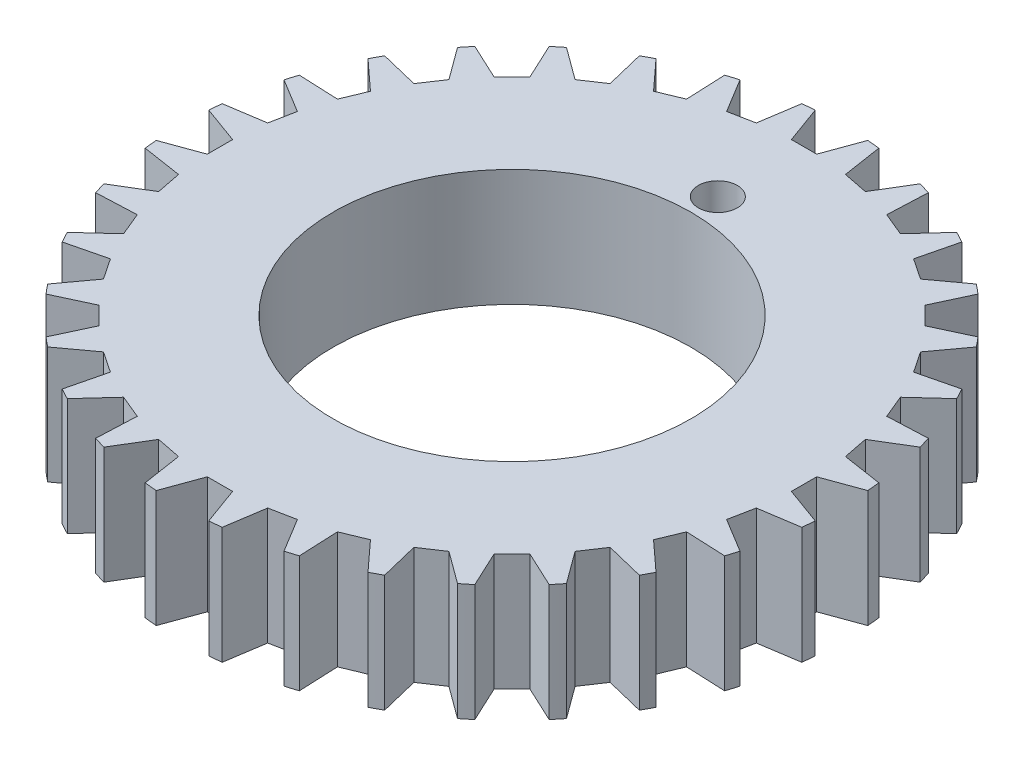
ISO-10303-21;
HEADER;
FILE_DESCRIPTION(('STEP AP214'),'2;1');
FILE_NAME('part.step','',(''),(''),'','','');
FILE_SCHEMA(('AUTOMOTIVE_DESIGN { 1 0 10303 214 1 1 1 1 }'));
ENDSEC;
DATA;
#1=APPLICATION_CONTEXT('core data for automotive mechanical design processes');
#2=APPLICATION_PROTOCOL_DEFINITION('international standard','automotive_design',2000,#1);
#3=PRODUCT_CONTEXT('',#1,'mechanical');
#4=PRODUCT('Part','Part','',(#3));
#5=PRODUCT_RELATED_PRODUCT_CATEGORY('part','',(#4));
#6=PRODUCT_DEFINITION_FORMATION('','',#4);
#7=PRODUCT_DEFINITION_CONTEXT('part definition',#1,'design');
#8=PRODUCT_DEFINITION('design','',#6,#7);
#9=PRODUCT_DEFINITION_SHAPE('','',#8);
#10=(LENGTH_UNIT() NAMED_UNIT(*) SI_UNIT(.MILLI.,.METRE.));
#11=(NAMED_UNIT(*) PLANE_ANGLE_UNIT() SI_UNIT($,.RADIAN.));
#12=(NAMED_UNIT(*) SI_UNIT($,.STERADIAN.) SOLID_ANGLE_UNIT());
#13=UNCERTAINTY_MEASURE_WITH_UNIT(LENGTH_MEASURE(1.E-05),#10,'distance_accuracy_value','');
#14=(GEOMETRIC_REPRESENTATION_CONTEXT(3) GLOBAL_UNCERTAINTY_ASSIGNED_CONTEXT((#13)) GLOBAL_UNIT_ASSIGNED_CONTEXT((#10,
#11,#12)) REPRESENTATION_CONTEXT('',''));
#15=CARTESIAN_POINT('',(0.,0.,0.));
#16=DIRECTION('',(0.,0.,1.));
#17=DIRECTION('',(1.,0.,0.));
#18=AXIS2_PLACEMENT_3D('',#15,#16,#17);
#19=CARTESIAN_POINT('',(0.,4.7625,0.));
#20=DIRECTION('',(0.,1.,0.));
#21=DIRECTION('',(0.,0.,1.));
#22=AXIS2_PLACEMENT_3D('',#19,#20,#21);
#23=PLANE('',#22);
#24=CARTESIAN_POINT('',(0.,4.7625,-8.382));
#25=DIRECTION('',(0.,1.,0.));
#26=DIRECTION('',(0.,0.,1.));
#27=AXIS2_PLACEMENT_3D('',#24,#25,#26);
#28=CIRCLE('',#27,0.793749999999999);
#29=CARTESIAN_POINT('',(0.,4.7625,-7.58825));
#30=VERTEX_POINT('',#29);
#31=EDGE_CURVE('E2434',#30,#30,#28,.T.);
#32=ORIENTED_EDGE('',*,*,#31,.F.);
#33=EDGE_LOOP('',(#32));
#34=FACE_BOUND('',#33,.T.);
#35=CARTESIAN_POINT('',(0.,4.7625,0.));
#36=DIRECTION('',(0.,-1.,0.));
#37=DIRECTION('',(0.,0.,-1.));
#38=AXIS2_PLACEMENT_3D('',#35,#36,#37);
#39=CIRCLE('',#38,7.2898);
#40=CARTESIAN_POINT('',(0.,4.7625,-7.2898));
#41=VERTEX_POINT('',#40);
#42=EDGE_CURVE('E871',#41,#41,#39,.T.);
#43=ORIENTED_EDGE('',*,*,#42,.T.);
#44=EDGE_LOOP('',(#43));
#45=FACE_BOUND('',#44,.T.);
#46=DIRECTION('',(-0.195090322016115,0.,-0.980785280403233));
#47=VECTOR('',#46,1.);
#48=CARTESIAN_POINT('',(11.6650187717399,4.7625,-2.32031649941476));
#49=LINE('',#48,#47);
#50=CARTESIAN_POINT('',(11.7653634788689,4.7625,-1.81584959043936));
#51=VERTEX_POINT('',#50);
#52=CARTESIAN_POINT('',(11.5646740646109,4.7625,-2.82478340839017));
#53=VERTEX_POINT('',#52);
#54=EDGE_CURVE('E882',#51,#53,#49,.T.);
#55=ORIENTED_EDGE('',*,*,#54,.T.);
#56=DIRECTION('',(0.854911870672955,0.,-0.518773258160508));
#57=VECTOR('',#56,1.);
#58=CARTESIAN_POINT('',(1.85954418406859,4.7625,3.06443397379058));
#59=LINE('',#58,#57);
#60=CARTESIAN_POINT('',(12.9528874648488,4.7625,-3.66717197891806));
#61=VERTEX_POINT('',#60);
#62=EDGE_CURVE('E854',#53,#61,#59,.T.);
#63=ORIENTED_EDGE('',*,*,#62,.T.);
#64=CARTESIAN_POINT('',(0.,4.7625,0.));
#65=DIRECTION('',(0.,1.,0.));
#66=DIRECTION('',(0.,0.,1.));
#67=AXIS2_PLACEMENT_3D('',#64,#65,#66);
#68=CIRCLE('',#67,13.462);
#69=CARTESIAN_POINT('',(12.8073039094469,4.7625,-4.14709664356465));
#70=VERTEX_POINT('',#69);
#71=EDGE_CURVE('E73',#61,#70,#68,.T.);
#72=ORIENTED_EDGE('',*,*,#71,.T.);
#73=DIRECTION('',(-0.999048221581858,0.,0.043619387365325));
#74=VECTOR('',#73,1.);
#75=CARTESIAN_POINT('',(-0.156353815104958,4.7625,-3.58109112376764));
#76=LINE('',#75,#74);
#77=CARTESIAN_POINT('',(11.1850406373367,4.7625,-4.07626709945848));
#78=VERTEX_POINT('',#77);
#79=EDGE_CURVE('E896',#70,#78,#76,.T.);
#80=ORIENTED_EDGE('',*,*,#79,.T.);
#81=DIRECTION('',(-0.382683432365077,0.,-0.923879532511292));
#82=VECTOR('',#81,1.);
#83=CARTESIAN_POINT('',(10.9882074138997,4.7625,-4.55146453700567));
#84=LINE('',#83,#82);
#85=CARTESIAN_POINT('',(10.7913741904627,4.7625,-5.02666197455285));
#86=VERTEX_POINT('',#85);
#87=EDGE_CURVE('E901',#78,#86,#84,.T.);
#88=ORIENTED_EDGE('',*,*,#87,.T.);
#89=DIRECTION('',(0.737277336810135,0.,-0.675590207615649));
#90=VECTOR('',#89,1.);
#91=CARTESIAN_POINT('',(2.42165497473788,4.7625,2.64277266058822));
#92=LINE('',#91,#90);
#93=CARTESIAN_POINT('',(11.9885716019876,4.7625,-6.12369128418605));
#94=VERTEX_POINT('',#93);
#95=EDGE_CURVE('E898',#86,#94,#92,.T.);
#96=ORIENTED_EDGE('',*,*,#95,.T.);
#97=CARTESIAN_POINT('',(11.7521567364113,4.7625,-6.56599238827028));
#98=VERTEX_POINT('',#97);
#99=EDGE_CURVE('E1935',#94,#98,#68,.T.);
#100=ORIENTED_EDGE('',*,*,#99,.T.);
#101=DIRECTION('',(-0.971342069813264,0.,0.237685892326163));
#102=VECTOR('',#101,1.);
#103=CARTESIAN_POINT('',(-0.851985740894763,4.7625,-3.48177834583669));
#104=LINE('',#103,#102);
#105=CARTESIAN_POINT('',(10.1748829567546,4.7625,-6.18003594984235));
#106=VERTEX_POINT('',#105);
#107=EDGE_CURVE('E917',#98,#106,#104,.T.);
#108=ORIENTED_EDGE('',*,*,#107,.T.);
#109=DIRECTION('',(-0.555570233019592,0.,-0.831469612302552));
#110=VECTOR('',#109,1.);
#111=CARTESIAN_POINT('',(9.88912540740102,4.7625,-6.60770234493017));
#112=LINE('',#111,#110);
#113=CARTESIAN_POINT('',(9.60336785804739,4.7625,-7.03536874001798));
#114=VERTEX_POINT('',#113);
#115=EDGE_CURVE('E923',#106,#114,#112,.T.);
#116=ORIENTED_EDGE('',*,*,#115,.T.);
#117=DIRECTION('',(0.591309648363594,0.,-0.806444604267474));
#118=VECTOR('',#117,1.);
#119=CARTESIAN_POINT('',(2.89070292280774,4.7625,2.11955107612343));
#120=LINE('',#119,#118);
#121=CARTESIAN_POINT('',(10.5635416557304,4.7625,-8.34488056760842));
#122=VERTEX_POINT('',#121);
#123=EDGE_CURVE('E920',#114,#122,#120,.T.);
#124=ORIENTED_EDGE('',*,*,#123,.T.);
#125=CARTESIAN_POINT('',(10.2453807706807,4.7625,-8.73256072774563));
#126=VERTEX_POINT('',#125);
#127=EDGE_CURVE('E1939',#122,#126,#68,.T.);
#128=ORIENTED_EDGE('',*,*,#127,.T.);
#129=DIRECTION('',(-0.906307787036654,0.,0.422618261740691));
#130=VECTOR('',#129,1.);
#131=CARTESIAN_POINT('',(-1.51487633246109,4.7625,-3.24866277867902));
#132=LINE('',#131,#130);
#133=CARTESIAN_POINT('',(8.77371023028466,4.7625,-8.04630948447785));
#134=VERTEX_POINT('',#133);
#135=EDGE_CURVE('E939',#126,#134,#132,.T.);
#136=ORIENTED_EDGE('',*,*,#135,.T.);
#137=DIRECTION('',(-0.707106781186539,0.,-0.707106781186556));
#138=VECTOR('',#137,1.);
#139=CARTESIAN_POINT('',(8.41000985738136,4.7625,-8.41000985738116));
#140=LINE('',#139,#138);
#141=CARTESIAN_POINT('',(8.04630948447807,4.7625,-8.77371023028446));
#142=VERTEX_POINT('',#141);
#143=EDGE_CURVE('E945',#134,#142,#140,.T.);
#144=ORIENTED_EDGE('',*,*,#143,.T.);
#145=DIRECTION('',(0.422618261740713,0.,-0.906307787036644));
#146=VECTOR('',#145,1.);
#147=CARTESIAN_POINT('',(3.24866277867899,4.7625,1.51487633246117));
#148=LINE('',#147,#146);
#149=CARTESIAN_POINT('',(8.73256072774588,4.7625,-10.2453807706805));
#150=VERTEX_POINT('',#149);
#151=EDGE_CURVE('E942',#142,#150,#148,.T.);
#152=ORIENTED_EDGE('',*,*,#151,.T.);
#153=CARTESIAN_POINT('',(8.34488056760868,4.7625,-10.5635416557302));
#154=VERTEX_POINT('',#153);
#155=EDGE_CURVE('E1940',#150,#154,#68,.T.);
#156=ORIENTED_EDGE('',*,*,#155,.T.);
#157=DIRECTION('',(-0.806444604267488,0.,0.591309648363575));
#158=VECTOR('',#157,1.);
#159=CARTESIAN_POINT('',(-2.11955107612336,4.7625,-2.8907029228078));
#160=LINE('',#159,#158);
#161=CARTESIAN_POINT('',(7.03536874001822,4.7625,-9.60336785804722));
#162=VERTEX_POINT('',#161);
#163=EDGE_CURVE('E961',#154,#162,#160,.T.);
#164=ORIENTED_EDGE('',*,*,#163,.T.);
#165=DIRECTION('',(-0.831469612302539,0.,-0.555570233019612));
#166=VECTOR('',#165,1.);
#167=CARTESIAN_POINT('',(6.60770234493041,4.7625,-9.88912540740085));
#168=LINE('',#167,#166);
#169=CARTESIAN_POINT('',(6.1800359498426,4.7625,-10.1748829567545));
#170=VERTEX_POINT('',#169);
#171=EDGE_CURVE('E967',#162,#170,#168,.T.);
#172=ORIENTED_EDGE('',*,*,#171,.T.);
#173=DIRECTION('',(0.237685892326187,0.,-0.971342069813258));
#174=VECTOR('',#173,1.);
#175=CARTESIAN_POINT('',(3.48177834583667,4.7625,0.851985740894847));
#176=LINE('',#175,#174);
#177=CARTESIAN_POINT('',(6.56599238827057,4.7625,-11.7521567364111));
#178=VERTEX_POINT('',#177);
#179=EDGE_CURVE('E964',#170,#178,#176,.T.);
#180=ORIENTED_EDGE('',*,*,#179,.T.);
#181=CARTESIAN_POINT('',(6.12369128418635,4.7625,-11.9885716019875));
#182=VERTEX_POINT('',#181);
#183=EDGE_CURVE('E1943',#178,#182,#68,.T.);
#184=ORIENTED_EDGE('',*,*,#183,.T.);
#185=DIRECTION('',(-0.675590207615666,0.,0.737277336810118));
#186=VECTOR('',#185,1.);
#187=CARTESIAN_POINT('',(-2.64277266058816,4.7625,-2.42165497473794));
#188=LINE('',#187,#186);
#189=CARTESIAN_POINT('',(5.02666197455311,4.7625,-10.7913741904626));
#190=VERTEX_POINT('',#189);
#191=EDGE_CURVE('E983',#182,#190,#188,.T.);
#192=ORIENTED_EDGE('',*,*,#191,.T.);
#193=DIRECTION('',(-0.923879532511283,0.,-0.3826834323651));
#194=VECTOR('',#193,1.);
#195=CARTESIAN_POINT('',(4.55146453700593,4.7625,-10.9882074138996));
#196=LINE('',#195,#194);
#197=CARTESIAN_POINT('',(4.07626709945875,4.7625,-11.1850406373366));
#198=VERTEX_POINT('',#197);
#199=EDGE_CURVE('E989',#190,#198,#196,.T.);
#200=ORIENTED_EDGE('',*,*,#199,.T.);
#201=DIRECTION('',(0.0436193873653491,0.,-0.999048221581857));
#202=VECTOR('',#201,1.);
#203=CARTESIAN_POINT('',(3.58109112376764,4.7625,0.156353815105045));
#204=LINE('',#203,#202);
#205=CARTESIAN_POINT('',(4.14709664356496,4.7625,-12.8073039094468));
#206=VERTEX_POINT('',#205);
#207=EDGE_CURVE('E986',#198,#206,#204,.T.);
#208=ORIENTED_EDGE('',*,*,#207,.T.);
#209=CARTESIAN_POINT('',(3.66717197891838,4.7625,-12.9528874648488));
#210=VERTEX_POINT('',#209);
#211=EDGE_CURVE('E1946',#206,#210,#68,.T.);
#212=ORIENTED_EDGE('',*,*,#211,.T.);
#213=DIRECTION('',(-0.518773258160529,0.,0.854911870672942));
#214=VECTOR('',#213,1.);
#215=CARTESIAN_POINT('',(-3.06443397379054,4.7625,-1.85954418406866));
#216=LINE('',#215,#214);
#217=CARTESIAN_POINT('',(2.82478340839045,4.7625,-11.5646740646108));
#218=VERTEX_POINT('',#217);
#219=EDGE_CURVE('E1006',#210,#218,#216,.T.);
#220=ORIENTED_EDGE('',*,*,#219,.T.);
#221=DIRECTION('',(-0.980785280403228,0.,-0.195090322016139));
#222=VECTOR('',#221,1.);
#223=CARTESIAN_POINT('',(2.32031649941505,4.7625,-11.6650187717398));
#224=LINE('',#223,#222);
#225=CARTESIAN_POINT('',(1.81584959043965,4.7625,-11.7653634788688));
#226=VERTEX_POINT('',#225);
#227=EDGE_CURVE('E1012',#218,#226,#224,.T.);
#228=ORIENTED_EDGE('',*,*,#227,.T.);
#229=DIRECTION('',(-0.152123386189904,0.,-0.988361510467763));
#230=VECTOR('',#229,1.);
#231=CARTESIAN_POINT('',(3.54278457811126,4.7625,-0.545286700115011));
#232=LINE('',#231,#230);
#233=CARTESIAN_POINT('',(1.56883030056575,4.7625,-13.3702735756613));
#234=VERTEX_POINT('',#233);
#235=EDGE_CURVE('E1009',#226,#234,#232,.T.);
#236=ORIENTED_EDGE('',*,*,#235,.T.);
#237=CARTESIAN_POINT('',(1.06972531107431,4.7625,-13.4194311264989));
#238=VERTEX_POINT('',#237);
#239=EDGE_CURVE('E1949',#234,#238,#68,.T.);
#240=ORIENTED_EDGE('',*,*,#239,.T.);
#241=DIRECTION('',(-0.342020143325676,0.,0.939692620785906));
#242=VECTOR('',#241,1.);
#243=CARTESIAN_POINT('',(-3.36833080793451,4.7625,-1.22597215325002));
#244=LINE('',#243,#242);
#245=CARTESIAN_POINT('',(0.514350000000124,4.7625,-11.89355));
#246=VERTEX_POINT('',#245);
#247=EDGE_CURVE('E1030',#238,#246,#244,.T.);
#248=ORIENTED_EDGE('',*,*,#247,.T.);
#249=DIRECTION('',(-1.,0.,0.));
#250=VECTOR('',#249,1.);
#251=CARTESIAN_POINT('',(1.24578323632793E-13,4.7625,-11.89355));
#252=LINE('',#251,#250);
#253=CARTESIAN_POINT('',(-0.514349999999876,4.7625,-11.89355));
#254=VERTEX_POINT('',#253);
#255=EDGE_CURVE('E1036',#246,#254,#252,.T.);
#256=ORIENTED_EDGE('',*,*,#255,.T.);
#257=DIRECTION('',(-0.342020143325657,0.,-0.939692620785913));
#258=VECTOR('',#257,1.);
#259=CARTESIAN_POINT('',(3.36833080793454,4.7625,-1.22597215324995));
#260=LINE('',#259,#258);
#261=CARTESIAN_POINT('',(-1.06972531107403,4.7625,-13.4194311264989));
#262=VERTEX_POINT('',#261);
#263=EDGE_CURVE('E1033',#254,#262,#260,.T.);
#264=ORIENTED_EDGE('',*,*,#263,.T.);
#265=CARTESIAN_POINT('',(-1.56883030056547,4.7625,-13.3702735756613));
#266=VERTEX_POINT('',#265);
#267=EDGE_CURVE('E1952',#262,#266,#68,.T.);
#268=ORIENTED_EDGE('',*,*,#267,.T.);
#269=DIRECTION('',(-0.152123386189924,0.,0.98836151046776));
#270=VECTOR('',#269,1.);
#271=CARTESIAN_POINT('',(-3.54278457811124,4.7625,-0.545286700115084));
#272=LINE('',#271,#270);
#273=CARTESIAN_POINT('',(-1.8158495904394,4.7625,-11.7653634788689));
#274=VERTEX_POINT('',#273);
#275=EDGE_CURVE('E1053',#266,#274,#272,.T.);
#276=ORIENTED_EDGE('',*,*,#275,.T.);
#277=DIRECTION('',(-0.980785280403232,0.,0.195090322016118));
#278=VECTOR('',#277,1.);
#279=CARTESIAN_POINT('',(-2.3203164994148,4.7625,-11.6650187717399));
#280=LINE('',#279,#278);
#281=CARTESIAN_POINT('',(-2.82478340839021,4.7625,-11.5646740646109));
#282=VERTEX_POINT('',#281);
#283=EDGE_CURVE('E1059',#274,#282,#280,.T.);
#284=ORIENTED_EDGE('',*,*,#283,.T.);
#285=DIRECTION('',(-0.518773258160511,0.,-0.854911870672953));
#286=VECTOR('',#285,1.);
#287=CARTESIAN_POINT('',(3.06443397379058,4.7625,-1.8595441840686));
#288=LINE('',#287,#286);
#289=CARTESIAN_POINT('',(-3.66717197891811,4.7625,-12.9528874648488));
#290=VERTEX_POINT('',#289);
#291=EDGE_CURVE('E1056',#282,#290,#288,.T.);
#292=ORIENTED_EDGE('',*,*,#291,.T.);
#293=CARTESIAN_POINT('',(-4.14709664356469,4.7625,-12.8073039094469));
#294=VERTEX_POINT('',#293);
#295=EDGE_CURVE('E1955',#290,#294,#68,.T.);
#296=ORIENTED_EDGE('',*,*,#295,.T.);
#297=DIRECTION('',(0.0436193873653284,0.,0.999048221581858));
#298=VECTOR('',#297,1.);
#299=CARTESIAN_POINT('',(-3.58109112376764,4.7625,0.156353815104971));
#300=LINE('',#299,#298);
#301=CARTESIAN_POINT('',(-4.07626709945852,4.7625,-11.1850406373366));
#302=VERTEX_POINT('',#301);
#303=EDGE_CURVE('E1075',#294,#302,#300,.T.);
#304=ORIENTED_EDGE('',*,*,#303,.T.);
#305=DIRECTION('',(-0.923879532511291,0.,0.382683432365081));
#306=VECTOR('',#305,1.);
#307=CARTESIAN_POINT('',(-4.5514645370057,4.7625,-10.9882074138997));
#308=LINE('',#307,#306);
#309=CARTESIAN_POINT('',(-5.02666197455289,4.7625,-10.7913741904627));
#310=VERTEX_POINT('',#309);
#311=EDGE_CURVE('E1081',#302,#310,#308,.T.);
#312=ORIENTED_EDGE('',*,*,#311,.T.);
#313=DIRECTION('',(-0.675590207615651,0.,-0.737277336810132));
#314=VECTOR('',#313,1.);
#315=CARTESIAN_POINT('',(2.64277266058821,4.7625,-2.42165497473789));
#316=LINE('',#315,#314);
#317=CARTESIAN_POINT('',(-6.1236912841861,4.7625,-11.9885716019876));
#318=VERTEX_POINT('',#317);
#319=EDGE_CURVE('E1078',#310,#318,#316,.T.);
#320=ORIENTED_EDGE('',*,*,#319,.T.);
#321=CARTESIAN_POINT('',(-6.56599238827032,4.7625,-11.7521567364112));
#322=VERTEX_POINT('',#321);
#323=EDGE_CURVE('E1958',#318,#322,#68,.T.);
#324=ORIENTED_EDGE('',*,*,#323,.T.);
#325=DIRECTION('',(0.237685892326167,0.,0.971342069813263));
#326=VECTOR('',#325,1.);
#327=CARTESIAN_POINT('',(-3.48177834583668,4.7625,0.851985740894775));
#328=LINE('',#327,#326);
#329=CARTESIAN_POINT('',(-6.18003594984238,4.7625,-10.1748829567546));
#330=VERTEX_POINT('',#329);
#331=EDGE_CURVE('E1097',#322,#330,#328,.T.);
#332=ORIENTED_EDGE('',*,*,#331,.T.);
#333=DIRECTION('',(-0.83146961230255,0.,0.555570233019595));
#334=VECTOR('',#333,1.);
#335=CARTESIAN_POINT('',(-6.6077023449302,4.7625,-9.88912540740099));
#336=LINE('',#335,#334);
#337=CARTESIAN_POINT('',(-7.03536874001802,4.7625,-9.60336785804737));
#338=VERTEX_POINT('',#337);
#339=EDGE_CURVE('E1103',#330,#338,#336,.T.);
#340=ORIENTED_EDGE('',*,*,#339,.T.);
#341=DIRECTION('',(-0.806444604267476,0.,-0.591309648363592));
#342=VECTOR('',#341,1.);
#343=CARTESIAN_POINT('',(2.11955107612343,4.7625,-2.89070292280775));
#344=LINE('',#343,#342);
#345=CARTESIAN_POINT('',(-8.34488056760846,4.7625,-10.5635416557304));
#346=VERTEX_POINT('',#345);
#347=EDGE_CURVE('E1100',#338,#346,#344,.T.);
#348=ORIENTED_EDGE('',*,*,#347,.T.);
#349=CARTESIAN_POINT('',(-8.73256072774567,4.7625,-10.2453807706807));
#350=VERTEX_POINT('',#349);
#351=EDGE_CURVE('E1961',#346,#350,#68,.T.);
#352=ORIENTED_EDGE('',*,*,#351,.T.);
#353=DIRECTION('',(0.422618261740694,0.,0.906307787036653));
#354=VECTOR('',#353,1.);
#355=CARTESIAN_POINT('',(-3.24866277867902,4.7625,1.5148763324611));
#356=LINE('',#355,#354);
#357=CARTESIAN_POINT('',(-8.04630948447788,4.7625,-8.77371023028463));
#358=VERTEX_POINT('',#357);
#359=EDGE_CURVE('E1119',#350,#358,#356,.T.);
#360=ORIENTED_EDGE('',*,*,#359,.T.);
#361=DIRECTION('',(-0.707106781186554,0.,0.707106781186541));
#362=VECTOR('',#361,1.);
#363=CARTESIAN_POINT('',(-8.41000985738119,4.7625,-8.41000985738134));
#364=LINE('',#363,#362);
#365=CARTESIAN_POINT('',(-8.77371023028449,4.7625,-8.04630948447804));
#366=VERTEX_POINT('',#365);
#367=EDGE_CURVE('E1125',#358,#366,#364,.T.);
#368=ORIENTED_EDGE('',*,*,#367,.T.);
#369=DIRECTION('',(-0.906307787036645,0.,-0.422618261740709));
#370=VECTOR('',#369,1.);
#371=CARTESIAN_POINT('',(1.51487633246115,4.7625,-3.24866277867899));
#372=LINE('',#371,#370);
#373=CARTESIAN_POINT('',(-10.2453807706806,4.7625,-8.73256072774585));
#374=VERTEX_POINT('',#373);
#375=EDGE_CURVE('E1122',#366,#374,#372,.T.);
#376=ORIENTED_EDGE('',*,*,#375,.T.);
#377=CARTESIAN_POINT('',(-10.5635416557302,4.7625,-8.34488056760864));
#378=VERTEX_POINT('',#377);
#379=EDGE_CURVE('E1964',#374,#378,#68,.T.);
#380=ORIENTED_EDGE('',*,*,#379,.T.);
#381=DIRECTION('',(0.591309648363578,0.,0.806444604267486));
#382=VECTOR('',#381,1.);
#383=CARTESIAN_POINT('',(-2.89070292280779,4.7625,2.11955107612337));
#384=LINE('',#383,#382);
#385=CARTESIAN_POINT('',(-9.60336785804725,4.7625,-7.03536874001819));
#386=VERTEX_POINT('',#385);
#387=EDGE_CURVE('E1141',#378,#386,#384,.T.);
#388=ORIENTED_EDGE('',*,*,#387,.T.);
#389=DIRECTION('',(-0.555570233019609,0.,0.831469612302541));
#390=VECTOR('',#389,1.);
#391=CARTESIAN_POINT('',(-9.88912540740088,4.7625,-6.60770234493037));
#392=LINE('',#391,#390);
#393=CARTESIAN_POINT('',(-10.1748829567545,4.7625,-6.18003594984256));
#394=VERTEX_POINT('',#393);
#395=EDGE_CURVE('E1147',#386,#394,#392,.T.);
#396=ORIENTED_EDGE('',*,*,#395,.T.);
#397=DIRECTION('',(-0.971342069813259,0.,-0.237685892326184));
#398=VECTOR('',#397,1.);
#399=CARTESIAN_POINT('',(0.851985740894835,4.7625,-3.48177834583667));
#400=LINE('',#399,#398);
#401=CARTESIAN_POINT('',(-11.7521567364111,4.7625,-6.56599238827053));
#402=VERTEX_POINT('',#401);
#403=EDGE_CURVE('E1144',#394,#402,#400,.T.);
#404=ORIENTED_EDGE('',*,*,#403,.T.);
#405=CARTESIAN_POINT('',(-11.9885716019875,4.7625,-6.12369128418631));
#406=VERTEX_POINT('',#405);
#407=EDGE_CURVE('E1967',#402,#406,#68,.T.);
#408=ORIENTED_EDGE('',*,*,#407,.T.);
#409=DIRECTION('',(0.737277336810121,0.,0.675590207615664));
#410=VECTOR('',#409,1.);
#411=CARTESIAN_POINT('',(-2.42165497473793,4.7625,2.64277266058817));
#412=LINE('',#411,#410);
#413=CARTESIAN_POINT('',(-10.7913741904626,4.7625,-5.02666197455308));
#414=VERTEX_POINT('',#413);
#415=EDGE_CURVE('E1163',#406,#414,#412,.T.);
#416=ORIENTED_EDGE('',*,*,#415,.T.);
#417=DIRECTION('',(-0.382683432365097,0.,0.923879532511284));
#418=VECTOR('',#417,1.);
#419=CARTESIAN_POINT('',(-10.9882074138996,4.7625,-4.5514645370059));
#420=LINE('',#419,#418);
#421=CARTESIAN_POINT('',(-11.1850406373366,4.7625,-4.07626709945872));
#422=VERTEX_POINT('',#421);
#423=EDGE_CURVE('E1169',#414,#422,#420,.T.);
#424=ORIENTED_EDGE('',*,*,#423,.T.);
#425=DIRECTION('',(-0.999048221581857,0.,-0.0436193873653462));
#426=VECTOR('',#425,1.);
#427=CARTESIAN_POINT('',(0.156353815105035,4.7625,-3.58109112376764));
#428=LINE('',#427,#426);
#429=CARTESIAN_POINT('',(-12.8073039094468,4.7625,-4.14709664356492));
#430=VERTEX_POINT('',#429);
#431=EDGE_CURVE('E1166',#422,#430,#428,.T.);
#432=ORIENTED_EDGE('',*,*,#431,.T.);
#433=CARTESIAN_POINT('',(-12.9528874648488,4.7625,-3.66717197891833));
#434=VERTEX_POINT('',#433);
#435=EDGE_CURVE('E1970',#430,#434,#68,.T.);
#436=ORIENTED_EDGE('',*,*,#435,.T.);
#437=DIRECTION('',(0.854911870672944,0.,0.518773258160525));
#438=VECTOR('',#437,1.);
#439=CARTESIAN_POINT('',(-1.85954418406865,4.7625,3.06443397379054));
#440=LINE('',#439,#438);
#441=CARTESIAN_POINT('',(-11.5646740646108,4.7625,-2.82478340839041));
#442=VERTEX_POINT('',#441);
#443=EDGE_CURVE('E1185',#434,#442,#440,.T.);
#444=ORIENTED_EDGE('',*,*,#443,.T.);
#445=DIRECTION('',(-0.195090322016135,0.,0.980785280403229));
#446=VECTOR('',#445,1.);
#447=CARTESIAN_POINT('',(-11.6650187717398,4.7625,-2.32031649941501));
#448=LINE('',#447,#446);
#449=CARTESIAN_POINT('',(-11.7653634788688,4.7625,-1.81584959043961));
#450=VERTEX_POINT('',#449);
#451=EDGE_CURVE('E1191',#442,#450,#448,.T.);
#452=ORIENTED_EDGE('',*,*,#451,.T.);
#453=DIRECTION('',(-0.988361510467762,0.,0.152123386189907));
#454=VECTOR('',#453,1.);
#455=CARTESIAN_POINT('',(-0.545286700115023,4.7625,-3.54278457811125));
#456=LINE('',#455,#454);
#457=CARTESIAN_POINT('',(-13.3702735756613,4.7625,-1.5688303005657));
#458=VERTEX_POINT('',#457);
#459=EDGE_CURVE('E1188',#450,#458,#456,.T.);
#460=ORIENTED_EDGE('',*,*,#459,.T.);
#461=CARTESIAN_POINT('',(-13.4194311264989,4.7625,-1.06972531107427));
#462=VERTEX_POINT('',#461);
#463=EDGE_CURVE('E1973',#458,#462,#68,.T.);
#464=ORIENTED_EDGE('',*,*,#463,.T.);
#465=DIRECTION('',(0.939692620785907,0.,0.342020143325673));
#466=VECTOR('',#465,1.);
#467=CARTESIAN_POINT('',(-1.22597215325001,4.7625,3.36833080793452));
#468=LINE('',#467,#466);
#469=CARTESIAN_POINT('',(-11.89355,4.7625,-0.514350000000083));
#470=VERTEX_POINT('',#469);
#471=EDGE_CURVE('E1207',#462,#470,#468,.T.);
#472=ORIENTED_EDGE('',*,*,#471,.T.);
#473=DIRECTION('',(0.,0.,1.));
#474=VECTOR('',#473,1.);
#475=CARTESIAN_POINT('',(-11.89355,4.7625,0.));
#476=LINE('',#475,#474);
#477=CARTESIAN_POINT('',(-11.89355,4.7625,0.514349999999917));
#478=VERTEX_POINT('',#477);
#479=EDGE_CURVE('E1213',#470,#478,#476,.T.);
#480=ORIENTED_EDGE('',*,*,#479,.T.);
#481=DIRECTION('',(-0.939692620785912,0.,0.34202014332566));
#482=VECTOR('',#481,1.);
#483=CARTESIAN_POINT('',(-1.22597215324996,4.7625,-3.36833080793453));
#484=LINE('',#483,#482);
#485=CARTESIAN_POINT('',(-13.4194311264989,4.7625,1.06972531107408));
#486=VERTEX_POINT('',#485);
#487=EDGE_CURVE('E1210',#478,#486,#484,.T.);
#488=ORIENTED_EDGE('',*,*,#487,.T.);
#489=CARTESIAN_POINT('',(-13.3702735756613,4.7625,1.56883030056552));
#490=VERTEX_POINT('',#489);
#491=EDGE_CURVE('E1976',#486,#490,#68,.T.);
#492=ORIENTED_EDGE('',*,*,#491,.T.);
#493=DIRECTION('',(0.98836151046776,0.,0.152123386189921));
#494=VECTOR('',#493,1.);
#495=CARTESIAN_POINT('',(-0.545286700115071,4.7625,3.54278457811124));
#496=LINE('',#495,#494);
#497=CARTESIAN_POINT('',(-11.7653634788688,4.7625,1.81584959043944));
#498=VERTEX_POINT('',#497);
#499=EDGE_CURVE('E1229',#490,#498,#496,.T.);
#500=ORIENTED_EDGE('',*,*,#499,.T.);
#501=DIRECTION('',(0.195090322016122,0.,0.980785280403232));
#502=VECTOR('',#501,1.);
#503=CARTESIAN_POINT('',(-11.6650187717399,4.7625,2.32031649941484));
#504=LINE('',#503,#502);
#505=CARTESIAN_POINT('',(-11.5646740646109,4.7625,2.82478340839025));
#506=VERTEX_POINT('',#505);
#507=EDGE_CURVE('E1235',#498,#506,#504,.T.);
#508=ORIENTED_EDGE('',*,*,#507,.T.);
#509=DIRECTION('',(-0.854911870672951,0.,0.518773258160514));
#510=VECTOR('',#509,1.);
#511=CARTESIAN_POINT('',(-1.85954418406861,4.7625,-3.06443397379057));
#512=LINE('',#511,#510);
#513=CARTESIAN_POINT('',(-12.9528874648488,4.7625,3.66717197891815));
#514=VERTEX_POINT('',#513);
#515=EDGE_CURVE('E1232',#506,#514,#512,.T.);
#516=ORIENTED_EDGE('',*,*,#515,.T.);
#517=CARTESIAN_POINT('',(-12.8073039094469,4.7625,4.14709664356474));
#518=VERTEX_POINT('',#517);
#519=EDGE_CURVE('E1979',#514,#518,#68,.T.);
#520=ORIENTED_EDGE('',*,*,#519,.T.);
#521=DIRECTION('',(0.999048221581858,0.,-0.0436193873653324));
#522=VECTOR('',#521,1.);
#523=CARTESIAN_POINT('',(0.156353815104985,4.7625,3.58109112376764));
#524=LINE('',#523,#522);
#525=CARTESIAN_POINT('',(-11.1850406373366,4.7625,4.07626709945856));
#526=VERTEX_POINT('',#525);
#527=EDGE_CURVE('E1251',#518,#526,#524,.T.);
#528=ORIENTED_EDGE('',*,*,#527,.T.);
#529=DIRECTION('',(0.382683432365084,0.,0.923879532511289));
#530=VECTOR('',#529,1.);
#531=CARTESIAN_POINT('',(-10.9882074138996,4.7625,4.55146453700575));
#532=LINE('',#531,#530);
#533=CARTESIAN_POINT('',(-10.7913741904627,4.7625,5.02666197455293));
#534=VERTEX_POINT('',#533);
#535=EDGE_CURVE('E1257',#526,#534,#532,.T.);
#536=ORIENTED_EDGE('',*,*,#535,.T.);
#537=DIRECTION('',(-0.73727733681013,0.,0.675590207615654));
#538=VECTOR('',#537,1.);
#539=CARTESIAN_POINT('',(-2.4216549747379,4.7625,-2.6427726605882));
#540=LINE('',#539,#538);
#541=CARTESIAN_POINT('',(-11.9885716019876,4.7625,6.12369128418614));
#542=VERTEX_POINT('',#541);
#543=EDGE_CURVE('E1254',#534,#542,#540,.T.);
#544=ORIENTED_EDGE('',*,*,#543,.T.);
#545=CARTESIAN_POINT('',(-11.7521567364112,4.7625,6.56599238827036));
#546=VERTEX_POINT('',#545);
#547=EDGE_CURVE('E1982',#542,#546,#68,.T.);
#548=ORIENTED_EDGE('',*,*,#547,.T.);
#549=DIRECTION('',(0.971342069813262,0.,-0.23768589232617));
#550=VECTOR('',#549,1.);
#551=CARTESIAN_POINT('',(0.851985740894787,4.7625,3.48177834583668));
#552=LINE('',#551,#550);
#553=CARTESIAN_POINT('',(-10.1748829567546,4.7625,6.18003594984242));
#554=VERTEX_POINT('',#553);
#555=EDGE_CURVE('E1273',#546,#554,#552,.T.);
#556=ORIENTED_EDGE('',*,*,#555,.T.);
#557=DIRECTION('',(0.555570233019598,0.,0.831469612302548));
#558=VECTOR('',#557,1.);
#559=CARTESIAN_POINT('',(-9.88912540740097,4.7625,6.60770234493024));
#560=LINE('',#559,#558);
#561=CARTESIAN_POINT('',(-9.60336785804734,4.7625,7.03536874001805));
#562=VERTEX_POINT('',#561);
#563=EDGE_CURVE('E1279',#554,#562,#560,.T.);
#564=ORIENTED_EDGE('',*,*,#563,.T.);
#565=DIRECTION('',(-0.591309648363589,0.,0.806444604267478));
#566=VECTOR('',#565,1.);
#567=CARTESIAN_POINT('',(-2.89070292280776,4.7625,-2.11955107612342));
#568=LINE('',#567,#566);
#569=CARTESIAN_POINT('',(-10.5635416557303,4.7625,8.34488056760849));
#570=VERTEX_POINT('',#569);
#571=EDGE_CURVE('E1276',#562,#570,#568,.T.);
#572=ORIENTED_EDGE('',*,*,#571,.T.);
#573=CARTESIAN_POINT('',(-10.2453807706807,4.7625,8.7325607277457));
#574=VERTEX_POINT('',#573);
#575=EDGE_CURVE('E1985',#570,#574,#68,.T.);
#576=ORIENTED_EDGE('',*,*,#575,.T.);
#577=DIRECTION('',(0.906307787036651,0.,-0.422618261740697));
#578=VECTOR('',#577,1.);
#579=CARTESIAN_POINT('',(1.51487633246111,4.7625,3.24866277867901));
#580=LINE('',#579,#578);
#581=CARTESIAN_POINT('',(-8.77371023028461,4.7625,8.04630948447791));
#582=VERTEX_POINT('',#581);
#583=EDGE_CURVE('E1295',#574,#582,#580,.T.);
#584=ORIENTED_EDGE('',*,*,#583,.T.);
#585=DIRECTION('',(0.707106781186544,0.,0.707106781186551));
#586=VECTOR('',#585,1.);
#587=CARTESIAN_POINT('',(-8.41000985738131,4.7625,8.41000985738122));
#588=LINE('',#587,#586);
#589=CARTESIAN_POINT('',(-8.04630948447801,4.7625,8.77371023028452));
#590=VERTEX_POINT('',#589);
#591=EDGE_CURVE('E1301',#582,#590,#588,.T.);
#592=ORIENTED_EDGE('',*,*,#591,.T.);
#593=DIRECTION('',(-0.422618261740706,0.,0.906307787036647));
#594=VECTOR('',#593,1.);
#595=CARTESIAN_POINT('',(-3.248662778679,4.7625,-1.51487633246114));
#596=LINE('',#595,#594);
#597=CARTESIAN_POINT('',(-8.73256072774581,4.7625,10.2453807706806));
#598=VERTEX_POINT('',#597);
#599=EDGE_CURVE('E1298',#590,#598,#596,.T.);
#600=ORIENTED_EDGE('',*,*,#599,.T.);
#601=CARTESIAN_POINT('',(-8.34488056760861,4.7625,10.5635416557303));
#602=VERTEX_POINT('',#601);
#603=EDGE_CURVE('E1988',#598,#602,#68,.T.);
#604=ORIENTED_EDGE('',*,*,#603,.T.);
#605=DIRECTION('',(0.806444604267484,0.,-0.59130964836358));
#606=VECTOR('',#605,1.);
#607=CARTESIAN_POINT('',(2.11955107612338,4.7625,2.89070292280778));
#608=LINE('',#607,#606);
#609=CARTESIAN_POINT('',(-7.03536874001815,4.7625,9.60336785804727));
#610=VERTEX_POINT('',#609);
#611=EDGE_CURVE('E1318',#602,#610,#608,.T.);
#612=ORIENTED_EDGE('',*,*,#611,.T.);
#613=DIRECTION('',(0.831469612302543,0.,0.555570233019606));
#614=VECTOR('',#613,1.);
#615=CARTESIAN_POINT('',(-6.60770234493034,4.7625,9.8891254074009));
#616=LINE('',#615,#614);
#617=CARTESIAN_POINT('',(-6.18003594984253,4.7625,10.1748829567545));
#618=VERTEX_POINT('',#617);
#619=EDGE_CURVE('E1324',#610,#618,#616,.T.);
#620=ORIENTED_EDGE('',*,*,#619,.T.);
#621=DIRECTION('',(-0.23768589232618,0.,0.97134206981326));
#622=VECTOR('',#621,1.);
#623=CARTESIAN_POINT('',(-3.48177834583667,4.7625,-0.851985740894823));
#624=LINE('',#623,#622);
#625=CARTESIAN_POINT('',(-6.56599238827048,4.7625,11.7521567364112));
#626=VERTEX_POINT('',#625);
#627=EDGE_CURVE('E1321',#618,#626,#624,.T.);
#628=ORIENTED_EDGE('',*,*,#627,.T.);
#629=CARTESIAN_POINT('',(-6.12369128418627,4.7625,11.9885716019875));
#630=VERTEX_POINT('',#629);
#631=EDGE_CURVE('E1991',#626,#630,#68,.T.);
#632=ORIENTED_EDGE('',*,*,#631,.T.);
#633=DIRECTION('',(0.675590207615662,0.,-0.737277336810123));
#634=VECTOR('',#633,1.);
#635=CARTESIAN_POINT('',(2.64277266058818,4.7625,2.42165497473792));
#636=LINE('',#635,#634);
#637=CARTESIAN_POINT('',(-5.02666197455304,4.7625,10.7913741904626));
#638=VERTEX_POINT('',#637);
#639=EDGE_CURVE('E1342',#630,#638,#636,.T.);
#640=ORIENTED_EDGE('',*,*,#639,.T.);
#641=DIRECTION('',(0.923879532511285,0.,0.382683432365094));
#642=VECTOR('',#641,1.);
#643=CARTESIAN_POINT('',(-4.55146453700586,4.7625,10.9882074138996));
#644=LINE('',#643,#642);
#645=CARTESIAN_POINT('',(-4.07626709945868,4.7625,11.1850406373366));
#646=VERTEX_POINT('',#645);
#647=EDGE_CURVE('E1348',#638,#646,#644,.T.);
#648=ORIENTED_EDGE('',*,*,#647,.T.);
#649=DIRECTION('',(-0.0436193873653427,0.,0.999048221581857));
#650=VECTOR('',#649,1.);
#651=CARTESIAN_POINT('',(-3.58109112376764,4.7625,-0.156353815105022));
#652=LINE('',#651,#650);
#653=CARTESIAN_POINT('',(-4.14709664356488,4.7625,12.8073039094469));
#654=VERTEX_POINT('',#653);
#655=EDGE_CURVE('E1345',#646,#654,#652,.T.);
#656=ORIENTED_EDGE('',*,*,#655,.T.);
#657=CARTESIAN_POINT('',(-3.66717197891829,4.7625,12.9528874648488));
#658=VERTEX_POINT('',#657);
#659=EDGE_CURVE('E1994',#654,#658,#68,.T.);
#660=ORIENTED_EDGE('',*,*,#659,.T.);
#661=DIRECTION('',(0.518773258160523,0.,-0.854911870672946));
#662=VECTOR('',#661,1.);
#663=CARTESIAN_POINT('',(3.06443397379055,4.7625,1.85954418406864));
#664=LINE('',#663,#662);
#665=CARTESIAN_POINT('',(-2.82478340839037,4.7625,11.5646740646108));
#666=VERTEX_POINT('',#665);
#667=EDGE_CURVE('E1365',#658,#666,#664,.T.);
#668=ORIENTED_EDGE('',*,*,#667,.T.);
#669=DIRECTION('',(0.98078528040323,0.,0.195090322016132));
#670=VECTOR('',#669,1.);
#671=CARTESIAN_POINT('',(-2.32031649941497,4.7625,11.6650187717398));
#672=LINE('',#671,#670);
#673=CARTESIAN_POINT('',(-1.81584959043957,4.7625,11.7653634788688));
#674=VERTEX_POINT('',#673);
#675=EDGE_CURVE('E1371',#666,#674,#672,.T.);
#676=ORIENTED_EDGE('',*,*,#675,.T.);
#677=DIRECTION('',(0.152123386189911,0.,0.988361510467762));
#678=VECTOR('',#677,1.);
#679=CARTESIAN_POINT('',(-3.54278457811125,4.7625,0.545286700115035));
#680=LINE('',#679,#678);
#681=CARTESIAN_POINT('',(-1.56883030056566,4.7625,13.3702735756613));
#682=VERTEX_POINT('',#681);
#683=EDGE_CURVE('E1368',#674,#682,#680,.T.);
#684=ORIENTED_EDGE('',*,*,#683,.T.);
#685=CARTESIAN_POINT('',(-1.06972531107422,4.7625,13.4194311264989));
#686=VERTEX_POINT('',#685);
#687=EDGE_CURVE('E1997',#682,#686,#68,.T.);
#688=ORIENTED_EDGE('',*,*,#687,.T.);
#689=DIRECTION('',(0.34202014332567,0.,-0.939692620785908));
#690=VECTOR('',#689,1.);
#691=CARTESIAN_POINT('',(3.36833080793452,4.7625,1.22597215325));
#692=LINE('',#691,#690);
#693=CARTESIAN_POINT('',(-0.514350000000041,4.7625,11.89355));
#694=VERTEX_POINT('',#693);
#695=EDGE_CURVE('E1387',#686,#694,#692,.T.);
#696=ORIENTED_EDGE('',*,*,#695,.T.);
#697=DIRECTION('',(1.,0.,0.));
#698=VECTOR('',#697,1.);
#699=CARTESIAN_POINT('',(0.,4.7625,11.89355));
#700=LINE('',#699,#698);
#701=CARTESIAN_POINT('',(0.514349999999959,4.7625,11.89355));
#702=VERTEX_POINT('',#701);
#703=EDGE_CURVE('E1393',#694,#702,#700,.T.);
#704=ORIENTED_EDGE('',*,*,#703,.T.);
#705=DIRECTION('',(0.342020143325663,0.,0.939692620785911));
#706=VECTOR('',#705,1.);
#707=CARTESIAN_POINT('',(-3.36833080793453,4.7625,1.22597215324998));
#708=LINE('',#707,#706);
#709=CARTESIAN_POINT('',(1.06972531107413,4.7625,13.4194311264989));
#710=VERTEX_POINT('',#709);
#711=EDGE_CURVE('E1390',#702,#710,#708,.T.);
#712=ORIENTED_EDGE('',*,*,#711,.T.);
#713=CARTESIAN_POINT('',(1.56883030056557,4.7625,13.3702735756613));
#714=VERTEX_POINT('',#713);
#715=EDGE_CURVE('E2000',#710,#714,#68,.T.);
#716=ORIENTED_EDGE('',*,*,#715,.T.);
#717=DIRECTION('',(0.152123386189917,0.,-0.988361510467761));
#718=VECTOR('',#717,1.);
#719=CARTESIAN_POINT('',(3.54278457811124,4.7625,0.545286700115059));
#720=LINE('',#719,#718);
#721=CARTESIAN_POINT('',(1.81584959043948,4.7625,11.7653634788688));
#722=VERTEX_POINT('',#721);
#723=EDGE_CURVE('E1409',#714,#722,#720,.T.);
#724=ORIENTED_EDGE('',*,*,#723,.T.);
#725=DIRECTION('',(0.980785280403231,0.,-0.195090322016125));
#726=VECTOR('',#725,1.);
#727=CARTESIAN_POINT('',(2.32031649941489,4.7625,11.6650187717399));
#728=LINE('',#727,#726);
#729=CARTESIAN_POINT('',(2.82478340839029,4.7625,11.5646740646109));
#730=VERTEX_POINT('',#729);
#731=EDGE_CURVE('E1415',#722,#730,#728,.T.);
#732=ORIENTED_EDGE('',*,*,#731,.T.);
#733=DIRECTION('',(0.518773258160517,0.,0.854911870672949));
#734=VECTOR('',#733,1.);
#735=CARTESIAN_POINT('',(-3.06443397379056,4.7625,1.85954418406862));
#736=LINE('',#735,#734);
#737=CARTESIAN_POINT('',(3.6671719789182,4.7625,12.9528874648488));
#738=VERTEX_POINT('',#737);
#739=EDGE_CURVE('E1412',#730,#738,#736,.T.);
#740=ORIENTED_EDGE('',*,*,#739,.T.);
#741=CARTESIAN_POINT('',(4.14709664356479,4.7625,12.8073039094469));
#742=VERTEX_POINT('',#741);
#743=EDGE_CURVE('E2003',#738,#742,#68,.T.);
#744=ORIENTED_EDGE('',*,*,#743,.T.);
#745=DIRECTION('',(-0.0436193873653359,0.,-0.999048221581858));
#746=VECTOR('',#745,1.);
#747=CARTESIAN_POINT('',(3.58109112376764,4.7625,-0.156353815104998));
#748=LINE('',#747,#746);
#749=CARTESIAN_POINT('',(4.0762670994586,4.7625,11.1850406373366));
#750=VERTEX_POINT('',#749);
#751=EDGE_CURVE('E1431',#742,#750,#748,.T.);
#752=ORIENTED_EDGE('',*,*,#751,.T.);
#753=DIRECTION('',(0.923879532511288,0.,-0.382683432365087));
#754=VECTOR('',#753,1.);
#755=CARTESIAN_POINT('',(4.55146453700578,4.7625,10.9882074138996));
#756=LINE('',#755,#754);
#757=CARTESIAN_POINT('',(5.02666197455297,4.7625,10.7913741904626));
#758=VERTEX_POINT('',#757);
#759=EDGE_CURVE('E1437',#750,#758,#756,.T.);
#760=ORIENTED_EDGE('',*,*,#759,.T.);
#761=DIRECTION('',(0.675590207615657,0.,0.737277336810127));
#762=VECTOR('',#761,1.);
#763=CARTESIAN_POINT('',(-2.6427726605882,4.7625,2.42165497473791));
#764=LINE('',#763,#762);
#765=CARTESIAN_POINT('',(6.12369128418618,4.7625,11.9885716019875));
#766=VERTEX_POINT('',#765);
#767=EDGE_CURVE('E1434',#758,#766,#764,.T.);
#768=ORIENTED_EDGE('',*,*,#767,.T.);
#769=CARTESIAN_POINT('',(6.5659923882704,4.7625,11.7521567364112));
#770=VERTEX_POINT('',#769);
#771=EDGE_CURVE('E2006',#766,#770,#68,.T.);
#772=ORIENTED_EDGE('',*,*,#771,.T.);
#773=DIRECTION('',(-0.237685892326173,0.,-0.971342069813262));
#774=VECTOR('',#773,1.);
#775=CARTESIAN_POINT('',(3.48177834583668,4.7625,-0.851985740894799));
#776=LINE('',#775,#774);
#777=CARTESIAN_POINT('',(6.18003594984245,4.7625,10.1748829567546));
#778=VERTEX_POINT('',#777);
#779=EDGE_CURVE('E1453',#770,#778,#776,.T.);
#780=ORIENTED_EDGE('',*,*,#779,.T.);
#781=DIRECTION('',(0.831469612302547,0.,-0.555570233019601));
#782=VECTOR('',#781,1.);
#783=CARTESIAN_POINT('',(6.60770234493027,4.7625,9.88912540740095));
#784=LINE('',#783,#782);
#785=CARTESIAN_POINT('',(7.03536874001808,4.7625,9.60336785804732));
#786=VERTEX_POINT('',#785);
#787=EDGE_CURVE('E1459',#778,#786,#784,.T.);
#788=ORIENTED_EDGE('',*,*,#787,.T.);
#789=DIRECTION('',(0.80644460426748,0.,0.591309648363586));
#790=VECTOR('',#789,1.);
#791=CARTESIAN_POINT('',(-2.11955107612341,4.7625,2.89070292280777));
#792=LINE('',#791,#790);
#793=CARTESIAN_POINT('',(8.34488056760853,4.7625,10.5635416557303));
#794=VERTEX_POINT('',#793);
#795=EDGE_CURVE('E1456',#786,#794,#792,.T.);
#796=ORIENTED_EDGE('',*,*,#795,.T.);
#797=CARTESIAN_POINT('',(8.73256072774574,4.7625,10.2453807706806));
#798=VERTEX_POINT('',#797);
#799=EDGE_CURVE('E2009',#794,#798,#68,.T.);
#800=ORIENTED_EDGE('',*,*,#799,.T.);
#801=DIRECTION('',(-0.4226182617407,0.,-0.90630778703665));
#802=VECTOR('',#801,1.);
#803=CARTESIAN_POINT('',(3.248662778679,4.7625,-1.51487633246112));
#804=LINE('',#803,#802);
#805=CARTESIAN_POINT('',(8.04630948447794,4.7625,8.77371023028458));
#806=VERTEX_POINT('',#805);
#807=EDGE_CURVE('E1475',#798,#806,#804,.T.);
#808=ORIENTED_EDGE('',*,*,#807,.T.);
#809=DIRECTION('',(0.707106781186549,0.,-0.707106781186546));
#810=VECTOR('',#809,1.);
#811=CARTESIAN_POINT('',(8.41000985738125,4.7625,8.41000985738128));
#812=LINE('',#811,#810);
#813=CARTESIAN_POINT('',(8.77371023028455,4.7625,8.04630948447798));
#814=VERTEX_POINT('',#813);
#815=EDGE_CURVE('E1481',#806,#814,#812,.T.);
#816=ORIENTED_EDGE('',*,*,#815,.T.);
#817=DIRECTION('',(0.906307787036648,0.,0.422618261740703));
#818=VECTOR('',#817,1.);
#819=CARTESIAN_POINT('',(-1.51487633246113,4.7625,3.248662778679));
#820=LINE('',#819,#818);
#821=CARTESIAN_POINT('',(10.2453807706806,4.7625,8.73256072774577));
#822=VERTEX_POINT('',#821);
#823=EDGE_CURVE('E1478',#814,#822,#820,.T.);
#824=ORIENTED_EDGE('',*,*,#823,.T.);
#825=CARTESIAN_POINT('',(10.5635416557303,4.7625,8.34488056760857));
#826=VERTEX_POINT('',#825);
#827=EDGE_CURVE('E2012',#822,#826,#68,.T.);
#828=ORIENTED_EDGE('',*,*,#827,.T.);
#829=DIRECTION('',(-0.591309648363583,0.,-0.806444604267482));
#830=VECTOR('',#829,1.);
#831=CARTESIAN_POINT('',(2.89070292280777,4.7625,-2.11955107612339));
#832=LINE('',#831,#830);
#833=CARTESIAN_POINT('',(9.6033678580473,4.7625,7.03536874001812));
#834=VERTEX_POINT('',#833);
#835=EDGE_CURVE('E1497',#826,#834,#832,.T.);
#836=ORIENTED_EDGE('',*,*,#835,.T.);
#837=DIRECTION('',(0.555570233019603,0.,-0.831469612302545));
#838=VECTOR('',#837,1.);
#839=CARTESIAN_POINT('',(9.88912540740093,4.7625,6.6077023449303));
#840=LINE('',#839,#838);
#841=CARTESIAN_POINT('',(10.1748829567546,4.7625,6.18003594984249));
#842=VERTEX_POINT('',#841);
#843=EDGE_CURVE('E1503',#834,#842,#840,.T.);
#844=ORIENTED_EDGE('',*,*,#843,.T.);
#845=DIRECTION('',(0.971342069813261,0.,0.237685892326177));
#846=VECTOR('',#845,1.);
#847=CARTESIAN_POINT('',(-0.85198574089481,4.7625,3.48177834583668));
#848=LINE('',#847,#846);
#849=CARTESIAN_POINT('',(11.7521567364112,4.7625,6.56599238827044));
#850=VERTEX_POINT('',#849);
#851=EDGE_CURVE('E1500',#842,#850,#848,.T.);
#852=ORIENTED_EDGE('',*,*,#851,.T.);
#853=CARTESIAN_POINT('',(11.9885716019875,4.7625,6.12369128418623));
#854=VERTEX_POINT('',#853);
#855=EDGE_CURVE('E2015',#850,#854,#68,.T.);
#856=ORIENTED_EDGE('',*,*,#855,.T.);
#857=DIRECTION('',(-0.737277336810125,0.,-0.675590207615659));
#858=VECTOR('',#857,1.);
#859=CARTESIAN_POINT('',(2.42165497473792,4.7625,-2.64277266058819));
#860=LINE('',#859,#858);
#861=CARTESIAN_POINT('',(10.7913741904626,4.7625,5.026661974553));
#862=VERTEX_POINT('',#861);
#863=EDGE_CURVE('E1519',#854,#862,#860,.T.);
#864=ORIENTED_EDGE('',*,*,#863,.T.);
#865=DIRECTION('',(0.382683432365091,0.,-0.923879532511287));
#866=VECTOR('',#865,1.);
#867=CARTESIAN_POINT('',(10.9882074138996,4.7625,4.55146453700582));
#868=LINE('',#867,#866);
#869=CARTESIAN_POINT('',(11.1850406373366,4.7625,4.07626709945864));
#870=VERTEX_POINT('',#869);
#871=EDGE_CURVE('E1525',#862,#870,#868,.T.);
#872=ORIENTED_EDGE('',*,*,#871,.T.);
#873=DIRECTION('',(0.999048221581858,0.,0.0436193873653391));
#874=VECTOR('',#873,1.);
#875=CARTESIAN_POINT('',(-0.15635381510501,4.7625,3.58109112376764));
#876=LINE('',#875,#874);
#877=CARTESIAN_POINT('',(12.8073039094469,4.7625,4.14709664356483));
#878=VERTEX_POINT('',#877);
#879=EDGE_CURVE('E1522',#870,#878,#876,.T.);
#880=ORIENTED_EDGE('',*,*,#879,.T.);
#881=CARTESIAN_POINT('',(12.9528874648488,4.7625,3.66717197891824));
#882=VERTEX_POINT('',#881);
#883=EDGE_CURVE('E2018',#878,#882,#68,.T.);
#884=ORIENTED_EDGE('',*,*,#883,.T.);
#885=DIRECTION('',(-0.854911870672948,0.,-0.51877325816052));
#886=VECTOR('',#885,1.);
#887=CARTESIAN_POINT('',(1.85954418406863,4.7625,-3.06443397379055));
#888=LINE('',#887,#886);
#889=CARTESIAN_POINT('',(11.5646740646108,4.7625,2.82478340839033));
#890=VERTEX_POINT('',#889);
#891=EDGE_CURVE('E1543',#882,#890,#888,.T.);
#892=ORIENTED_EDGE('',*,*,#891,.T.);
#893=DIRECTION('',(0.195090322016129,0.,-0.98078528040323));
#894=VECTOR('',#893,1.);
#895=CARTESIAN_POINT('',(11.6650187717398,4.7625,2.32031649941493));
#896=LINE('',#895,#894);
#897=CARTESIAN_POINT('',(11.7653634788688,4.7625,1.81584959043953));
#898=VERTEX_POINT('',#897);
#899=EDGE_CURVE('E1549',#890,#898,#896,.T.);
#900=ORIENTED_EDGE('',*,*,#899,.T.);
#901=DIRECTION('',(0.988361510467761,0.,-0.152123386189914));
#902=VECTOR('',#901,1.);
#903=CARTESIAN_POINT('',(0.545286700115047,4.7625,3.54278457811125));
#904=LINE('',#903,#902);
#905=CARTESIAN_POINT('',(13.3702735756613,4.7625,1.56883030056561));
#906=VERTEX_POINT('',#905);
#907=EDGE_CURVE('E1546',#898,#906,#904,.T.);
#908=ORIENTED_EDGE('',*,*,#907,.T.);
#909=CARTESIAN_POINT('',(13.4194311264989,4.7625,1.06972531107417));
#910=VERTEX_POINT('',#909);
#911=EDGE_CURVE('E1581',#906,#910,#68,.T.);
#912=ORIENTED_EDGE('',*,*,#911,.T.);
#913=DIRECTION('',(-0.939692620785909,0.,-0.342020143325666));
#914=VECTOR('',#913,1.);
#915=CARTESIAN_POINT('',(1.22597215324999,4.7625,-3.36833080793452));
#916=LINE('',#915,#914);
#917=CARTESIAN_POINT('',(11.89355,4.7625,0.51435));
#918=VERTEX_POINT('',#917);
#919=EDGE_CURVE('E1567',#910,#918,#916,.T.);
#920=ORIENTED_EDGE('',*,*,#919,.T.);
#921=DIRECTION('',(0.,0.,-1.));
#922=VECTOR('',#921,1.);
#923=CARTESIAN_POINT('',(11.89355,4.7625,0.));
#924=LINE('',#923,#922);
#925=CARTESIAN_POINT('',(11.89355,4.7625,-0.51435));
#926=VERTEX_POINT('',#925);
#927=EDGE_CURVE('E1573',#918,#926,#924,.T.);
#928=ORIENTED_EDGE('',*,*,#927,.T.);
#929=DIRECTION('',(0.939692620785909,0.,-0.342020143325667));
#930=VECTOR('',#929,1.);
#931=CARTESIAN_POINT('',(1.22597215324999,4.7625,3.36833080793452));
#932=LINE('',#931,#930);
#933=CARTESIAN_POINT('',(13.4194311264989,4.7625,-1.06972531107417));
#934=VERTEX_POINT('',#933);
#935=EDGE_CURVE('E1570',#926,#934,#932,.T.);
#936=ORIENTED_EDGE('',*,*,#935,.T.);
#937=CARTESIAN_POINT('',(13.3702735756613,4.7625,-1.56883030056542));
#938=VERTEX_POINT('',#937);
#939=EDGE_CURVE('E1577',#934,#938,#68,.T.);
#940=ORIENTED_EDGE('',*,*,#939,.T.);
#941=DIRECTION('',(-0.988361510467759,0.,-0.152123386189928));
#942=VECTOR('',#941,1.);
#943=CARTESIAN_POINT('',(0.545286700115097,4.7625,-3.54278457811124));
#944=LINE('',#943,#942);
#945=EDGE_CURVE('E65',#938,#51,#944,.T.);
#946=ORIENTED_EDGE('',*,*,#945,.T.);
#947=EDGE_LOOP('',(#55,#63,#72,#80,#88,#96,#100,#108,#116,#124,#128,#136,#144,#152,#156,#164,
#172,#180,#184,#192,#200,#208,#212,#220,#228,#236,#240,#248,#256,#264,#268,#276,#284,#292,#296,
#304,#312,#320,#324,#332,#340,#348,#352,#360,#368,#376,#380,#388,#396,#404,#408,#416,#424,#432,
#436,#444,#452,#460,#464,#472,#480,#488,#492,#500,#508,#516,#520,#528,#536,#544,#548,#556,#564,
#572,#576,#584,#592,#600,#604,#612,#620,#628,#632,#640,#648,#656,#660,#668,#676,#684,#688,#696,
#704,#712,#716,#724,#732,#740,#744,#752,#760,#768,#772,#780,#788,#796,#800,#808,#816,#824,#828,
#836,#844,#852,#856,#864,#872,#880,#884,#892,#900,#908,#912,#920,#928,#936,#940,#946));
#948=FACE_BOUND('',#947,.T.);
#949=ADVANCED_FACE('F50',(#34,#45,#948),#23,.T.);
#950=CARTESIAN_POINT('',(0.,0.,0.));
#951=DIRECTION('',(0.,1.,0.));
#952=DIRECTION('',(0.,0.,1.));
#953=AXIS2_PLACEMENT_3D('',#950,#951,#952);
#954=PLANE('',#953);
#955=CARTESIAN_POINT('',(0.,0.,-8.382));
#956=DIRECTION('',(0.,1.,0.));
#957=DIRECTION('',(0.,0.,1.));
#958=AXIS2_PLACEMENT_3D('',#955,#956,#957);
#959=CIRCLE('',#958,0.793749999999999);
#960=CARTESIAN_POINT('',(0.,0.,-7.58825));
#961=VERTEX_POINT('',#960);
#962=EDGE_CURVE('E2432',#961,#961,#959,.T.);
#963=ORIENTED_EDGE('',*,*,#962,.T.);
#964=EDGE_LOOP('',(#963));
#965=FACE_BOUND('',#964,.T.);
#966=CARTESIAN_POINT('',(0.,0.,0.));
#967=DIRECTION('',(0.,-1.,0.));
#968=DIRECTION('',(0.,0.,-1.));
#969=AXIS2_PLACEMENT_3D('',#966,#967,#968);
#970=CIRCLE('',#969,7.2898);
#971=CARTESIAN_POINT('',(0.,0.,-7.2898));
#972=VERTEX_POINT('',#971);
#973=EDGE_CURVE('E874',#972,#972,#970,.T.);
#974=ORIENTED_EDGE('',*,*,#973,.F.);
#975=EDGE_LOOP('',(#974));
#976=FACE_BOUND('',#975,.T.);
#977=DIRECTION('',(-0.854911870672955,0.,0.518773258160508));
#978=VECTOR('',#977,1.);
#979=CARTESIAN_POINT('',(11.5646740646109,0.,-2.82478340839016));
#980=LINE('',#979,#978);
#981=CARTESIAN_POINT('',(12.9528874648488,0.,-3.66717197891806));
#982=VERTEX_POINT('',#981);
#983=CARTESIAN_POINT('',(11.5646740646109,0.,-2.82478340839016));
#984=VERTEX_POINT('',#983);
#985=EDGE_CURVE('E852',#982,#984,#980,.T.);
#986=ORIENTED_EDGE('',*,*,#985,.T.);
#987=DIRECTION('',(0.195090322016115,0.,0.980785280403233));
#988=VECTOR('',#987,1.);
#989=CARTESIAN_POINT('',(11.7653634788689,0.,-1.81584959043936));
#990=LINE('',#989,#988);
#991=CARTESIAN_POINT('',(11.7653634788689,0.,-1.81584959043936));
#992=VERTEX_POINT('',#991);
#993=EDGE_CURVE('E860',#984,#992,#990,.T.);
#994=ORIENTED_EDGE('',*,*,#993,.T.);
#995=DIRECTION('',(0.988361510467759,0.,0.152123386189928));
#996=VECTOR('',#995,1.);
#997=CARTESIAN_POINT('',(13.4150471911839,0.,-1.56193898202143));
#998=LINE('',#997,#996);
#999=CARTESIAN_POINT('',(13.3702735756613,0.,-1.56883030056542));
#1000=VERTEX_POINT('',#999);
#1001=EDGE_CURVE('E865',#992,#1000,#998,.T.);
#1002=ORIENTED_EDGE('',*,*,#1001,.T.);
#1003=CARTESIAN_POINT('',(0.,0.,0.));
#1004=DIRECTION('',(0.,1.,0.));
#1005=DIRECTION('',(0.,0.,1.));
#1006=AXIS2_PLACEMENT_3D('',#1003,#1004,#1005);
#1007=CIRCLE('',#1006,13.462);
#1008=CARTESIAN_POINT('',(13.4194311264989,0.,-1.06972531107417));
#1009=VERTEX_POINT('',#1008);
#1010=EDGE_CURVE('E1582',#1009,#1000,#1007,.T.);
#1011=ORIENTED_EDGE('',*,*,#1010,.F.);
#1012=DIRECTION('',(-0.939692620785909,0.,0.342020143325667));
#1013=VECTOR('',#1012,1.);
#1014=CARTESIAN_POINT('',(11.89355,0.,-0.51435));
#1015=LINE('',#1014,#1013);
#1016=CARTESIAN_POINT('',(11.89355,0.,-0.51435));
#1017=VERTEX_POINT('',#1016);
#1018=EDGE_CURVE('E1552',#1009,#1017,#1015,.T.);
#1019=ORIENTED_EDGE('',*,*,#1018,.T.);
#1020=DIRECTION('',(0.,0.,1.));
#1021=VECTOR('',#1020,1.);
#1022=CARTESIAN_POINT('',(11.89355,0.,0.51435));
#1023=LINE('',#1022,#1021);
#1024=CARTESIAN_POINT('',(11.89355,0.,0.51435));
#1025=VERTEX_POINT('',#1024);
#1026=EDGE_CURVE('E1556',#1017,#1025,#1023,.T.);
#1027=ORIENTED_EDGE('',*,*,#1026,.T.);
#1028=DIRECTION('',(0.939692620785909,0.,0.342020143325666));
#1029=VECTOR('',#1028,1.);
#1030=CARTESIAN_POINT('',(13.462,0.,1.08521911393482));
#1031=LINE('',#1030,#1029);
#1032=CARTESIAN_POINT('',(13.4194311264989,0.,1.06972531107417));
#1033=VERTEX_POINT('',#1032);
#1034=EDGE_CURVE('E1559',#1025,#1033,#1031,.T.);
#1035=ORIENTED_EDGE('',*,*,#1034,.T.);
#1036=CARTESIAN_POINT('',(13.3702735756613,0.,1.56883030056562));
#1037=VERTEX_POINT('',#1036);
#1038=EDGE_CURVE('E1576',#1037,#1033,#1007,.T.);
#1039=ORIENTED_EDGE('',*,*,#1038,.F.);
#1040=DIRECTION('',(-0.988361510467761,0.,0.152123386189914));
#1041=VECTOR('',#1040,1.);
#1042=CARTESIAN_POINT('',(11.7653634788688,0.,1.81584959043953));
#1043=LINE('',#1042,#1041);
#1044=CARTESIAN_POINT('',(11.7653634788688,0.,1.81584959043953));
#1045=VERTEX_POINT('',#1044);
#1046=EDGE_CURVE('E1528',#1037,#1045,#1043,.T.);
#1047=ORIENTED_EDGE('',*,*,#1046,.T.);
#1048=DIRECTION('',(-0.195090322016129,0.,0.980785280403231));
#1049=VECTOR('',#1048,1.);
#1050=CARTESIAN_POINT('',(11.5646740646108,0.,2.82478340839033));
#1051=LINE('',#1050,#1049);
#1052=CARTESIAN_POINT('',(11.5646740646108,0.,2.82478340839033));
#1053=VERTEX_POINT('',#1052);
#1054=EDGE_CURVE('E1532',#1045,#1053,#1051,.T.);
#1055=ORIENTED_EDGE('',*,*,#1054,.T.);
#1056=DIRECTION('',(0.854911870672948,0.,0.51877325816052));
#1057=VECTOR('',#1056,1.);
#1058=CARTESIAN_POINT('',(12.9916156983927,0.,3.69067284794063));
#1059=LINE('',#1058,#1057);
#1060=CARTESIAN_POINT('',(12.9528874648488,0.,3.66717197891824));
#1061=VERTEX_POINT('',#1060);
#1062=EDGE_CURVE('E1535',#1053,#1061,#1059,.T.);
#1063=ORIENTED_EDGE('',*,*,#1062,.T.);
#1064=CARTESIAN_POINT('',(12.8073039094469,0.,4.14709664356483));
#1065=VERTEX_POINT('',#1064);
#1066=EDGE_CURVE('E1773',#1065,#1061,#1007,.T.);
#1067=ORIENTED_EDGE('',*,*,#1066,.F.);
#1068=DIRECTION('',(-0.999048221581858,0.,-0.0436193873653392));
#1069=VECTOR('',#1068,1.);
#1070=CARTESIAN_POINT('',(11.1850406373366,0.,4.07626709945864));
#1071=LINE('',#1070,#1069);
#1072=CARTESIAN_POINT('',(11.1850406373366,0.,4.07626709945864));
#1073=VERTEX_POINT('',#1072);
#1074=EDGE_CURVE('E1506',#1065,#1073,#1071,.T.);
#1075=ORIENTED_EDGE('',*,*,#1074,.T.);
#1076=DIRECTION('',(-0.382683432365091,0.,0.923879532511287));
#1077=VECTOR('',#1076,1.);
#1078=CARTESIAN_POINT('',(10.7913741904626,0.,5.026661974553));
#1079=LINE('',#1078,#1077);
#1080=CARTESIAN_POINT('',(10.7913741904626,0.,5.026661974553));
#1081=VERTEX_POINT('',#1080);
#1082=EDGE_CURVE('E1509',#1073,#1081,#1079,.T.);
#1083=ORIENTED_EDGE('',*,*,#1082,.T.);
#1084=DIRECTION('',(0.737277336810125,0.,0.675590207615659));
#1085=VECTOR('',#1084,1.);
#1086=CARTESIAN_POINT('',(12.0219708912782,0.,6.15429609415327));
#1087=LINE('',#1086,#1085);
#1088=CARTESIAN_POINT('',(11.9885716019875,0.,6.12369128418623));
#1089=VERTEX_POINT('',#1088);
#1090=EDGE_CURVE('E1512',#1081,#1089,#1087,.T.);
#1091=ORIENTED_EDGE('',*,*,#1090,.T.);
#1092=CARTESIAN_POINT('',(11.7521567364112,0.,6.56599238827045));
#1093=VERTEX_POINT('',#1092);
#1094=EDGE_CURVE('E1775',#1093,#1089,#1007,.T.);
#1095=ORIENTED_EDGE('',*,*,#1094,.F.);
#1096=DIRECTION('',(-0.971342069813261,0.,-0.237685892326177));
#1097=VECTOR('',#1096,1.);
#1098=CARTESIAN_POINT('',(10.1748829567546,0.,6.18003594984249));
#1099=LINE('',#1098,#1097);
#1100=CARTESIAN_POINT('',(10.1748829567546,0.,6.18003594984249));
#1101=VERTEX_POINT('',#1100);
#1102=EDGE_CURVE('E1484',#1093,#1101,#1099,.T.);
#1103=ORIENTED_EDGE('',*,*,#1102,.T.);
#1104=DIRECTION('',(-0.555570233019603,0.,0.831469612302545));
#1105=VECTOR('',#1104,1.);
#1106=CARTESIAN_POINT('',(9.6033678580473,0.,7.03536874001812));
#1107=LINE('',#1106,#1105);
#1108=CARTESIAN_POINT('',(9.6033678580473,0.,7.03536874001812));
#1109=VERTEX_POINT('',#1108);
#1110=EDGE_CURVE('E1487',#1101,#1109,#1107,.T.);
#1111=ORIENTED_EDGE('',*,*,#1110,.T.);
#1112=DIRECTION('',(0.591309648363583,0.,0.806444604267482));
#1113=VECTOR('',#1112,1.);
#1114=CARTESIAN_POINT('',(10.5903284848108,0.,8.3814131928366));
#1115=LINE('',#1114,#1113);
#1116=CARTESIAN_POINT('',(10.5635416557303,0.,8.34488056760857));
#1117=VERTEX_POINT('',#1116);
#1118=EDGE_CURVE('E1490',#1109,#1117,#1115,.T.);
#1119=ORIENTED_EDGE('',*,*,#1118,.T.);
#1120=CARTESIAN_POINT('',(10.2453807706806,0.,8.73256072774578));
#1121=VERTEX_POINT('',#1120);
#1122=EDGE_CURVE('E1780',#1121,#1117,#1007,.T.);
#1123=ORIENTED_EDGE('',*,*,#1122,.F.);
#1124=DIRECTION('',(-0.906307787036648,0.,-0.422618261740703));
#1125=VECTOR('',#1124,1.);
#1126=CARTESIAN_POINT('',(8.77371023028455,0.,8.04630948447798));
#1127=LINE('',#1126,#1125);
#1128=CARTESIAN_POINT('',(8.77371023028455,0.,8.04630948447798));
#1129=VERTEX_POINT('',#1128);
#1130=EDGE_CURVE('E1462',#1121,#1129,#1127,.T.);
#1131=ORIENTED_EDGE('',*,*,#1130,.T.);
#1132=DIRECTION('',(-0.707106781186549,0.,0.707106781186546));
#1133=VECTOR('',#1132,1.);
#1134=CARTESIAN_POINT('',(8.04630948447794,0.,8.77371023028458));
#1135=LINE('',#1134,#1133);
#1136=CARTESIAN_POINT('',(8.04630948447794,0.,8.77371023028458));
#1137=VERTEX_POINT('',#1136);
#1138=EDGE_CURVE('E1465',#1129,#1137,#1135,.T.);
#1139=ORIENTED_EDGE('',*,*,#1138,.T.);
#1140=DIRECTION('',(0.4226182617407,0.,0.90630778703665));
#1141=VECTOR('',#1140,1.);
#1142=CARTESIAN_POINT('',(8.75170569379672,0.,10.2864372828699));
#1143=LINE('',#1142,#1141);
#1144=CARTESIAN_POINT('',(8.73256072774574,0.,10.2453807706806));
#1145=VERTEX_POINT('',#1144);
#1146=EDGE_CURVE('E1468',#1137,#1145,#1143,.T.);
#1147=ORIENTED_EDGE('',*,*,#1146,.T.);
#1148=CARTESIAN_POINT('',(8.34488056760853,0.,10.5635416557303));
#1149=VERTEX_POINT('',#1148);
#1150=EDGE_CURVE('E1785',#1149,#1145,#1007,.T.);
#1151=ORIENTED_EDGE('',*,*,#1150,.F.);
#1152=DIRECTION('',(-0.80644460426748,0.,-0.591309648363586));
#1153=VECTOR('',#1152,1.);
#1154=CARTESIAN_POINT('',(7.03536874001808,0.,9.60336785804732));
#1155=LINE('',#1154,#1153);
#1156=CARTESIAN_POINT('',(7.03536874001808,0.,9.60336785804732));
#1157=VERTEX_POINT('',#1156);
#1158=EDGE_CURVE('E1440',#1149,#1157,#1155,.T.);
#1159=ORIENTED_EDGE('',*,*,#1158,.T.);
#1160=DIRECTION('',(-0.831469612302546,0.,0.5555702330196));
#1161=VECTOR('',#1160,1.);
#1162=CARTESIAN_POINT('',(6.18003594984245,0.,10.1748829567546));
#1163=LINE('',#1162,#1161);
#1164=CARTESIAN_POINT('',(6.18003594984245,0.,10.1748829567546));
#1165=VERTEX_POINT('',#1164);
#1166=EDGE_CURVE('E1443',#1157,#1165,#1163,.T.);
#1167=ORIENTED_EDGE('',*,*,#1166,.T.);
#1168=DIRECTION('',(0.237685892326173,0.,0.971342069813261));
#1169=VECTOR('',#1168,1.);
#1170=CARTESIAN_POINT('',(6.57675976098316,0.,11.796159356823));
#1171=LINE('',#1170,#1169);
#1172=CARTESIAN_POINT('',(6.5659923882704,0.,11.7521567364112));
#1173=VERTEX_POINT('',#1172);
#1174=EDGE_CURVE('E1446',#1165,#1173,#1171,.T.);
#1175=ORIENTED_EDGE('',*,*,#1174,.T.);
#1176=CARTESIAN_POINT('',(6.12369128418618,0.,11.9885716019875));
#1177=VERTEX_POINT('',#1176);
#1178=EDGE_CURVE('E1790',#1177,#1173,#1007,.T.);
#1179=ORIENTED_EDGE('',*,*,#1178,.F.);
#1180=DIRECTION('',(-0.675590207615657,0.,-0.737277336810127));
#1181=VECTOR('',#1180,1.);
#1182=CARTESIAN_POINT('',(5.02666197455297,0.,10.7913741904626));
#1183=LINE('',#1182,#1181);
#1184=CARTESIAN_POINT('',(5.02666197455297,0.,10.7913741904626));
#1185=VERTEX_POINT('',#1184);
#1186=EDGE_CURVE('E1418',#1177,#1185,#1183,.T.);
#1187=ORIENTED_EDGE('',*,*,#1186,.T.);
#1188=DIRECTION('',(-0.923879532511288,0.,0.382683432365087));
#1189=VECTOR('',#1188,1.);
#1190=CARTESIAN_POINT('',(4.0762670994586,0.,11.1850406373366));
#1191=LINE('',#1190,#1189);
#1192=CARTESIAN_POINT('',(4.0762670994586,0.,11.1850406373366));
#1193=VERTEX_POINT('',#1192);
#1194=EDGE_CURVE('E1421',#1185,#1193,#1191,.T.);
#1195=ORIENTED_EDGE('',*,*,#1194,.T.);
#1196=DIRECTION('',(0.0436193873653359,0.,0.999048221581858));
#1197=VECTOR('',#1196,1.);
#1198=CARTESIAN_POINT('',(4.14907263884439,0.,12.8525616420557));
#1199=LINE('',#1198,#1197);
#1200=CARTESIAN_POINT('',(4.14709664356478,0.,12.8073039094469));
#1201=VERTEX_POINT('',#1200);
#1202=EDGE_CURVE('E1424',#1193,#1201,#1199,.T.);
#1203=ORIENTED_EDGE('',*,*,#1202,.T.);
#1204=CARTESIAN_POINT('',(3.6671719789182,0.,12.9528874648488));
#1205=VERTEX_POINT('',#1204);
#1206=EDGE_CURVE('E1795',#1205,#1201,#1007,.T.);
#1207=ORIENTED_EDGE('',*,*,#1206,.F.);
#1208=DIRECTION('',(-0.518773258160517,0.,-0.854911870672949));
#1209=VECTOR('',#1208,1.);
#1210=CARTESIAN_POINT('',(2.82478340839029,0.,11.5646740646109));
#1211=LINE('',#1210,#1209);
#1212=CARTESIAN_POINT('',(2.82478340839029,0.,11.5646740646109));
#1213=VERTEX_POINT('',#1212);
#1214=EDGE_CURVE('E1396',#1205,#1213,#1211,.T.);
#1215=ORIENTED_EDGE('',*,*,#1214,.T.);
#1216=DIRECTION('',(-0.980785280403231,0.,0.195090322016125));
#1217=VECTOR('',#1216,1.);
#1218=CARTESIAN_POINT('',(1.81584959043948,0.,11.7653634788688));
#1219=LINE('',#1218,#1217);
#1220=CARTESIAN_POINT('',(1.81584959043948,0.,11.7653634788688));
#1221=VERTEX_POINT('',#1220);
#1222=EDGE_CURVE('E1399',#1213,#1221,#1219,.T.);
#1223=ORIENTED_EDGE('',*,*,#1222,.T.);
#1224=DIRECTION('',(-0.152123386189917,0.,0.988361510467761));
#1225=VECTOR('',#1224,1.);
#1226=CARTESIAN_POINT('',(1.56193898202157,0.,13.4150471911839));
#1227=LINE('',#1226,#1225);
#1228=CARTESIAN_POINT('',(1.56883030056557,0.,13.3702735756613));
#1229=VERTEX_POINT('',#1228);
#1230=EDGE_CURVE('E1402',#1221,#1229,#1227,.T.);
#1231=ORIENTED_EDGE('',*,*,#1230,.T.);
#1232=CARTESIAN_POINT('',(1.06972531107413,0.,13.4194311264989));
#1233=VERTEX_POINT('',#1232);
#1234=EDGE_CURVE('E1800',#1233,#1229,#1007,.T.);
#1235=ORIENTED_EDGE('',*,*,#1234,.F.);
#1236=DIRECTION('',(-0.342020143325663,0.,-0.93969262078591));
#1237=VECTOR('',#1236,1.);
#1238=CARTESIAN_POINT('',(0.514349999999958,0.,11.89355));
#1239=LINE('',#1238,#1237);
#1240=CARTESIAN_POINT('',(0.514349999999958,0.,11.89355));
#1241=VERTEX_POINT('',#1240);
#1242=EDGE_CURVE('E1374',#1233,#1241,#1239,.T.);
#1243=ORIENTED_EDGE('',*,*,#1242,.T.);
#1244=DIRECTION('',(-1.,0.,0.));
#1245=VECTOR('',#1244,1.);
#1246=CARTESIAN_POINT('',(-0.514350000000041,0.,11.89355));
#1247=LINE('',#1246,#1245);
#1248=CARTESIAN_POINT('',(-0.514350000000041,0.,11.89355));
#1249=VERTEX_POINT('',#1248);
#1250=EDGE_CURVE('E1377',#1241,#1249,#1247,.T.);
#1251=ORIENTED_EDGE('',*,*,#1250,.T.);
#1252=DIRECTION('',(-0.34202014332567,0.,0.939692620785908));
#1253=VECTOR('',#1252,1.);
#1254=CARTESIAN_POINT('',(-1.08521911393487,0.,13.462));
#1255=LINE('',#1254,#1253);
#1256=CARTESIAN_POINT('',(-1.06972531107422,0.,13.4194311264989));
#1257=VERTEX_POINT('',#1256);
#1258=EDGE_CURVE('E1380',#1249,#1257,#1255,.T.);
#1259=ORIENTED_EDGE('',*,*,#1258,.T.);
#1260=CARTESIAN_POINT('',(-1.56883030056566,0.,13.3702735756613));
#1261=VERTEX_POINT('',#1260);
#1262=EDGE_CURVE('E1805',#1261,#1257,#1007,.T.);
#1263=ORIENTED_EDGE('',*,*,#1262,.F.);
#1264=DIRECTION('',(-0.152123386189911,0.,-0.988361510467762));
#1265=VECTOR('',#1264,1.);
#1266=CARTESIAN_POINT('',(-1.81584959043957,0.,11.7653634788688));
#1267=LINE('',#1266,#1265);
#1268=CARTESIAN_POINT('',(-1.81584959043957,0.,11.7653634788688));
#1269=VERTEX_POINT('',#1268);
#1270=EDGE_CURVE('E1351',#1261,#1269,#1267,.T.);
#1271=ORIENTED_EDGE('',*,*,#1270,.T.);
#1272=DIRECTION('',(-0.98078528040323,0.,-0.195090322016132));
#1273=VECTOR('',#1272,1.);
#1274=CARTESIAN_POINT('',(-2.82478340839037,0.,11.5646740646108));
#1275=LINE('',#1274,#1273);
#1276=CARTESIAN_POINT('',(-2.82478340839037,0.,11.5646740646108));
#1277=VERTEX_POINT('',#1276);
#1278=EDGE_CURVE('E1354',#1269,#1277,#1275,.T.);
#1279=ORIENTED_EDGE('',*,*,#1278,.T.);
#1280=DIRECTION('',(-0.518773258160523,0.,0.854911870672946));
#1281=VECTOR('',#1280,1.);
#1282=CARTESIAN_POINT('',(-3.69067284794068,0.,12.9916156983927));
#1283=LINE('',#1282,#1281);
#1284=CARTESIAN_POINT('',(-3.66717197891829,0.,12.9528874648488));
#1285=VERTEX_POINT('',#1284);
#1286=EDGE_CURVE('E1357',#1277,#1285,#1283,.T.);
#1287=ORIENTED_EDGE('',*,*,#1286,.T.);
#1288=CARTESIAN_POINT('',(-4.14709664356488,0.,12.8073039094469));
#1289=VERTEX_POINT('',#1288);
#1290=EDGE_CURVE('E1810',#1289,#1285,#1007,.T.);
#1291=ORIENTED_EDGE('',*,*,#1290,.F.);
#1292=DIRECTION('',(0.0436193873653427,0.,-0.999048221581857));
#1293=VECTOR('',#1292,1.);
#1294=CARTESIAN_POINT('',(-4.07626709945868,0.,11.1850406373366));
#1295=LINE('',#1294,#1293);
#1296=CARTESIAN_POINT('',(-4.07626709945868,0.,11.1850406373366));
#1297=VERTEX_POINT('',#1296);
#1298=EDGE_CURVE('E1327',#1289,#1297,#1295,.T.);
#1299=ORIENTED_EDGE('',*,*,#1298,.T.);
#1300=DIRECTION('',(-0.923879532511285,0.,-0.382683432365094));
#1301=VECTOR('',#1300,1.);
#1302=CARTESIAN_POINT('',(-5.02666197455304,0.,10.7913741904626));
#1303=LINE('',#1302,#1301);
#1304=CARTESIAN_POINT('',(-5.02666197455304,0.,10.7913741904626));
#1305=VERTEX_POINT('',#1304);
#1306=EDGE_CURVE('E1331',#1297,#1305,#1303,.T.);
#1307=ORIENTED_EDGE('',*,*,#1306,.T.);
#1308=DIRECTION('',(-0.675590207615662,0.,0.737277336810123));
#1309=VECTOR('',#1308,1.);
#1310=CARTESIAN_POINT('',(-6.15429609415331,0.,12.0219708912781));
#1311=LINE('',#1310,#1309);
#1312=CARTESIAN_POINT('',(-6.12369128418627,0.,11.9885716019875));
#1313=VERTEX_POINT('',#1312);
#1314=EDGE_CURVE('E1334',#1305,#1313,#1311,.T.);
#1315=ORIENTED_EDGE('',*,*,#1314,.T.);
#1316=CARTESIAN_POINT('',(-6.56599238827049,0.,11.7521567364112));
#1317=VERTEX_POINT('',#1316);
#1318=EDGE_CURVE('E1816',#1317,#1313,#1007,.T.);
#1319=ORIENTED_EDGE('',*,*,#1318,.F.);
#1320=DIRECTION('',(0.23768589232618,0.,-0.97134206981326));
#1321=VECTOR('',#1320,1.);
#1322=CARTESIAN_POINT('',(-6.18003594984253,0.,10.1748829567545));
#1323=LINE('',#1322,#1321);
#1324=CARTESIAN_POINT('',(-6.18003594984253,0.,10.1748829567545));
#1325=VERTEX_POINT('',#1324);
#1326=EDGE_CURVE('E1304',#1317,#1325,#1323,.T.);
#1327=ORIENTED_EDGE('',*,*,#1326,.T.);
#1328=DIRECTION('',(-0.831469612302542,0.,-0.555570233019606));
#1329=VECTOR('',#1328,1.);
#1330=CARTESIAN_POINT('',(-7.03536874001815,0.,9.60336785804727));
#1331=LINE('',#1330,#1329);
#1332=CARTESIAN_POINT('',(-7.03536874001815,0.,9.60336785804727));
#1333=VERTEX_POINT('',#1332);
#1334=EDGE_CURVE('E1308',#1325,#1333,#1331,.T.);
#1335=ORIENTED_EDGE('',*,*,#1334,.T.);
#1336=DIRECTION('',(-0.806444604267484,0.,0.59130964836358));
#1337=VECTOR('',#1336,1.);
#1338=CARTESIAN_POINT('',(-8.38141319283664,0.,10.5903284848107));
#1339=LINE('',#1338,#1337);
#1340=CARTESIAN_POINT('',(-8.34488056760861,0.,10.5635416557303));
#1341=VERTEX_POINT('',#1340);
#1342=EDGE_CURVE('E1311',#1333,#1341,#1339,.T.);
#1343=ORIENTED_EDGE('',*,*,#1342,.T.);
#1344=CARTESIAN_POINT('',(-8.73256072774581,0.,10.2453807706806));
#1345=VERTEX_POINT('',#1344);
#1346=EDGE_CURVE('E1822',#1345,#1341,#1007,.T.);
#1347=ORIENTED_EDGE('',*,*,#1346,.F.);
#1348=DIRECTION('',(0.422618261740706,0.,-0.906307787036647));
#1349=VECTOR('',#1348,1.);
#1350=CARTESIAN_POINT('',(-8.04630948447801,0.,8.77371023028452));
#1351=LINE('',#1350,#1349);
#1352=CARTESIAN_POINT('',(-8.04630948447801,0.,8.77371023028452));
#1353=VERTEX_POINT('',#1352);
#1354=EDGE_CURVE('E1282',#1345,#1353,#1351,.T.);
#1355=ORIENTED_EDGE('',*,*,#1354,.T.);
#1356=DIRECTION('',(-0.707106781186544,0.,-0.707106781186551));
#1357=VECTOR('',#1356,1.);
#1358=CARTESIAN_POINT('',(-8.77371023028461,0.,8.04630948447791));
#1359=LINE('',#1358,#1357);
#1360=CARTESIAN_POINT('',(-8.77371023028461,0.,8.04630948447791));
#1361=VERTEX_POINT('',#1360);
#1362=EDGE_CURVE('E1285',#1353,#1361,#1359,.T.);
#1363=ORIENTED_EDGE('',*,*,#1362,.T.);
#1364=DIRECTION('',(-0.906307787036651,0.,0.422618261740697));
#1365=VECTOR('',#1364,1.);
#1366=CARTESIAN_POINT('',(-10.2864372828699,0.,8.75170569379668));
#1367=LINE('',#1366,#1365);
#1368=CARTESIAN_POINT('',(-10.2453807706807,0.,8.7325607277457));
#1369=VERTEX_POINT('',#1368);
#1370=EDGE_CURVE('E1288',#1361,#1369,#1367,.T.);
#1371=ORIENTED_EDGE('',*,*,#1370,.T.);
#1372=CARTESIAN_POINT('',(-10.5635416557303,0.,8.3448805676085));
#1373=VERTEX_POINT('',#1372);
#1374=EDGE_CURVE('E1827',#1373,#1369,#1007,.T.);
#1375=ORIENTED_EDGE('',*,*,#1374,.F.);
#1376=DIRECTION('',(0.591309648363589,0.,-0.806444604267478));
#1377=VECTOR('',#1376,1.);
#1378=CARTESIAN_POINT('',(-9.60336785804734,0.,7.03536874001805));
#1379=LINE('',#1378,#1377);
#1380=CARTESIAN_POINT('',(-9.60336785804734,0.,7.03536874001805));
#1381=VERTEX_POINT('',#1380);
#1382=EDGE_CURVE('E1260',#1373,#1381,#1379,.T.);
#1383=ORIENTED_EDGE('',*,*,#1382,.T.);
#1384=DIRECTION('',(-0.555570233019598,0.,-0.831469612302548));
#1385=VECTOR('',#1384,1.);
#1386=CARTESIAN_POINT('',(-10.1748829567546,0.,6.18003594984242));
#1387=LINE('',#1386,#1385);
#1388=CARTESIAN_POINT('',(-10.1748829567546,0.,6.18003594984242));
#1389=VERTEX_POINT('',#1388);
#1390=EDGE_CURVE('E1263',#1381,#1389,#1387,.T.);
#1391=ORIENTED_EDGE('',*,*,#1390,.T.);
#1392=DIRECTION('',(-0.971342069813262,0.,0.23768589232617));
#1393=VECTOR('',#1392,1.);
#1394=CARTESIAN_POINT('',(-11.796159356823,0.,6.57675976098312));
#1395=LINE('',#1394,#1393);
#1396=CARTESIAN_POINT('',(-11.7521567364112,0.,6.56599238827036));
#1397=VERTEX_POINT('',#1396);
#1398=EDGE_CURVE('E1266',#1389,#1397,#1395,.T.);
#1399=ORIENTED_EDGE('',*,*,#1398,.T.);
#1400=CARTESIAN_POINT('',(-11.9885716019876,0.,6.12369128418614));
#1401=VERTEX_POINT('',#1400);
#1402=EDGE_CURVE('E1832',#1401,#1397,#1007,.T.);
#1403=ORIENTED_EDGE('',*,*,#1402,.F.);
#1404=DIRECTION('',(0.73727733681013,0.,-0.675590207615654));
#1405=VECTOR('',#1404,1.);
#1406=CARTESIAN_POINT('',(-10.7913741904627,0.,5.02666197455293));
#1407=LINE('',#1406,#1405);
#1408=CARTESIAN_POINT('',(-10.7913741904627,0.,5.02666197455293));
#1409=VERTEX_POINT('',#1408);
#1410=EDGE_CURVE('E1238',#1401,#1409,#1407,.T.);
#1411=ORIENTED_EDGE('',*,*,#1410,.T.);
#1412=DIRECTION('',(-0.382683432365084,0.,-0.923879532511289));
#1413=VECTOR('',#1412,1.);
#1414=CARTESIAN_POINT('',(-11.1850406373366,0.,4.07626709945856));
#1415=LINE('',#1414,#1413);
#1416=CARTESIAN_POINT('',(-11.1850406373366,0.,4.07626709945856));
#1417=VERTEX_POINT('',#1416);
#1418=EDGE_CURVE('E1241',#1409,#1417,#1415,.T.);
#1419=ORIENTED_EDGE('',*,*,#1418,.T.);
#1420=DIRECTION('',(-0.999048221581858,0.,0.0436193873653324));
#1421=VECTOR('',#1420,1.);
#1422=CARTESIAN_POINT('',(-12.8525616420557,0.,4.14907263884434));
#1423=LINE('',#1422,#1421);
#1424=CARTESIAN_POINT('',(-12.8073039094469,0.,4.14709664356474));
#1425=VERTEX_POINT('',#1424);
#1426=EDGE_CURVE('E1244',#1417,#1425,#1423,.T.);
#1427=ORIENTED_EDGE('',*,*,#1426,.T.);
#1428=CARTESIAN_POINT('',(-12.9528874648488,0.,3.66717197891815));
#1429=VERTEX_POINT('',#1428);
#1430=EDGE_CURVE('E1837',#1429,#1425,#1007,.T.);
#1431=ORIENTED_EDGE('',*,*,#1430,.F.);
#1432=DIRECTION('',(0.854911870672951,0.,-0.518773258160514));
#1433=VECTOR('',#1432,1.);
#1434=CARTESIAN_POINT('',(-11.5646740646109,0.,2.82478340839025));
#1435=LINE('',#1434,#1433);
#1436=CARTESIAN_POINT('',(-11.5646740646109,0.,2.82478340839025));
#1437=VERTEX_POINT('',#1436);
#1438=EDGE_CURVE('E1216',#1429,#1437,#1435,.T.);
#1439=ORIENTED_EDGE('',*,*,#1438,.T.);
#1440=DIRECTION('',(-0.195090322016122,0.,-0.980785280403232));
#1441=VECTOR('',#1440,1.);
#1442=CARTESIAN_POINT('',(-11.7653634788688,0.,1.81584959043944));
#1443=LINE('',#1442,#1441);
#1444=CARTESIAN_POINT('',(-11.7653634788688,0.,1.81584959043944));
#1445=VERTEX_POINT('',#1444);
#1446=EDGE_CURVE('E1219',#1437,#1445,#1443,.T.);
#1447=ORIENTED_EDGE('',*,*,#1446,.T.);
#1448=DIRECTION('',(-0.98836151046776,0.,-0.152123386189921));
#1449=VECTOR('',#1448,1.);
#1450=CARTESIAN_POINT('',(-13.4150471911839,0.,1.56193898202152));
#1451=LINE('',#1450,#1449);
#1452=CARTESIAN_POINT('',(-13.3702735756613,0.,1.56883030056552));
#1453=VERTEX_POINT('',#1452);
#1454=EDGE_CURVE('E1222',#1445,#1453,#1451,.T.);
#1455=ORIENTED_EDGE('',*,*,#1454,.T.);
#1456=CARTESIAN_POINT('',(-13.4194311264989,0.,1.06972531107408));
#1457=VERTEX_POINT('',#1456);
#1458=EDGE_CURVE('E1842',#1457,#1453,#1007,.T.);
#1459=ORIENTED_EDGE('',*,*,#1458,.F.);
#1460=DIRECTION('',(0.939692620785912,0.,-0.34202014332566));
#1461=VECTOR('',#1460,1.);
#1462=CARTESIAN_POINT('',(-11.89355,0.,0.514349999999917));
#1463=LINE('',#1462,#1461);
#1464=CARTESIAN_POINT('',(-11.89355,0.,0.514349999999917));
#1465=VERTEX_POINT('',#1464);
#1466=EDGE_CURVE('E1194',#1457,#1465,#1463,.T.);
#1467=ORIENTED_EDGE('',*,*,#1466,.T.);
#1468=DIRECTION('',(0.,0.,-1.));
#1469=VECTOR('',#1468,1.);
#1470=CARTESIAN_POINT('',(-11.89355,0.,-0.514350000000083));
#1471=LINE('',#1470,#1469);
#1472=CARTESIAN_POINT('',(-11.89355,0.,-0.514350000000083));
#1473=VERTEX_POINT('',#1472);
#1474=EDGE_CURVE('E1197',#1465,#1473,#1471,.T.);
#1475=ORIENTED_EDGE('',*,*,#1474,.T.);
#1476=DIRECTION('',(-0.939692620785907,0.,-0.342020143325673));
#1477=VECTOR('',#1476,1.);
#1478=CARTESIAN_POINT('',(-13.462,0.,-1.08521911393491));
#1479=LINE('',#1478,#1477);
#1480=CARTESIAN_POINT('',(-13.4194311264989,0.,-1.06972531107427));
#1481=VERTEX_POINT('',#1480);
#1482=EDGE_CURVE('E1200',#1473,#1481,#1479,.T.);
#1483=ORIENTED_EDGE('',*,*,#1482,.T.);
#1484=CARTESIAN_POINT('',(-13.3702735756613,0.,-1.5688303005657));
#1485=VERTEX_POINT('',#1484);
#1486=EDGE_CURVE('E1847',#1485,#1481,#1007,.T.);
#1487=ORIENTED_EDGE('',*,*,#1486,.F.);
#1488=DIRECTION('',(0.988361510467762,0.,-0.152123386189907));
#1489=VECTOR('',#1488,1.);
#1490=CARTESIAN_POINT('',(-11.7653634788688,0.,-1.81584959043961));
#1491=LINE('',#1490,#1489);
#1492=CARTESIAN_POINT('',(-11.7653634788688,0.,-1.81584959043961));
#1493=VERTEX_POINT('',#1492);
#1494=EDGE_CURVE('E1172',#1485,#1493,#1491,.T.);
#1495=ORIENTED_EDGE('',*,*,#1494,.T.);
#1496=DIRECTION('',(0.195090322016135,0.,-0.980785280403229));
#1497=VECTOR('',#1496,1.);
#1498=CARTESIAN_POINT('',(-11.5646740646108,0.,-2.82478340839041));
#1499=LINE('',#1498,#1497);
#1500=CARTESIAN_POINT('',(-11.5646740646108,0.,-2.82478340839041));
#1501=VERTEX_POINT('',#1500);
#1502=EDGE_CURVE('E1175',#1493,#1501,#1499,.T.);
#1503=ORIENTED_EDGE('',*,*,#1502,.T.);
#1504=DIRECTION('',(-0.854911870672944,0.,-0.518773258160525));
#1505=VECTOR('',#1504,1.);
#1506=CARTESIAN_POINT('',(-12.9916156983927,0.,-3.69067284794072));
#1507=LINE('',#1506,#1505);
#1508=CARTESIAN_POINT('',(-12.9528874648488,0.,-3.66717197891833));
#1509=VERTEX_POINT('',#1508);
#1510=EDGE_CURVE('E1178',#1501,#1509,#1507,.T.);
#1511=ORIENTED_EDGE('',*,*,#1510,.T.);
#1512=CARTESIAN_POINT('',(-12.8073039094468,0.,-4.14709664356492));
#1513=VERTEX_POINT('',#1512);
#1514=EDGE_CURVE('E1852',#1513,#1509,#1007,.T.);
#1515=ORIENTED_EDGE('',*,*,#1514,.F.);
#1516=DIRECTION('',(0.999048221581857,0.,0.0436193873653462));
#1517=VECTOR('',#1516,1.);
#1518=CARTESIAN_POINT('',(-11.1850406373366,0.,-4.07626709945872));
#1519=LINE('',#1518,#1517);
#1520=CARTESIAN_POINT('',(-11.1850406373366,0.,-4.07626709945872));
#1521=VERTEX_POINT('',#1520);
#1522=EDGE_CURVE('E1150',#1513,#1521,#1519,.T.);
#1523=ORIENTED_EDGE('',*,*,#1522,.T.);
#1524=DIRECTION('',(0.382683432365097,0.,-0.923879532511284));
#1525=VECTOR('',#1524,1.);
#1526=CARTESIAN_POINT('',(-10.7913741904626,0.,-5.02666197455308));
#1527=LINE('',#1526,#1525);
#1528=CARTESIAN_POINT('',(-10.7913741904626,0.,-5.02666197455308));
#1529=VERTEX_POINT('',#1528);
#1530=EDGE_CURVE('E1153',#1521,#1529,#1527,.T.);
#1531=ORIENTED_EDGE('',*,*,#1530,.T.);
#1532=DIRECTION('',(-0.73727733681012,0.,-0.675590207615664));
#1533=VECTOR('',#1532,1.);
#1534=CARTESIAN_POINT('',(-12.0219708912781,0.,-6.15429609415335));
#1535=LINE('',#1534,#1533);
#1536=CARTESIAN_POINT('',(-11.9885716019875,0.,-6.12369128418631));
#1537=VERTEX_POINT('',#1536);
#1538=EDGE_CURVE('E1156',#1529,#1537,#1535,.T.);
#1539=ORIENTED_EDGE('',*,*,#1538,.T.);
#1540=CARTESIAN_POINT('',(-11.7521567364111,0.,-6.56599238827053));
#1541=VERTEX_POINT('',#1540);
#1542=EDGE_CURVE('E1857',#1541,#1537,#1007,.T.);
#1543=ORIENTED_EDGE('',*,*,#1542,.F.);
#1544=DIRECTION('',(0.971342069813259,0.,0.237685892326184));
#1545=VECTOR('',#1544,1.);
#1546=CARTESIAN_POINT('',(-10.1748829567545,0.,-6.18003594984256));
#1547=LINE('',#1546,#1545);
#1548=CARTESIAN_POINT('',(-10.1748829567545,0.,-6.18003594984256));
#1549=VERTEX_POINT('',#1548);
#1550=EDGE_CURVE('E1128',#1541,#1549,#1547,.T.);
#1551=ORIENTED_EDGE('',*,*,#1550,.T.);
#1552=DIRECTION('',(0.555570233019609,0.,-0.831469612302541));
#1553=VECTOR('',#1552,1.);
#1554=CARTESIAN_POINT('',(-9.60336785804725,0.,-7.03536874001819));
#1555=LINE('',#1554,#1553);
#1556=CARTESIAN_POINT('',(-9.60336785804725,0.,-7.03536874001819));
#1557=VERTEX_POINT('',#1556);
#1558=EDGE_CURVE('E1131',#1549,#1557,#1555,.T.);
#1559=ORIENTED_EDGE('',*,*,#1558,.T.);
#1560=DIRECTION('',(-0.591309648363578,0.,-0.806444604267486));
#1561=VECTOR('',#1560,1.);
#1562=CARTESIAN_POINT('',(-10.5903284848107,0.,-8.38141319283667));
#1563=LINE('',#1562,#1561);
#1564=CARTESIAN_POINT('',(-10.5635416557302,0.,-8.34488056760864));
#1565=VERTEX_POINT('',#1564);
#1566=EDGE_CURVE('E1134',#1557,#1565,#1563,.T.);
#1567=ORIENTED_EDGE('',*,*,#1566,.T.);
#1568=CARTESIAN_POINT('',(-10.2453807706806,0.,-8.73256072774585));
#1569=VERTEX_POINT('',#1568);
#1570=EDGE_CURVE('E1862',#1569,#1565,#1007,.T.);
#1571=ORIENTED_EDGE('',*,*,#1570,.F.);
#1572=DIRECTION('',(0.906307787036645,0.,0.422618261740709));
#1573=VECTOR('',#1572,1.);
#1574=CARTESIAN_POINT('',(-8.77371023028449,0.,-8.04630948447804));
#1575=LINE('',#1574,#1573);
#1576=CARTESIAN_POINT('',(-8.77371023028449,0.,-8.04630948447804));
#1577=VERTEX_POINT('',#1576);
#1578=EDGE_CURVE('E1106',#1569,#1577,#1575,.T.);
#1579=ORIENTED_EDGE('',*,*,#1578,.T.);
#1580=DIRECTION('',(0.707106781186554,0.,-0.707106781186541));
#1581=VECTOR('',#1580,1.);
#1582=CARTESIAN_POINT('',(-8.04630948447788,0.,-8.77371023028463));
#1583=LINE('',#1582,#1581);
#1584=CARTESIAN_POINT('',(-8.04630948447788,0.,-8.77371023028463));
#1585=VERTEX_POINT('',#1584);
#1586=EDGE_CURVE('E1109',#1577,#1585,#1583,.T.);
#1587=ORIENTED_EDGE('',*,*,#1586,.T.);
#1588=DIRECTION('',(-0.422618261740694,0.,-0.906307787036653));
#1589=VECTOR('',#1588,1.);
#1590=CARTESIAN_POINT('',(-8.75170569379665,0.,-10.2864372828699));
#1591=LINE('',#1590,#1589);
#1592=CARTESIAN_POINT('',(-8.73256072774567,0.,-10.2453807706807));
#1593=VERTEX_POINT('',#1592);
#1594=EDGE_CURVE('E1112',#1585,#1593,#1591,.T.);
#1595=ORIENTED_EDGE('',*,*,#1594,.T.);
#1596=CARTESIAN_POINT('',(-8.34488056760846,0.,-10.5635416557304));
#1597=VERTEX_POINT('',#1596);
#1598=EDGE_CURVE('E1867',#1597,#1593,#1007,.T.);
#1599=ORIENTED_EDGE('',*,*,#1598,.F.);
#1600=DIRECTION('',(0.806444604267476,0.,0.591309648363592));
#1601=VECTOR('',#1600,1.);
#1602=CARTESIAN_POINT('',(-7.03536874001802,0.,-9.60336785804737));
#1603=LINE('',#1602,#1601);
#1604=CARTESIAN_POINT('',(-7.03536874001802,0.,-9.60336785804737));
#1605=VERTEX_POINT('',#1604);
#1606=EDGE_CURVE('E1084',#1597,#1605,#1603,.T.);
#1607=ORIENTED_EDGE('',*,*,#1606,.T.);
#1608=DIRECTION('',(0.83146961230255,0.,-0.555570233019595));
#1609=VECTOR('',#1608,1.);
#1610=CARTESIAN_POINT('',(-6.18003594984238,0.,-10.1748829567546));
#1611=LINE('',#1610,#1609);
#1612=CARTESIAN_POINT('',(-6.18003594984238,0.,-10.1748829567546));
#1613=VERTEX_POINT('',#1612);
#1614=EDGE_CURVE('E1087',#1605,#1613,#1611,.T.);
#1615=ORIENTED_EDGE('',*,*,#1614,.T.);
#1616=DIRECTION('',(-0.237685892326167,0.,-0.971342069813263));
#1617=VECTOR('',#1616,1.);
#1618=CARTESIAN_POINT('',(-6.57675976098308,0.,-11.796159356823));
#1619=LINE('',#1618,#1617);
#1620=CARTESIAN_POINT('',(-6.56599238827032,0.,-11.7521567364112));
#1621=VERTEX_POINT('',#1620);
#1622=EDGE_CURVE('E1090',#1613,#1621,#1619,.T.);
#1623=ORIENTED_EDGE('',*,*,#1622,.T.);
#1624=CARTESIAN_POINT('',(-6.1236912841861,0.,-11.9885716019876));
#1625=VERTEX_POINT('',#1624);
#1626=EDGE_CURVE('E1872',#1625,#1621,#1007,.T.);
#1627=ORIENTED_EDGE('',*,*,#1626,.F.);
#1628=DIRECTION('',(0.675590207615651,0.,0.737277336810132));
#1629=VECTOR('',#1628,1.);
#1630=CARTESIAN_POINT('',(-5.02666197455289,0.,-10.7913741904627));
#1631=LINE('',#1630,#1629);
#1632=CARTESIAN_POINT('',(-5.02666197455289,0.,-10.7913741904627));
#1633=VERTEX_POINT('',#1632);
#1634=EDGE_CURVE('E1062',#1625,#1633,#1631,.T.);
#1635=ORIENTED_EDGE('',*,*,#1634,.T.);
#1636=DIRECTION('',(0.923879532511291,0.,-0.382683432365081));
#1637=VECTOR('',#1636,1.);
#1638=CARTESIAN_POINT('',(-4.07626709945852,0.,-11.1850406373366));
#1639=LINE('',#1638,#1637);
#1640=CARTESIAN_POINT('',(-4.07626709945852,0.,-11.1850406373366));
#1641=VERTEX_POINT('',#1640);
#1642=EDGE_CURVE('E1065',#1633,#1641,#1639,.T.);
#1643=ORIENTED_EDGE('',*,*,#1642,.T.);
#1644=DIRECTION('',(-0.0436193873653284,0.,-0.999048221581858));
#1645=VECTOR('',#1644,1.);
#1646=CARTESIAN_POINT('',(-4.14907263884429,0.,-12.8525616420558));
#1647=LINE('',#1646,#1645);
#1648=CARTESIAN_POINT('',(-4.14709664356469,0.,-12.8073039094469));
#1649=VERTEX_POINT('',#1648);
#1650=EDGE_CURVE('E1068',#1641,#1649,#1647,.T.);
#1651=ORIENTED_EDGE('',*,*,#1650,.T.);
#1652=CARTESIAN_POINT('',(-3.66717197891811,0.,-12.9528874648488));
#1653=VERTEX_POINT('',#1652);
#1654=EDGE_CURVE('E1877',#1653,#1649,#1007,.T.);
#1655=ORIENTED_EDGE('',*,*,#1654,.F.);
#1656=DIRECTION('',(0.518773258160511,0.,0.854911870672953));
#1657=VECTOR('',#1656,1.);
#1658=CARTESIAN_POINT('',(-2.8247834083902,0.,-11.5646740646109));
#1659=LINE('',#1658,#1657);
#1660=CARTESIAN_POINT('',(-2.8247834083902,0.,-11.5646740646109));
#1661=VERTEX_POINT('',#1660);
#1662=EDGE_CURVE('E1039',#1653,#1661,#1659,.T.);
#1663=ORIENTED_EDGE('',*,*,#1662,.T.);
#1664=DIRECTION('',(0.980785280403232,0.,-0.195090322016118));
#1665=VECTOR('',#1664,1.);
#1666=CARTESIAN_POINT('',(-1.8158495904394,0.,-11.7653634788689));
#1667=LINE('',#1666,#1665);
#1668=CARTESIAN_POINT('',(-1.8158495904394,0.,-11.7653634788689));
#1669=VERTEX_POINT('',#1668);
#1670=EDGE_CURVE('E1042',#1661,#1669,#1667,.T.);
#1671=ORIENTED_EDGE('',*,*,#1670,.T.);
#1672=DIRECTION('',(0.152123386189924,0.,-0.98836151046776));
#1673=VECTOR('',#1672,1.);
#1674=CARTESIAN_POINT('',(-1.56193898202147,0.,-13.4150471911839));
#1675=LINE('',#1674,#1673);
#1676=CARTESIAN_POINT('',(-1.56883030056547,0.,-13.3702735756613));
#1677=VERTEX_POINT('',#1676);
#1678=EDGE_CURVE('E1045',#1669,#1677,#1675,.T.);
#1679=ORIENTED_EDGE('',*,*,#1678,.T.);
#1680=CARTESIAN_POINT('',(-1.06972531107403,0.,-13.4194311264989));
#1681=VERTEX_POINT('',#1680);
#1682=EDGE_CURVE('E1882',#1681,#1677,#1007,.T.);
#1683=ORIENTED_EDGE('',*,*,#1682,.F.);
#1684=DIRECTION('',(0.342020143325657,0.,0.939692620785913));
#1685=VECTOR('',#1684,1.);
#1686=CARTESIAN_POINT('',(-0.514349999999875,0.,-11.89355));
#1687=LINE('',#1686,#1685);
#1688=CARTESIAN_POINT('',(-0.514349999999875,0.,-11.89355));
#1689=VERTEX_POINT('',#1688);
#1690=EDGE_CURVE('E1015',#1681,#1689,#1687,.T.);
#1691=ORIENTED_EDGE('',*,*,#1690,.T.);
#1692=DIRECTION('',(1.,0.,0.));
#1693=VECTOR('',#1692,1.);
#1694=CARTESIAN_POINT('',(0.514350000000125,0.,-11.89355));
#1695=LINE('',#1694,#1693);
#1696=CARTESIAN_POINT('',(0.514350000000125,0.,-11.89355));
#1697=VERTEX_POINT('',#1696);
#1698=EDGE_CURVE('E1019',#1689,#1697,#1695,.T.);
#1699=ORIENTED_EDGE('',*,*,#1698,.T.);
#1700=DIRECTION('',(0.342020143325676,0.,-0.939692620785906));
#1701=VECTOR('',#1700,1.);
#1702=CARTESIAN_POINT('',(1.08521911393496,0.,-13.462));
#1703=LINE('',#1702,#1701);
#1704=CARTESIAN_POINT('',(1.06972531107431,0.,-13.4194311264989));
#1705=VERTEX_POINT('',#1704);
#1706=EDGE_CURVE('E1022',#1697,#1705,#1703,.T.);
#1707=ORIENTED_EDGE('',*,*,#1706,.T.);
#1708=CARTESIAN_POINT('',(1.56883030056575,0.,-13.3702735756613));
#1709=VERTEX_POINT('',#1708);
#1710=EDGE_CURVE('E1888',#1709,#1705,#1007,.T.);
#1711=ORIENTED_EDGE('',*,*,#1710,.F.);
#1712=DIRECTION('',(0.152123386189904,0.,0.988361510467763));
#1713=VECTOR('',#1712,1.);
#1714=CARTESIAN_POINT('',(1.81584959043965,0.,-11.7653634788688));
#1715=LINE('',#1714,#1713);
#1716=CARTESIAN_POINT('',(1.81584959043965,0.,-11.7653634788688));
#1717=VERTEX_POINT('',#1716);
#1718=EDGE_CURVE('E992',#1709,#1717,#1715,.T.);
#1719=ORIENTED_EDGE('',*,*,#1718,.T.);
#1720=DIRECTION('',(0.980785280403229,0.,0.195090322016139));
#1721=VECTOR('',#1720,1.);
#1722=CARTESIAN_POINT('',(2.82478340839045,0.,-11.5646740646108));
#1723=LINE('',#1722,#1721);
#1724=CARTESIAN_POINT('',(2.82478340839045,0.,-11.5646740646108));
#1725=VERTEX_POINT('',#1724);
#1726=EDGE_CURVE('E996',#1717,#1725,#1723,.T.);
#1727=ORIENTED_EDGE('',*,*,#1726,.T.);
#1728=DIRECTION('',(0.518773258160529,0.,-0.854911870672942));
#1729=VECTOR('',#1728,1.);
#1730=CARTESIAN_POINT('',(3.69067284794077,0.,-12.9916156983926));
#1731=LINE('',#1730,#1729);
#1732=CARTESIAN_POINT('',(3.66717197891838,0.,-12.9528874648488));
#1733=VERTEX_POINT('',#1732);
#1734=EDGE_CURVE('E999',#1725,#1733,#1731,.T.);
#1735=ORIENTED_EDGE('',*,*,#1734,.T.);
#1736=CARTESIAN_POINT('',(4.14709664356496,0.,-12.8073039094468));
#1737=VERTEX_POINT('',#1736);
#1738=EDGE_CURVE('E1894',#1737,#1733,#1007,.T.);
#1739=ORIENTED_EDGE('',*,*,#1738,.F.);
#1740=DIRECTION('',(-0.0436193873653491,0.,0.999048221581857));
#1741=VECTOR('',#1740,1.);
#1742=CARTESIAN_POINT('',(4.07626709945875,0.,-11.1850406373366));
#1743=LINE('',#1742,#1741);
#1744=CARTESIAN_POINT('',(4.07626709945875,0.,-11.1850406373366));
#1745=VERTEX_POINT('',#1744);
#1746=EDGE_CURVE('E970',#1737,#1745,#1743,.T.);
#1747=ORIENTED_EDGE('',*,*,#1746,.T.);
#1748=DIRECTION('',(0.923879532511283,0.,0.3826834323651));
#1749=VECTOR('',#1748,1.);
#1750=CARTESIAN_POINT('',(5.02666197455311,0.,-10.7913741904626));
#1751=LINE('',#1750,#1749);
#1752=CARTESIAN_POINT('',(5.02666197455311,0.,-10.7913741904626));
#1753=VERTEX_POINT('',#1752);
#1754=EDGE_CURVE('E973',#1745,#1753,#1751,.T.);
#1755=ORIENTED_EDGE('',*,*,#1754,.T.);
#1756=DIRECTION('',(0.675590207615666,0.,-0.737277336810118));
#1757=VECTOR('',#1756,1.);
#1758=CARTESIAN_POINT('',(6.15429609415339,0.,-12.0219708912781));
#1759=LINE('',#1758,#1757);
#1760=CARTESIAN_POINT('',(6.12369128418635,0.,-11.9885716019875));
#1761=VERTEX_POINT('',#1760);
#1762=EDGE_CURVE('E976',#1753,#1761,#1759,.T.);
#1763=ORIENTED_EDGE('',*,*,#1762,.T.);
#1764=CARTESIAN_POINT('',(6.56599238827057,0.,-11.7521567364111));
#1765=VERTEX_POINT('',#1764);
#1766=EDGE_CURVE('E1899',#1765,#1761,#1007,.T.);
#1767=ORIENTED_EDGE('',*,*,#1766,.F.);
#1768=DIRECTION('',(-0.237685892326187,0.,0.971342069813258));
#1769=VECTOR('',#1768,1.);
#1770=CARTESIAN_POINT('',(6.1800359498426,0.,-10.1748829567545));
#1771=LINE('',#1770,#1769);
#1772=CARTESIAN_POINT('',(6.1800359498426,0.,-10.1748829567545));
#1773=VERTEX_POINT('',#1772);
#1774=EDGE_CURVE('E948',#1765,#1773,#1771,.T.);
#1775=ORIENTED_EDGE('',*,*,#1774,.T.);
#1776=DIRECTION('',(0.831469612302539,0.,0.555570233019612));
#1777=VECTOR('',#1776,1.);
#1778=CARTESIAN_POINT('',(7.03536874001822,0.,-9.60336785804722));
#1779=LINE('',#1778,#1777);
#1780=CARTESIAN_POINT('',(7.03536874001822,0.,-9.60336785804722));
#1781=VERTEX_POINT('',#1780);
#1782=EDGE_CURVE('E951',#1773,#1781,#1779,.T.);
#1783=ORIENTED_EDGE('',*,*,#1782,.T.);
#1784=DIRECTION('',(0.806444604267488,0.,-0.591309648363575));
#1785=VECTOR('',#1784,1.);
#1786=CARTESIAN_POINT('',(8.38141319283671,0.,-10.5903284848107));
#1787=LINE('',#1786,#1785);
#1788=CARTESIAN_POINT('',(8.34488056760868,0.,-10.5635416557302));
#1789=VERTEX_POINT('',#1788);
#1790=EDGE_CURVE('E954',#1781,#1789,#1787,.T.);
#1791=ORIENTED_EDGE('',*,*,#1790,.T.);
#1792=CARTESIAN_POINT('',(8.73256072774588,0.,-10.2453807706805));
#1793=VERTEX_POINT('',#1792);
#1794=EDGE_CURVE('E1904',#1793,#1789,#1007,.T.);
#1795=ORIENTED_EDGE('',*,*,#1794,.F.);
#1796=DIRECTION('',(-0.422618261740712,0.,0.906307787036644));
#1797=VECTOR('',#1796,1.);
#1798=CARTESIAN_POINT('',(8.04630948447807,0.,-8.77371023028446));
#1799=LINE('',#1798,#1797);
#1800=CARTESIAN_POINT('',(8.04630948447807,0.,-8.77371023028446));
#1801=VERTEX_POINT('',#1800);
#1802=EDGE_CURVE('E926',#1793,#1801,#1799,.T.);
#1803=ORIENTED_EDGE('',*,*,#1802,.T.);
#1804=DIRECTION('',(0.707106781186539,0.,0.707106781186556));
#1805=VECTOR('',#1804,1.);
#1806=CARTESIAN_POINT('',(8.77371023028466,0.,-8.04630948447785));
#1807=LINE('',#1806,#1805);
#1808=CARTESIAN_POINT('',(8.77371023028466,0.,-8.04630948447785));
#1809=VERTEX_POINT('',#1808);
#1810=EDGE_CURVE('E929',#1801,#1809,#1807,.T.);
#1811=ORIENTED_EDGE('',*,*,#1810,.T.);
#1812=DIRECTION('',(0.906307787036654,0.,-0.422618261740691));
#1813=VECTOR('',#1812,1.);
#1814=CARTESIAN_POINT('',(10.28643728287,0.,-8.75170569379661));
#1815=LINE('',#1814,#1813);
#1816=CARTESIAN_POINT('',(10.2453807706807,0.,-8.73256072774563));
#1817=VERTEX_POINT('',#1816);
#1818=EDGE_CURVE('E932',#1809,#1817,#1815,.T.);
#1819=ORIENTED_EDGE('',*,*,#1818,.T.);
#1820=CARTESIAN_POINT('',(10.5635416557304,0.,-8.34488056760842));
#1821=VERTEX_POINT('',#1820);
#1822=EDGE_CURVE('E1909',#1821,#1817,#1007,.T.);
#1823=ORIENTED_EDGE('',*,*,#1822,.F.);
#1824=DIRECTION('',(-0.591309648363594,0.,0.806444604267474));
#1825=VECTOR('',#1824,1.);
#1826=CARTESIAN_POINT('',(9.60336785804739,0.,-7.03536874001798));
#1827=LINE('',#1826,#1825);
#1828=CARTESIAN_POINT('',(9.60336785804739,0.,-7.03536874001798));
#1829=VERTEX_POINT('',#1828);
#1830=EDGE_CURVE('E904',#1821,#1829,#1827,.T.);
#1831=ORIENTED_EDGE('',*,*,#1830,.T.);
#1832=DIRECTION('',(0.555570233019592,0.,0.831469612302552));
#1833=VECTOR('',#1832,1.);
#1834=CARTESIAN_POINT('',(10.1748829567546,0.,-6.18003594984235));
#1835=LINE('',#1834,#1833);
#1836=CARTESIAN_POINT('',(10.1748829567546,0.,-6.18003594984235));
#1837=VERTEX_POINT('',#1836);
#1838=EDGE_CURVE('E907',#1829,#1837,#1835,.T.);
#1839=ORIENTED_EDGE('',*,*,#1838,.T.);
#1840=DIRECTION('',(0.971342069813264,0.,-0.237685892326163));
#1841=VECTOR('',#1840,1.);
#1842=CARTESIAN_POINT('',(11.796159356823,0.,-6.57675976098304));
#1843=LINE('',#1842,#1841);
#1844=CARTESIAN_POINT('',(11.7521567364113,0.,-6.56599238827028));
#1845=VERTEX_POINT('',#1844);
#1846=EDGE_CURVE('E910',#1837,#1845,#1843,.T.);
#1847=ORIENTED_EDGE('',*,*,#1846,.T.);
#1848=CARTESIAN_POINT('',(11.9885716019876,0.,-6.12369128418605));
#1849=VERTEX_POINT('',#1848);
#1850=EDGE_CURVE('E1914',#1849,#1845,#1007,.T.);
#1851=ORIENTED_EDGE('',*,*,#1850,.F.);
#1852=DIRECTION('',(-0.737277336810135,0.,0.675590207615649));
#1853=VECTOR('',#1852,1.);
#1854=CARTESIAN_POINT('',(10.7913741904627,0.,-5.02666197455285));
#1855=LINE('',#1854,#1853);
#1856=CARTESIAN_POINT('',(10.7913741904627,0.,-5.02666197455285));
#1857=VERTEX_POINT('',#1856);
#1858=EDGE_CURVE('E884',#1849,#1857,#1855,.T.);
#1859=ORIENTED_EDGE('',*,*,#1858,.T.);
#1860=DIRECTION('',(0.382683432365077,0.,0.923879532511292));
#1861=VECTOR('',#1860,1.);
#1862=CARTESIAN_POINT('',(11.1850406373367,0.,-4.07626709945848));
#1863=LINE('',#1862,#1861);
#1864=CARTESIAN_POINT('',(11.1850406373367,0.,-4.07626709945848));
#1865=VERTEX_POINT('',#1864);
#1866=EDGE_CURVE('E887',#1857,#1865,#1863,.T.);
#1867=ORIENTED_EDGE('',*,*,#1866,.T.);
#1868=DIRECTION('',(0.999048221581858,0.,-0.0436193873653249));
#1869=VECTOR('',#1868,1.);
#1870=CARTESIAN_POINT('',(12.8525616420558,0.,-4.14907263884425));
#1871=LINE('',#1870,#1869);
#1872=CARTESIAN_POINT('',(12.8073039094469,0.,-4.14709664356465));
#1873=VERTEX_POINT('',#1872);
#1874=EDGE_CURVE('E890',#1865,#1873,#1871,.T.);
#1875=ORIENTED_EDGE('',*,*,#1874,.T.);
#1876=EDGE_CURVE('E870',#982,#1873,#1007,.T.);
#1877=ORIENTED_EDGE('',*,*,#1876,.F.);
#1878=EDGE_LOOP('',(#986,#994,#1002,#1011,#1019,#1027,#1035,#1039,#1047,#1055,#1063,#1067,#1075,
#1083,#1091,#1095,#1103,#1111,#1119,#1123,#1131,#1139,#1147,#1151,#1159,#1167,#1175,#1179,#1187,
#1195,#1203,#1207,#1215,#1223,#1231,#1235,#1243,#1251,#1259,#1263,#1271,#1279,#1287,#1291,#1299,
#1307,#1315,#1319,#1327,#1335,#1343,#1347,#1355,#1363,#1371,#1375,#1383,#1391,#1399,#1403,#1411,
#1419,#1427,#1431,#1439,#1447,#1455,#1459,#1467,#1475,#1483,#1487,#1495,#1503,#1511,#1515,#1523,
#1531,#1539,#1543,#1551,#1559,#1567,#1571,#1579,#1587,#1595,#1599,#1607,#1615,#1623,#1627,#1635,
#1643,#1651,#1655,#1663,#1671,#1679,#1683,#1691,#1699,#1707,#1711,#1719,#1727,#1735,#1739,#1747,
#1755,#1763,#1767,#1775,#1783,#1791,#1795,#1803,#1811,#1819,#1823,#1831,#1839,#1847,#1851,#1859,
#1867,#1875,#1877));
#1879=FACE_BOUND('',#1878,.T.);
#1880=ADVANCED_FACE('F868',(#965,#976,#1879),#954,.F.);
#1881=CARTESIAN_POINT('',(0.,4.7625,0.));
#1882=DIRECTION('',(0.,-1.,0.));
#1883=DIRECTION('',(0.,0.,-1.));
#1884=AXIS2_PLACEMENT_3D('',#1881,#1882,#1883);
#1885=CYLINDRICAL_SURFACE('',#1884,13.462);
#1886=DIRECTION('',(0.,-1.,0.));
#1887=VECTOR('',#1886,1.);
#1888=CARTESIAN_POINT('',(12.9528874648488,4.7625,-3.66717197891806));
#1889=LINE('',#1888,#1887);
#1890=EDGE_CURVE('E13',#982,#61,#1889,.F.);
#1891=ORIENTED_EDGE('',*,*,#1890,.F.);
#1892=ORIENTED_EDGE('',*,*,#1876,.T.);
#1893=DIRECTION('',(0.,-1.,0.));
#1894=VECTOR('',#1893,1.);
#1895=CARTESIAN_POINT('',(12.8073039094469,4.7625,-4.14709664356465));
#1896=LINE('',#1895,#1894);
#1897=EDGE_CURVE('E1747',#70,#1873,#1896,.T.);
#1898=ORIENTED_EDGE('',*,*,#1897,.F.);
#1899=ORIENTED_EDGE('',*,*,#71,.F.);
#1900=EDGE_LOOP('',(#1891,#1892,#1898,#1899));
#1901=FACE_BOUND('',#1900,.T.);
#1902=ADVANCED_FACE('F1925',(#1901),#1885,.T.);
#1903=DIRECTION('',(0.,-1.,0.));
#1904=VECTOR('',#1903,1.);
#1905=CARTESIAN_POINT('',(13.3702735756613,4.7625,-1.56883030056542));
#1906=LINE('',#1905,#1904);
#1907=EDGE_CURVE('E58',#938,#1000,#1906,.T.);
#1908=ORIENTED_EDGE('',*,*,#1907,.F.);
#1909=ORIENTED_EDGE('',*,*,#939,.F.);
#1910=DIRECTION('',(0.,-1.,0.));
#1911=VECTOR('',#1910,1.);
#1912=CARTESIAN_POINT('',(13.4194311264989,4.7625,-1.06972531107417));
#1913=LINE('',#1912,#1911);
#1914=EDGE_CURVE('E1589',#1009,#934,#1913,.F.);
#1915=ORIENTED_EDGE('',*,*,#1914,.F.);
#1916=ORIENTED_EDGE('',*,*,#1010,.T.);
#1917=EDGE_LOOP('',(#1908,#1909,#1915,#1916));
#1918=FACE_BOUND('',#1917,.T.);
#1919=ADVANCED_FACE('F1756',(#1918),#1885,.T.);
#1920=DIRECTION('',(0.,-1.,0.));
#1921=VECTOR('',#1920,1.);
#1922=CARTESIAN_POINT('',(11.9885716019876,4.7625,-6.12369128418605));
#1923=LINE('',#1922,#1921);
#1924=EDGE_CURVE('E1750',#1849,#94,#1923,.F.);
#1925=ORIENTED_EDGE('',*,*,#1924,.F.);
#1926=ORIENTED_EDGE('',*,*,#1850,.T.);
#1927=DIRECTION('',(0.,-1.,0.));
#1928=VECTOR('',#1927,1.);
#1929=CARTESIAN_POINT('',(11.7521567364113,4.7625,-6.56599238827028));
#1930=LINE('',#1929,#1928);
#1931=EDGE_CURVE('E1742',#98,#1845,#1930,.T.);
#1932=ORIENTED_EDGE('',*,*,#1931,.F.);
#1933=ORIENTED_EDGE('',*,*,#99,.F.);
#1934=EDGE_LOOP('',(#1925,#1926,#1932,#1933));
#1935=FACE_BOUND('',#1934,.T.);
#1936=ADVANCED_FACE('F1938',(#1935),#1885,.T.);
#1937=DIRECTION('',(0.,-1.,0.));
#1938=VECTOR('',#1937,1.);
#1939=CARTESIAN_POINT('',(10.5635416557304,4.7625,-8.34488056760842));
#1940=LINE('',#1939,#1938);
#1941=EDGE_CURVE('E1745',#1821,#122,#1940,.F.);
#1942=ORIENTED_EDGE('',*,*,#1941,.F.);
#1943=ORIENTED_EDGE('',*,*,#1822,.T.);
#1944=DIRECTION('',(0.,-1.,0.));
#1945=VECTOR('',#1944,1.);
#1946=CARTESIAN_POINT('',(10.2453807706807,4.7625,-8.73256072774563));
#1947=LINE('',#1946,#1945);
#1948=EDGE_CURVE('E1737',#126,#1817,#1947,.T.);
#1949=ORIENTED_EDGE('',*,*,#1948,.F.);
#1950=ORIENTED_EDGE('',*,*,#127,.F.);
#1951=EDGE_LOOP('',(#1942,#1943,#1949,#1950));
#1952=FACE_BOUND('',#1951,.T.);
#1953=ADVANCED_FACE('F3044',(#1952),#1885,.T.);
#1954=DIRECTION('',(0.,-1.,0.));
#1955=VECTOR('',#1954,1.);
#1956=CARTESIAN_POINT('',(8.73256072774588,4.7625,-10.2453807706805));
#1957=LINE('',#1956,#1955);
#1958=EDGE_CURVE('E1740',#1793,#150,#1957,.F.);
#1959=ORIENTED_EDGE('',*,*,#1958,.F.);
#1960=ORIENTED_EDGE('',*,*,#1794,.T.);
#1961=DIRECTION('',(0.,-1.,0.));
#1962=VECTOR('',#1961,1.);
#1963=CARTESIAN_POINT('',(8.34488056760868,4.7625,-10.5635416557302));
#1964=LINE('',#1963,#1962);
#1965=EDGE_CURVE('E1732',#154,#1789,#1964,.T.);
#1966=ORIENTED_EDGE('',*,*,#1965,.F.);
#1967=ORIENTED_EDGE('',*,*,#155,.F.);
#1968=EDGE_LOOP('',(#1959,#1960,#1966,#1967));
#1969=FACE_BOUND('',#1968,.T.);
#1970=ADVANCED_FACE('F3036',(#1969),#1885,.T.);
#1971=DIRECTION('',(0.,-1.,0.));
#1972=VECTOR('',#1971,1.);
#1973=CARTESIAN_POINT('',(6.56599238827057,4.7625,-11.7521567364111));
#1974=LINE('',#1973,#1972);
#1975=EDGE_CURVE('E1735',#1765,#178,#1974,.F.);
#1976=ORIENTED_EDGE('',*,*,#1975,.F.);
#1977=ORIENTED_EDGE('',*,*,#1766,.T.);
#1978=DIRECTION('',(0.,-1.,0.));
#1979=VECTOR('',#1978,1.);
#1980=CARTESIAN_POINT('',(6.12369128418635,4.7625,-11.9885716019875));
#1981=LINE('',#1980,#1979);
#1982=EDGE_CURVE('E1727',#182,#1761,#1981,.T.);
#1983=ORIENTED_EDGE('',*,*,#1982,.F.);
#1984=ORIENTED_EDGE('',*,*,#183,.F.);
#1985=EDGE_LOOP('',(#1976,#1977,#1983,#1984));
#1986=FACE_BOUND('',#1985,.T.);
#1987=ADVANCED_FACE('F3028',(#1986),#1885,.T.);
#1988=DIRECTION('',(0.,-1.,0.));
#1989=VECTOR('',#1988,1.);
#1990=CARTESIAN_POINT('',(4.14709664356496,4.7625,-12.8073039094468));
#1991=LINE('',#1990,#1989);
#1992=EDGE_CURVE('E1730',#1737,#206,#1991,.F.);
#1993=ORIENTED_EDGE('',*,*,#1992,.F.);
#1994=ORIENTED_EDGE('',*,*,#1738,.T.);
#1995=DIRECTION('',(0.,-1.,0.));
#1996=VECTOR('',#1995,1.);
#1997=CARTESIAN_POINT('',(3.66717197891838,4.7625,-12.9528874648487));
#1998=LINE('',#1997,#1996);
#1999=EDGE_CURVE('E1721',#210,#1733,#1998,.T.);
#2000=ORIENTED_EDGE('',*,*,#1999,.F.);
#2001=ORIENTED_EDGE('',*,*,#211,.F.);
#2002=EDGE_LOOP('',(#1993,#1994,#2000,#2001));
#2003=FACE_BOUND('',#2002,.T.);
#2004=ADVANCED_FACE('F3020',(#2003),#1885,.T.);
#2005=DIRECTION('',(0.,-1.,0.));
#2006=VECTOR('',#2005,1.);
#2007=CARTESIAN_POINT('',(1.56883030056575,4.7625,-13.3702735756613));
#2008=LINE('',#2007,#2006);
#2009=EDGE_CURVE('E1724',#1709,#234,#2008,.F.);
#2010=ORIENTED_EDGE('',*,*,#2009,.F.);
#2011=ORIENTED_EDGE('',*,*,#1710,.T.);
#2012=DIRECTION('',(0.,-1.,0.));
#2013=VECTOR('',#2012,1.);
#2014=CARTESIAN_POINT('',(1.06972531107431,4.7625,-13.4194311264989));
#2015=LINE('',#2014,#2013);
#2016=EDGE_CURVE('E1714',#238,#1705,#2015,.T.);
#2017=ORIENTED_EDGE('',*,*,#2016,.F.);
#2018=ORIENTED_EDGE('',*,*,#239,.F.);
#2019=EDGE_LOOP('',(#2010,#2011,#2017,#2018));
#2020=FACE_BOUND('',#2019,.T.);
#2021=ADVANCED_FACE('F3012',(#2020),#1885,.T.);
#2022=DIRECTION('',(0.,-1.,0.));
#2023=VECTOR('',#2022,1.);
#2024=CARTESIAN_POINT('',(-1.06972531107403,4.7625,-13.4194311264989));
#2025=LINE('',#2024,#2023);
#2026=EDGE_CURVE('E1718',#1681,#262,#2025,.F.);
#2027=ORIENTED_EDGE('',*,*,#2026,.F.);
#2028=ORIENTED_EDGE('',*,*,#1682,.T.);
#2029=DIRECTION('',(0.,-1.,0.));
#2030=VECTOR('',#2029,1.);
#2031=CARTESIAN_POINT('',(-1.56883030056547,4.7625,-13.3702735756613));
#2032=LINE('',#2031,#2030);
#2033=EDGE_CURVE('E1708',#266,#1677,#2032,.T.);
#2034=ORIENTED_EDGE('',*,*,#2033,.F.);
#2035=ORIENTED_EDGE('',*,*,#267,.F.);
#2036=EDGE_LOOP('',(#2027,#2028,#2034,#2035));
#2037=FACE_BOUND('',#2036,.T.);
#2038=ADVANCED_FACE('F3004',(#2037),#1885,.T.);
#2039=DIRECTION('',(0.,-1.,0.));
#2040=VECTOR('',#2039,1.);
#2041=CARTESIAN_POINT('',(-3.66717197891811,4.7625,-12.9528874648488));
#2042=LINE('',#2041,#2040);
#2043=EDGE_CURVE('E1712',#1653,#290,#2042,.F.);
#2044=ORIENTED_EDGE('',*,*,#2043,.F.);
#2045=ORIENTED_EDGE('',*,*,#1654,.T.);
#2046=DIRECTION('',(0.,-1.,0.));
#2047=VECTOR('',#2046,1.);
#2048=CARTESIAN_POINT('',(-4.14709664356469,4.7625,-12.8073039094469));
#2049=LINE('',#2048,#2047);
#2050=EDGE_CURVE('E1703',#294,#1649,#2049,.T.);
#2051=ORIENTED_EDGE('',*,*,#2050,.F.);
#2052=ORIENTED_EDGE('',*,*,#295,.F.);
#2053=EDGE_LOOP('',(#2044,#2045,#2051,#2052));
#2054=FACE_BOUND('',#2053,.T.);
#2055=ADVANCED_FACE('F2996',(#2054),#1885,.T.);
#2056=DIRECTION('',(0.,-1.,0.));
#2057=VECTOR('',#2056,1.);
#2058=CARTESIAN_POINT('',(-6.1236912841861,4.7625,-11.9885716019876));
#2059=LINE('',#2058,#2057);
#2060=EDGE_CURVE('E1706',#1625,#318,#2059,.F.);
#2061=ORIENTED_EDGE('',*,*,#2060,.F.);
#2062=ORIENTED_EDGE('',*,*,#1626,.T.);
#2063=DIRECTION('',(0.,-1.,0.));
#2064=VECTOR('',#2063,1.);
#2065=CARTESIAN_POINT('',(-6.56599238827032,4.7625,-11.7521567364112));
#2066=LINE('',#2065,#2064);
#2067=EDGE_CURVE('E1698',#322,#1621,#2066,.T.);
#2068=ORIENTED_EDGE('',*,*,#2067,.F.);
#2069=ORIENTED_EDGE('',*,*,#323,.F.);
#2070=EDGE_LOOP('',(#2061,#2062,#2068,#2069));
#2071=FACE_BOUND('',#2070,.T.);
#2072=ADVANCED_FACE('F2988',(#2071),#1885,.T.);
#2073=DIRECTION('',(0.,-1.,0.));
#2074=VECTOR('',#2073,1.);
#2075=CARTESIAN_POINT('',(-8.34488056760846,4.7625,-10.5635416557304));
#2076=LINE('',#2075,#2074);
#2077=EDGE_CURVE('E1701',#1597,#346,#2076,.F.);
#2078=ORIENTED_EDGE('',*,*,#2077,.F.);
#2079=ORIENTED_EDGE('',*,*,#1598,.T.);
#2080=DIRECTION('',(0.,-1.,0.));
#2081=VECTOR('',#2080,1.);
#2082=CARTESIAN_POINT('',(-8.73256072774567,4.7625,-10.2453807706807));
#2083=LINE('',#2082,#2081);
#2084=EDGE_CURVE('E1693',#350,#1593,#2083,.T.);
#2085=ORIENTED_EDGE('',*,*,#2084,.F.);
#2086=ORIENTED_EDGE('',*,*,#351,.F.);
#2087=EDGE_LOOP('',(#2078,#2079,#2085,#2086));
#2088=FACE_BOUND('',#2087,.T.);
#2089=ADVANCED_FACE('F2980',(#2088),#1885,.T.);
#2090=DIRECTION('',(0.,-1.,0.));
#2091=VECTOR('',#2090,1.);
#2092=CARTESIAN_POINT('',(-10.2453807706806,4.7625,-8.73256072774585));
#2093=LINE('',#2092,#2091);
#2094=EDGE_CURVE('E1696',#1569,#374,#2093,.F.);
#2095=ORIENTED_EDGE('',*,*,#2094,.F.);
#2096=ORIENTED_EDGE('',*,*,#1570,.T.);
#2097=DIRECTION('',(0.,-1.,0.));
#2098=VECTOR('',#2097,1.);
#2099=CARTESIAN_POINT('',(-10.5635416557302,4.7625,-8.34488056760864));
#2100=LINE('',#2099,#2098);
#2101=EDGE_CURVE('E1688',#378,#1565,#2100,.T.);
#2102=ORIENTED_EDGE('',*,*,#2101,.F.);
#2103=ORIENTED_EDGE('',*,*,#379,.F.);
#2104=EDGE_LOOP('',(#2095,#2096,#2102,#2103));
#2105=FACE_BOUND('',#2104,.T.);
#2106=ADVANCED_FACE('F2972',(#2105),#1885,.T.);
#2107=DIRECTION('',(0.,-1.,0.));
#2108=VECTOR('',#2107,1.);
#2109=CARTESIAN_POINT('',(-11.7521567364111,4.7625,-6.56599238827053));
#2110=LINE('',#2109,#2108);
#2111=EDGE_CURVE('E1691',#1541,#402,#2110,.F.);
#2112=ORIENTED_EDGE('',*,*,#2111,.F.);
#2113=ORIENTED_EDGE('',*,*,#1542,.T.);
#2114=DIRECTION('',(0.,-1.,0.));
#2115=VECTOR('',#2114,1.);
#2116=CARTESIAN_POINT('',(-11.9885716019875,4.7625,-6.12369128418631));
#2117=LINE('',#2116,#2115);
#2118=EDGE_CURVE('E1683',#406,#1537,#2117,.T.);
#2119=ORIENTED_EDGE('',*,*,#2118,.F.);
#2120=ORIENTED_EDGE('',*,*,#407,.F.);
#2121=EDGE_LOOP('',(#2112,#2113,#2119,#2120));
#2122=FACE_BOUND('',#2121,.T.);
#2123=ADVANCED_FACE('F2964',(#2122),#1885,.T.);
#2124=DIRECTION('',(0.,-1.,0.));
#2125=VECTOR('',#2124,1.);
#2126=CARTESIAN_POINT('',(-12.8073039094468,4.7625,-4.14709664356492));
#2127=LINE('',#2126,#2125);
#2128=EDGE_CURVE('E1686',#1513,#430,#2127,.F.);
#2129=ORIENTED_EDGE('',*,*,#2128,.F.);
#2130=ORIENTED_EDGE('',*,*,#1514,.T.);
#2131=DIRECTION('',(0.,-1.,0.));
#2132=VECTOR('',#2131,1.);
#2133=CARTESIAN_POINT('',(-12.9528874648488,4.7625,-3.66717197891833));
#2134=LINE('',#2133,#2132);
#2135=EDGE_CURVE('E1678',#434,#1509,#2134,.T.);
#2136=ORIENTED_EDGE('',*,*,#2135,.F.);
#2137=ORIENTED_EDGE('',*,*,#435,.F.);
#2138=EDGE_LOOP('',(#2129,#2130,#2136,#2137));
#2139=FACE_BOUND('',#2138,.T.);
#2140=ADVANCED_FACE('F2956',(#2139),#1885,.T.);
#2141=DIRECTION('',(0.,-1.,0.));
#2142=VECTOR('',#2141,1.);
#2143=CARTESIAN_POINT('',(-13.3702735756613,4.7625,-1.5688303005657));
#2144=LINE('',#2143,#2142);
#2145=EDGE_CURVE('E1681',#1485,#458,#2144,.F.);
#2146=ORIENTED_EDGE('',*,*,#2145,.F.);
#2147=ORIENTED_EDGE('',*,*,#1486,.T.);
#2148=DIRECTION('',(0.,-1.,0.));
#2149=VECTOR('',#2148,1.);
#2150=CARTESIAN_POINT('',(-13.4194311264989,4.7625,-1.06972531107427));
#2151=LINE('',#2150,#2149);
#2152=EDGE_CURVE('E1673',#462,#1481,#2151,.T.);
#2153=ORIENTED_EDGE('',*,*,#2152,.F.);
#2154=ORIENTED_EDGE('',*,*,#463,.F.);
#2155=EDGE_LOOP('',(#2146,#2147,#2153,#2154));
#2156=FACE_BOUND('',#2155,.T.);
#2157=ADVANCED_FACE('F2948',(#2156),#1885,.T.);
#2158=DIRECTION('',(0.,-1.,0.));
#2159=VECTOR('',#2158,1.);
#2160=CARTESIAN_POINT('',(-13.4194311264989,4.7625,1.06972531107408));
#2161=LINE('',#2160,#2159);
#2162=EDGE_CURVE('E1676',#1457,#486,#2161,.F.);
#2163=ORIENTED_EDGE('',*,*,#2162,.F.);
#2164=ORIENTED_EDGE('',*,*,#1458,.T.);
#2165=DIRECTION('',(0.,-1.,0.));
#2166=VECTOR('',#2165,1.);
#2167=CARTESIAN_POINT('',(-13.3702735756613,4.7625,1.56883030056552));
#2168=LINE('',#2167,#2166);
#2169=EDGE_CURVE('E1668',#490,#1453,#2168,.T.);
#2170=ORIENTED_EDGE('',*,*,#2169,.F.);
#2171=ORIENTED_EDGE('',*,*,#491,.F.);
#2172=EDGE_LOOP('',(#2163,#2164,#2170,#2171));
#2173=FACE_BOUND('',#2172,.T.);
#2174=ADVANCED_FACE('F2940',(#2173),#1885,.T.);
#2175=DIRECTION('',(0.,-1.,0.));
#2176=VECTOR('',#2175,1.);
#2177=CARTESIAN_POINT('',(-12.9528874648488,4.7625,3.66717197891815));
#2178=LINE('',#2177,#2176);
#2179=EDGE_CURVE('E1671',#1429,#514,#2178,.F.);
#2180=ORIENTED_EDGE('',*,*,#2179,.F.);
#2181=ORIENTED_EDGE('',*,*,#1430,.T.);
#2182=DIRECTION('',(0.,-1.,0.));
#2183=VECTOR('',#2182,1.);
#2184=CARTESIAN_POINT('',(-12.8073039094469,4.7625,4.14709664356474));
#2185=LINE('',#2184,#2183);
#2186=EDGE_CURVE('E1663',#518,#1425,#2185,.T.);
#2187=ORIENTED_EDGE('',*,*,#2186,.F.);
#2188=ORIENTED_EDGE('',*,*,#519,.F.);
#2189=EDGE_LOOP('',(#2180,#2181,#2187,#2188));
#2190=FACE_BOUND('',#2189,.T.);
#2191=ADVANCED_FACE('F2932',(#2190),#1885,.T.);
#2192=DIRECTION('',(0.,-1.,0.));
#2193=VECTOR('',#2192,1.);
#2194=CARTESIAN_POINT('',(-11.9885716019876,4.7625,6.12369128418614));
#2195=LINE('',#2194,#2193);
#2196=EDGE_CURVE('E1666',#1401,#542,#2195,.F.);
#2197=ORIENTED_EDGE('',*,*,#2196,.F.);
#2198=ORIENTED_EDGE('',*,*,#1402,.T.);
#2199=DIRECTION('',(0.,-1.,0.));
#2200=VECTOR('',#2199,1.);
#2201=CARTESIAN_POINT('',(-11.7521567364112,4.7625,6.56599238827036));
#2202=LINE('',#2201,#2200);
#2203=EDGE_CURVE('E1658',#546,#1397,#2202,.T.);
#2204=ORIENTED_EDGE('',*,*,#2203,.F.);
#2205=ORIENTED_EDGE('',*,*,#547,.F.);
#2206=EDGE_LOOP('',(#2197,#2198,#2204,#2205));
#2207=FACE_BOUND('',#2206,.T.);
#2208=ADVANCED_FACE('F2924',(#2207),#1885,.T.);
#2209=DIRECTION('',(0.,-1.,0.));
#2210=VECTOR('',#2209,1.);
#2211=CARTESIAN_POINT('',(-10.5635416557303,4.7625,8.34488056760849));
#2212=LINE('',#2211,#2210);
#2213=EDGE_CURVE('E1661',#1373,#570,#2212,.F.);
#2214=ORIENTED_EDGE('',*,*,#2213,.F.);
#2215=ORIENTED_EDGE('',*,*,#1374,.T.);
#2216=DIRECTION('',(0.,-1.,0.));
#2217=VECTOR('',#2216,1.);
#2218=CARTESIAN_POINT('',(-10.2453807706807,4.7625,8.7325607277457));
#2219=LINE('',#2218,#2217);
#2220=EDGE_CURVE('E1653',#574,#1369,#2219,.T.);
#2221=ORIENTED_EDGE('',*,*,#2220,.F.);
#2222=ORIENTED_EDGE('',*,*,#575,.F.);
#2223=EDGE_LOOP('',(#2214,#2215,#2221,#2222));
#2224=FACE_BOUND('',#2223,.T.);
#2225=ADVANCED_FACE('F2916',(#2224),#1885,.T.);
#2226=DIRECTION('',(0.,-1.,0.));
#2227=VECTOR('',#2226,1.);
#2228=CARTESIAN_POINT('',(-8.73256072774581,4.7625,10.2453807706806));
#2229=LINE('',#2228,#2227);
#2230=EDGE_CURVE('E1656',#1345,#598,#2229,.F.);
#2231=ORIENTED_EDGE('',*,*,#2230,.F.);
#2232=ORIENTED_EDGE('',*,*,#1346,.T.);
#2233=DIRECTION('',(0.,-1.,0.));
#2234=VECTOR('',#2233,1.);
#2235=CARTESIAN_POINT('',(-8.34488056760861,4.7625,10.5635416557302));
#2236=LINE('',#2235,#2234);
#2237=EDGE_CURVE('E1647',#602,#1341,#2236,.T.);
#2238=ORIENTED_EDGE('',*,*,#2237,.F.);
#2239=ORIENTED_EDGE('',*,*,#603,.F.);
#2240=EDGE_LOOP('',(#2231,#2232,#2238,#2239));
#2241=FACE_BOUND('',#2240,.T.);
#2242=ADVANCED_FACE('F2908',(#2241),#1885,.T.);
#2243=DIRECTION('',(0.,-1.,0.));
#2244=VECTOR('',#2243,1.);
#2245=CARTESIAN_POINT('',(-6.56599238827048,4.7625,11.7521567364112));
#2246=LINE('',#2245,#2244);
#2247=EDGE_CURVE('E1650',#1317,#626,#2246,.F.);
#2248=ORIENTED_EDGE('',*,*,#2247,.F.);
#2249=ORIENTED_EDGE('',*,*,#1318,.T.);
#2250=DIRECTION('',(0.,-1.,0.));
#2251=VECTOR('',#2250,1.);
#2252=CARTESIAN_POINT('',(-6.12369128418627,4.7625,11.9885716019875));
#2253=LINE('',#2252,#2251);
#2254=EDGE_CURVE('E1640',#630,#1313,#2253,.T.);
#2255=ORIENTED_EDGE('',*,*,#2254,.F.);
#2256=ORIENTED_EDGE('',*,*,#631,.F.);
#2257=EDGE_LOOP('',(#2248,#2249,#2255,#2256));
#2258=FACE_BOUND('',#2257,.T.);
#2259=ADVANCED_FACE('F2900',(#2258),#1885,.T.);
#2260=DIRECTION('',(0.,-1.,0.));
#2261=VECTOR('',#2260,1.);
#2262=CARTESIAN_POINT('',(-4.14709664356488,4.7625,12.8073039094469));
#2263=LINE('',#2262,#2261);
#2264=EDGE_CURVE('E1644',#1289,#654,#2263,.F.);
#2265=ORIENTED_EDGE('',*,*,#2264,.F.);
#2266=ORIENTED_EDGE('',*,*,#1290,.T.);
#2267=DIRECTION('',(0.,-1.,0.));
#2268=VECTOR('',#2267,1.);
#2269=CARTESIAN_POINT('',(-3.66717197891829,4.7625,12.9528874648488));
#2270=LINE('',#2269,#2268);
#2271=EDGE_CURVE('E1634',#658,#1285,#2270,.T.);
#2272=ORIENTED_EDGE('',*,*,#2271,.F.);
#2273=ORIENTED_EDGE('',*,*,#659,.F.);
#2274=EDGE_LOOP('',(#2265,#2266,#2272,#2273));
#2275=FACE_BOUND('',#2274,.T.);
#2276=ADVANCED_FACE('F2892',(#2275),#1885,.T.);
#2277=DIRECTION('',(0.,-1.,0.));
#2278=VECTOR('',#2277,1.);
#2279=CARTESIAN_POINT('',(-1.56883030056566,4.7625,13.3702735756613));
#2280=LINE('',#2279,#2278);
#2281=EDGE_CURVE('E1638',#1261,#682,#2280,.F.);
#2282=ORIENTED_EDGE('',*,*,#2281,.F.);
#2283=ORIENTED_EDGE('',*,*,#1262,.T.);
#2284=DIRECTION('',(0.,-1.,0.));
#2285=VECTOR('',#2284,1.);
#2286=CARTESIAN_POINT('',(-1.06972531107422,4.7625,13.4194311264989));
#2287=LINE('',#2286,#2285);
#2288=EDGE_CURVE('E1629',#686,#1257,#2287,.T.);
#2289=ORIENTED_EDGE('',*,*,#2288,.F.);
#2290=ORIENTED_EDGE('',*,*,#687,.F.);
#2291=EDGE_LOOP('',(#2282,#2283,#2289,#2290));
#2292=FACE_BOUND('',#2291,.T.);
#2293=ADVANCED_FACE('F2884',(#2292),#1885,.T.);
#2294=DIRECTION('',(0.,-1.,0.));
#2295=VECTOR('',#2294,1.);
#2296=CARTESIAN_POINT('',(1.06972531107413,4.7625,13.4194311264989));
#2297=LINE('',#2296,#2295);
#2298=EDGE_CURVE('E1632',#1233,#710,#2297,.F.);
#2299=ORIENTED_EDGE('',*,*,#2298,.F.);
#2300=ORIENTED_EDGE('',*,*,#1234,.T.);
#2301=DIRECTION('',(0.,-1.,0.));
#2302=VECTOR('',#2301,1.);
#2303=CARTESIAN_POINT('',(1.56883030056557,4.7625,13.3702735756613));
#2304=LINE('',#2303,#2302);
#2305=EDGE_CURVE('E1624',#714,#1229,#2304,.T.);
#2306=ORIENTED_EDGE('',*,*,#2305,.F.);
#2307=ORIENTED_EDGE('',*,*,#715,.F.);
#2308=EDGE_LOOP('',(#2299,#2300,#2306,#2307));
#2309=FACE_BOUND('',#2308,.T.);
#2310=ADVANCED_FACE('F2876',(#2309),#1885,.T.);
#2311=DIRECTION('',(0.,-1.,0.));
#2312=VECTOR('',#2311,1.);
#2313=CARTESIAN_POINT('',(3.6671719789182,4.7625,12.9528874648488));
#2314=LINE('',#2313,#2312);
#2315=EDGE_CURVE('E1627',#1205,#738,#2314,.F.);
#2316=ORIENTED_EDGE('',*,*,#2315,.F.);
#2317=ORIENTED_EDGE('',*,*,#1206,.T.);
#2318=DIRECTION('',(0.,-1.,0.));
#2319=VECTOR('',#2318,1.);
#2320=CARTESIAN_POINT('',(4.14709664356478,4.7625,12.8073039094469));
#2321=LINE('',#2320,#2319);
#2322=EDGE_CURVE('E1619',#742,#1201,#2321,.T.);
#2323=ORIENTED_EDGE('',*,*,#2322,.F.);
#2324=ORIENTED_EDGE('',*,*,#743,.F.);
#2325=EDGE_LOOP('',(#2316,#2317,#2323,#2324));
#2326=FACE_BOUND('',#2325,.T.);
#2327=ADVANCED_FACE('F2868',(#2326),#1885,.T.);
#2328=DIRECTION('',(0.,-1.,0.));
#2329=VECTOR('',#2328,1.);
#2330=CARTESIAN_POINT('',(6.12369128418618,4.7625,11.9885716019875));
#2331=LINE('',#2330,#2329);
#2332=EDGE_CURVE('E1622',#1177,#766,#2331,.F.);
#2333=ORIENTED_EDGE('',*,*,#2332,.F.);
#2334=ORIENTED_EDGE('',*,*,#1178,.T.);
#2335=DIRECTION('',(0.,-1.,0.));
#2336=VECTOR('',#2335,1.);
#2337=CARTESIAN_POINT('',(6.5659923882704,4.7625,11.7521567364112));
#2338=LINE('',#2337,#2336);
#2339=EDGE_CURVE('E1614',#770,#1173,#2338,.T.);
#2340=ORIENTED_EDGE('',*,*,#2339,.F.);
#2341=ORIENTED_EDGE('',*,*,#771,.F.);
#2342=EDGE_LOOP('',(#2333,#2334,#2340,#2341));
#2343=FACE_BOUND('',#2342,.T.);
#2344=ADVANCED_FACE('F2860',(#2343),#1885,.T.);
#2345=DIRECTION('',(0.,-1.,0.));
#2346=VECTOR('',#2345,1.);
#2347=CARTESIAN_POINT('',(8.34488056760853,4.7625,10.5635416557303));
#2348=LINE('',#2347,#2346);
#2349=EDGE_CURVE('E1617',#1149,#794,#2348,.F.);
#2350=ORIENTED_EDGE('',*,*,#2349,.F.);
#2351=ORIENTED_EDGE('',*,*,#1150,.T.);
#2352=DIRECTION('',(0.,-1.,0.));
#2353=VECTOR('',#2352,1.);
#2354=CARTESIAN_POINT('',(8.73256072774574,4.7625,10.2453807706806));
#2355=LINE('',#2354,#2353);
#2356=EDGE_CURVE('E1609',#798,#1145,#2355,.T.);
#2357=ORIENTED_EDGE('',*,*,#2356,.F.);
#2358=ORIENTED_EDGE('',*,*,#799,.F.);
#2359=EDGE_LOOP('',(#2350,#2351,#2357,#2358));
#2360=FACE_BOUND('',#2359,.T.);
#2361=ADVANCED_FACE('F2056',(#2360),#1885,.T.);
#2362=DIRECTION('',(0.,-1.,0.));
#2363=VECTOR('',#2362,1.);
#2364=CARTESIAN_POINT('',(10.2453807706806,4.7625,8.73256072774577));
#2365=LINE('',#2364,#2363);
#2366=EDGE_CURVE('E1612',#1121,#822,#2365,.F.);
#2367=ORIENTED_EDGE('',*,*,#2366,.F.);
#2368=ORIENTED_EDGE('',*,*,#1122,.T.);
#2369=DIRECTION('',(0.,-1.,0.));
#2370=VECTOR('',#2369,1.);
#2371=CARTESIAN_POINT('',(10.5635416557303,4.7625,8.34488056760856));
#2372=LINE('',#2371,#2370);
#2373=EDGE_CURVE('E1604',#826,#1117,#2372,.T.);
#2374=ORIENTED_EDGE('',*,*,#2373,.F.);
#2375=ORIENTED_EDGE('',*,*,#827,.F.);
#2376=EDGE_LOOP('',(#2367,#2368,#2374,#2375));
#2377=FACE_BOUND('',#2376,.T.);
#2378=ADVANCED_FACE('F2051',(#2377),#1885,.T.);
#2379=DIRECTION('',(0.,-1.,0.));
#2380=VECTOR('',#2379,1.);
#2381=CARTESIAN_POINT('',(11.7521567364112,4.7625,6.56599238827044));
#2382=LINE('',#2381,#2380);
#2383=EDGE_CURVE('E1607',#1093,#850,#2382,.F.);
#2384=ORIENTED_EDGE('',*,*,#2383,.F.);
#2385=ORIENTED_EDGE('',*,*,#1094,.T.);
#2386=DIRECTION('',(0.,-1.,0.));
#2387=VECTOR('',#2386,1.);
#2388=CARTESIAN_POINT('',(11.9885716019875,4.7625,6.12369128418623));
#2389=LINE('',#2388,#2387);
#2390=EDGE_CURVE('E1599',#854,#1089,#2389,.T.);
#2391=ORIENTED_EDGE('',*,*,#2390,.F.);
#2392=ORIENTED_EDGE('',*,*,#855,.F.);
#2393=EDGE_LOOP('',(#2384,#2385,#2391,#2392));
#2394=FACE_BOUND('',#2393,.T.);
#2395=ADVANCED_FACE('F2049',(#2394),#1885,.T.);
#2396=DIRECTION('',(0.,-1.,0.));
#2397=VECTOR('',#2396,1.);
#2398=CARTESIAN_POINT('',(12.8073039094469,4.7625,4.14709664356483));
#2399=LINE('',#2398,#2397);
#2400=EDGE_CURVE('E1602',#1065,#878,#2399,.F.);
#2401=ORIENTED_EDGE('',*,*,#2400,.F.);
#2402=ORIENTED_EDGE('',*,*,#1066,.T.);
#2403=DIRECTION('',(0.,-1.,0.));
#2404=VECTOR('',#2403,1.);
#2405=CARTESIAN_POINT('',(12.9528874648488,4.7625,3.66717197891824));
#2406=LINE('',#2405,#2404);
#2407=EDGE_CURVE('E1592',#882,#1061,#2406,.T.);
#2408=ORIENTED_EDGE('',*,*,#2407,.F.);
#2409=ORIENTED_EDGE('',*,*,#883,.F.);
#2410=EDGE_LOOP('',(#2401,#2402,#2408,#2409));
#2411=FACE_BOUND('',#2410,.T.);
#2412=ADVANCED_FACE('F2034',(#2411),#1885,.T.);
#2413=DIRECTION('',(0.,-1.,0.));
#2414=VECTOR('',#2413,1.);
#2415=CARTESIAN_POINT('',(13.3702735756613,4.7625,1.56883030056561));
#2416=LINE('',#2415,#2414);
#2417=EDGE_CURVE('E1596',#1037,#906,#2416,.F.);
#2418=ORIENTED_EDGE('',*,*,#2417,.F.);
#2419=ORIENTED_EDGE('',*,*,#1038,.T.);
#2420=DIRECTION('',(0.,-1.,0.));
#2421=VECTOR('',#2420,1.);
#2422=CARTESIAN_POINT('',(13.4194311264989,4.7625,1.06972531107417));
#2423=LINE('',#2422,#2421);
#2424=EDGE_CURVE('E1580',#910,#1033,#2423,.T.);
#2425=ORIENTED_EDGE('',*,*,#2424,.F.);
#2426=ORIENTED_EDGE('',*,*,#911,.F.);
#2427=EDGE_LOOP('',(#2418,#2419,#2425,#2426));
#2428=FACE_BOUND('',#2427,.T.);
#2429=ADVANCED_FACE('F52',(#2428),#1885,.T.);
#2430=CARTESIAN_POINT('',(11.89355,11.1125,-0.51435));
#2431=DIRECTION('',(0.342020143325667,0.,0.939692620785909));
#2432=DIRECTION('',(0.939692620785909,0.,-0.342020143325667));
#2433=AXIS2_PLACEMENT_3D('',#2430,#2431,#2432);
#2434=PLANE('',#2433);
#2435=DIRECTION('',(0.,-1.,0.));
#2436=VECTOR('',#2435,1.);
#2437=CARTESIAN_POINT('',(11.89355,11.1125,-0.51435));
#2438=LINE('',#2437,#2436);
#2439=EDGE_CURVE('E1565',#926,#1017,#2438,.T.);
#2440=ORIENTED_EDGE('',*,*,#2439,.T.);
#2441=ORIENTED_EDGE('',*,*,#1018,.F.);
#2442=ORIENTED_EDGE('',*,*,#1914,.T.);
#2443=ORIENTED_EDGE('',*,*,#935,.F.);
#2444=EDGE_LOOP('',(#2440,#2441,#2442,#2443));
#2445=FACE_BOUND('',#2444,.T.);
#2446=ADVANCED_FACE('F1758',(#2445),#2434,.T.);
#2447=CARTESIAN_POINT('',(11.89355,11.1125,0.51435));
#2448=DIRECTION('',(1.,0.,0.));
#2449=DIRECTION('',(0.,0.,-1.));
#2450=AXIS2_PLACEMENT_3D('',#2447,#2448,#2449);
#2451=PLANE('',#2450);
#2452=DIRECTION('',(0.,-1.,0.));
#2453=VECTOR('',#2452,1.);
#2454=CARTESIAN_POINT('',(11.89355,11.1125,0.51435));
#2455=LINE('',#2454,#2453);
#2456=EDGE_CURVE('E1563',#918,#1025,#2455,.T.);
#2457=ORIENTED_EDGE('',*,*,#2456,.T.);
#2458=ORIENTED_EDGE('',*,*,#1026,.F.);
#2459=ORIENTED_EDGE('',*,*,#2439,.F.);
#2460=ORIENTED_EDGE('',*,*,#927,.F.);
#2461=EDGE_LOOP('',(#2457,#2458,#2459,#2460));
#2462=FACE_BOUND('',#2461,.T.);
#2463=ADVANCED_FACE('F1763',(#2462),#2451,.T.);
#2464=CARTESIAN_POINT('',(13.462,11.1125,1.08521911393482));
#2465=DIRECTION('',(0.342020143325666,0.,-0.939692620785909));
#2466=DIRECTION('',(-0.939692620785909,0.,-0.342020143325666));
#2467=AXIS2_PLACEMENT_3D('',#2464,#2465,#2466);
#2468=PLANE('',#2467);
#2469=ORIENTED_EDGE('',*,*,#2424,.T.);
#2470=ORIENTED_EDGE('',*,*,#1034,.F.);
#2471=ORIENTED_EDGE('',*,*,#2456,.F.);
#2472=ORIENTED_EDGE('',*,*,#919,.F.);
#2473=EDGE_LOOP('',(#2469,#2470,#2471,#2472));
#2474=FACE_BOUND('',#2473,.T.);
#2475=ADVANCED_FACE('F1767',(#2474),#2468,.T.);
#2476=CARTESIAN_POINT('',(11.7653634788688,11.1125,1.81584959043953));
#2477=DIRECTION('',(0.152123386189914,0.,0.988361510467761));
#2478=DIRECTION('',(0.988361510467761,0.,-0.152123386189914));
#2479=AXIS2_PLACEMENT_3D('',#2476,#2477,#2478);
#2480=PLANE('',#2479);
#2481=DIRECTION('',(0.,-1.,0.));
#2482=VECTOR('',#2481,1.);
#2483=CARTESIAN_POINT('',(11.7653634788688,11.1125,1.81584959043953));
#2484=LINE('',#2483,#2482);
#2485=EDGE_CURVE('E1541',#898,#1045,#2484,.T.);
#2486=ORIENTED_EDGE('',*,*,#2485,.T.);
#2487=ORIENTED_EDGE('',*,*,#1046,.F.);
#2488=ORIENTED_EDGE('',*,*,#2417,.T.);
#2489=ORIENTED_EDGE('',*,*,#907,.F.);
#2490=EDGE_LOOP('',(#2486,#2487,#2488,#2489));
#2491=FACE_BOUND('',#2490,.T.);
#2492=ADVANCED_FACE('F2025',(#2491),#2480,.T.);
#2493=CARTESIAN_POINT('',(11.5646740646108,11.1125,2.82478340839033));
#2494=DIRECTION('',(0.98078528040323,0.,0.195090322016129));
#2495=DIRECTION('',(0.195090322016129,0.,-0.98078528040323));
#2496=AXIS2_PLACEMENT_3D('',#2493,#2494,#2495);
#2497=PLANE('',#2496);
#2498=DIRECTION('',(0.,-1.,0.));
#2499=VECTOR('',#2498,1.);
#2500=CARTESIAN_POINT('',(11.5646740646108,11.1125,2.82478340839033));
#2501=LINE('',#2500,#2499);
#2502=EDGE_CURVE('E1539',#890,#1053,#2501,.T.);
#2503=ORIENTED_EDGE('',*,*,#2502,.T.);
#2504=ORIENTED_EDGE('',*,*,#1054,.F.);
#2505=ORIENTED_EDGE('',*,*,#2485,.F.);
#2506=ORIENTED_EDGE('',*,*,#899,.F.);
#2507=EDGE_LOOP('',(#2503,#2504,#2505,#2506));
#2508=FACE_BOUND('',#2507,.T.);
#2509=ADVANCED_FACE('F2029',(#2508),#2497,.T.);
#2510=CARTESIAN_POINT('',(12.9916156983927,11.1125,3.69067284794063));
#2511=DIRECTION('',(0.51877325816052,0.,-0.854911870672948));
#2512=DIRECTION('',(-0.854911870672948,0.,-0.51877325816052));
#2513=AXIS2_PLACEMENT_3D('',#2510,#2511,#2512);
#2514=PLANE('',#2513);
#2515=ORIENTED_EDGE('',*,*,#2407,.T.);
#2516=ORIENTED_EDGE('',*,*,#1062,.F.);
#2517=ORIENTED_EDGE('',*,*,#2502,.F.);
#2518=ORIENTED_EDGE('',*,*,#891,.F.);
#2519=EDGE_LOOP('',(#2515,#2516,#2517,#2518));
#2520=FACE_BOUND('',#2519,.T.);
#2521=ADVANCED_FACE('F2033',(#2520),#2514,.T.);
#2522=CARTESIAN_POINT('',(11.1850406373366,11.1125,4.07626709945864));
#2523=DIRECTION('',(-0.0436193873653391,0.,0.999048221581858));
#2524=DIRECTION('',(0.999048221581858,0.,0.0436193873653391));
#2525=AXIS2_PLACEMENT_3D('',#2522,#2523,#2524);
#2526=PLANE('',#2525);
#2527=DIRECTION('',(0.,-1.,0.));
#2528=VECTOR('',#2527,1.);
#2529=CARTESIAN_POINT('',(11.1850406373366,11.1125,4.07626709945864));
#2530=LINE('',#2529,#2528);
#2531=EDGE_CURVE('E1517',#870,#1073,#2530,.T.);
#2532=ORIENTED_EDGE('',*,*,#2531,.T.);
#2533=ORIENTED_EDGE('',*,*,#1074,.F.);
#2534=ORIENTED_EDGE('',*,*,#2400,.T.);
#2535=ORIENTED_EDGE('',*,*,#879,.F.);
#2536=EDGE_LOOP('',(#2532,#2533,#2534,#2535));
#2537=FACE_BOUND('',#2536,.T.);
#2538=ADVANCED_FACE('F2036',(#2537),#2526,.T.);
#2539=CARTESIAN_POINT('',(10.7913741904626,11.1125,5.026661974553));
#2540=DIRECTION('',(0.923879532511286,0.,0.382683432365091));
#2541=DIRECTION('',(0.382683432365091,0.,-0.923879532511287));
#2542=AXIS2_PLACEMENT_3D('',#2539,#2540,#2541);
#2543=PLANE('',#2542);
#2544=DIRECTION('',(0.,-1.,0.));
#2545=VECTOR('',#2544,1.);
#2546=CARTESIAN_POINT('',(10.7913741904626,11.1125,5.026661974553));
#2547=LINE('',#2546,#2545);
#2548=EDGE_CURVE('E1515',#862,#1081,#2547,.T.);
#2549=ORIENTED_EDGE('',*,*,#2548,.T.);
#2550=ORIENTED_EDGE('',*,*,#1082,.F.);
#2551=ORIENTED_EDGE('',*,*,#2531,.F.);
#2552=ORIENTED_EDGE('',*,*,#871,.F.);
#2553=EDGE_LOOP('',(#2549,#2550,#2551,#2552));
#2554=FACE_BOUND('',#2553,.T.);
#2555=ADVANCED_FACE('F2040',(#2554),#2543,.T.);
#2556=CARTESIAN_POINT('',(12.0219708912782,11.1125,6.15429609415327));
#2557=DIRECTION('',(0.675590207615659,0.,-0.737277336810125));
#2558=DIRECTION('',(-0.737277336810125,0.,-0.675590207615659));
#2559=AXIS2_PLACEMENT_3D('',#2556,#2557,#2558);
#2560=PLANE('',#2559);
#2561=ORIENTED_EDGE('',*,*,#2390,.T.);
#2562=ORIENTED_EDGE('',*,*,#1090,.F.);
#2563=ORIENTED_EDGE('',*,*,#2548,.F.);
#2564=ORIENTED_EDGE('',*,*,#863,.F.);
#2565=EDGE_LOOP('',(#2561,#2562,#2563,#2564));
#2566=FACE_BOUND('',#2565,.T.);
#2567=ADVANCED_FACE('F2044',(#2566),#2560,.T.);
#2568=CARTESIAN_POINT('',(10.1748829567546,11.1125,6.18003594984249));
#2569=DIRECTION('',(-0.237685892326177,0.,0.971342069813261));
#2570=DIRECTION('',(0.971342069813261,0.,0.237685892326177));
#2571=AXIS2_PLACEMENT_3D('',#2568,#2569,#2570);
#2572=PLANE('',#2571);
#2573=DIRECTION('',(0.,-1.,0.));
#2574=VECTOR('',#2573,1.);
#2575=CARTESIAN_POINT('',(10.1748829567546,11.1125,6.18003594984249));
#2576=LINE('',#2575,#2574);
#2577=EDGE_CURVE('E1495',#842,#1101,#2576,.T.);
#2578=ORIENTED_EDGE('',*,*,#2577,.T.);
#2579=ORIENTED_EDGE('',*,*,#1102,.F.);
#2580=ORIENTED_EDGE('',*,*,#2383,.T.);
#2581=ORIENTED_EDGE('',*,*,#851,.F.);
#2582=EDGE_LOOP('',(#2578,#2579,#2580,#2581));
#2583=FACE_BOUND('',#2582,.T.);
#2584=ADVANCED_FACE('F2047',(#2583),#2572,.T.);
#2585=CARTESIAN_POINT('',(9.6033678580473,11.1125,7.03536874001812));
#2586=DIRECTION('',(0.831469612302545,0.,0.555570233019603));
#2587=DIRECTION('',(0.555570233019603,0.,-0.831469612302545));
#2588=AXIS2_PLACEMENT_3D('',#2585,#2586,#2587);
#2589=PLANE('',#2588);
#2590=DIRECTION('',(0.,-1.,0.));
#2591=VECTOR('',#2590,1.);
#2592=CARTESIAN_POINT('',(9.6033678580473,11.1125,7.03536874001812));
#2593=LINE('',#2592,#2591);
#2594=EDGE_CURVE('E1493',#834,#1109,#2593,.T.);
#2595=ORIENTED_EDGE('',*,*,#2594,.T.);
#2596=ORIENTED_EDGE('',*,*,#1110,.F.);
#2597=ORIENTED_EDGE('',*,*,#2577,.F.);
#2598=ORIENTED_EDGE('',*,*,#843,.F.);
#2599=EDGE_LOOP('',(#2595,#2596,#2597,#2598));
#2600=FACE_BOUND('',#2599,.T.);
#2601=ADVANCED_FACE('F2087',(#2600),#2589,.T.);
#2602=CARTESIAN_POINT('',(10.5903284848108,11.1125,8.3814131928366));
#2603=DIRECTION('',(0.806444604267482,0.,-0.591309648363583));
#2604=DIRECTION('',(-0.591309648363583,0.,-0.806444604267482));
#2605=AXIS2_PLACEMENT_3D('',#2602,#2603,#2604);
#2606=PLANE('',#2605);
#2607=ORIENTED_EDGE('',*,*,#2373,.T.);
#2608=ORIENTED_EDGE('',*,*,#1118,.F.);
#2609=ORIENTED_EDGE('',*,*,#2594,.F.);
#2610=ORIENTED_EDGE('',*,*,#835,.F.);
#2611=EDGE_LOOP('',(#2607,#2608,#2609,#2610));
#2612=FACE_BOUND('',#2611,.T.);
#2613=ADVANCED_FACE('F2090',(#2612),#2606,.T.);
#2614=CARTESIAN_POINT('',(8.77371023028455,11.1125,8.04630948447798));
#2615=DIRECTION('',(-0.422618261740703,0.,0.906307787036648));
#2616=DIRECTION('',(0.906307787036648,0.,0.422618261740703));
#2617=AXIS2_PLACEMENT_3D('',#2614,#2615,#2616);
#2618=PLANE('',#2617);
#2619=DIRECTION('',(0.,-1.,0.));
#2620=VECTOR('',#2619,1.);
#2621=CARTESIAN_POINT('',(8.77371023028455,11.1125,8.04630948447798));
#2622=LINE('',#2621,#2620);
#2623=EDGE_CURVE('E1473',#814,#1129,#2622,.T.);
#2624=ORIENTED_EDGE('',*,*,#2623,.T.);
#2625=ORIENTED_EDGE('',*,*,#1130,.F.);
#2626=ORIENTED_EDGE('',*,*,#2366,.T.);
#2627=ORIENTED_EDGE('',*,*,#823,.F.);
#2628=EDGE_LOOP('',(#2624,#2625,#2626,#2627));
#2629=FACE_BOUND('',#2628,.T.);
#2630=ADVANCED_FACE('F2094',(#2629),#2618,.T.);
#2631=CARTESIAN_POINT('',(8.04630948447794,11.1125,8.77371023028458));
#2632=DIRECTION('',(0.707106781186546,0.,0.707106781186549));
#2633=DIRECTION('',(0.707106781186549,0.,-0.707106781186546));
#2634=AXIS2_PLACEMENT_3D('',#2631,#2632,#2633);
#2635=PLANE('',#2634);
#2636=DIRECTION('',(0.,-1.,0.));
#2637=VECTOR('',#2636,1.);
#2638=CARTESIAN_POINT('',(8.04630948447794,11.1125,8.77371023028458));
#2639=LINE('',#2638,#2637);
#2640=EDGE_CURVE('E1471',#806,#1137,#2639,.T.);
#2641=ORIENTED_EDGE('',*,*,#2640,.T.);
#2642=ORIENTED_EDGE('',*,*,#1138,.F.);
#2643=ORIENTED_EDGE('',*,*,#2623,.F.);
#2644=ORIENTED_EDGE('',*,*,#815,.F.);
#2645=EDGE_LOOP('',(#2641,#2642,#2643,#2644));
#2646=FACE_BOUND('',#2645,.T.);
#2647=ADVANCED_FACE('F2098',(#2646),#2635,.T.);
#2648=CARTESIAN_POINT('',(8.75170569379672,11.1125,10.2864372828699));
#2649=DIRECTION('',(0.90630778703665,0.,-0.4226182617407));
#2650=DIRECTION('',(-0.4226182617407,0.,-0.90630778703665));
#2651=AXIS2_PLACEMENT_3D('',#2648,#2649,#2650);
#2652=PLANE('',#2651);
#2653=ORIENTED_EDGE('',*,*,#2356,.T.);
#2654=ORIENTED_EDGE('',*,*,#1146,.F.);
#2655=ORIENTED_EDGE('',*,*,#2640,.F.);
#2656=ORIENTED_EDGE('',*,*,#807,.F.);
#2657=EDGE_LOOP('',(#2653,#2654,#2655,#2656));
#2658=FACE_BOUND('',#2657,.T.);
#2659=ADVANCED_FACE('F2102',(#2658),#2652,.T.);
#2660=CARTESIAN_POINT('',(7.03536874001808,11.1125,9.60336785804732));
#2661=DIRECTION('',(-0.591309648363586,0.,0.80644460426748));
#2662=DIRECTION('',(0.80644460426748,0.,0.591309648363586));
#2663=AXIS2_PLACEMENT_3D('',#2660,#2661,#2662);
#2664=PLANE('',#2663);
#2665=DIRECTION('',(0.,-1.,0.));
#2666=VECTOR('',#2665,1.);
#2667=CARTESIAN_POINT('',(7.03536874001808,11.1125,9.60336785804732));
#2668=LINE('',#2667,#2666);
#2669=EDGE_CURVE('E1451',#786,#1157,#2668,.T.);
#2670=ORIENTED_EDGE('',*,*,#2669,.T.);
#2671=ORIENTED_EDGE('',*,*,#1158,.F.);
#2672=ORIENTED_EDGE('',*,*,#2349,.T.);
#2673=ORIENTED_EDGE('',*,*,#795,.F.);
#2674=EDGE_LOOP('',(#2670,#2671,#2672,#2673));
#2675=FACE_BOUND('',#2674,.T.);
#2676=ADVANCED_FACE('F2106',(#2675),#2664,.T.);
#2677=CARTESIAN_POINT('',(6.18003594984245,11.1125,10.1748829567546));
#2678=DIRECTION('',(0.5555702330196,0.,0.831469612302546));
#2679=DIRECTION('',(0.831469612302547,0.,-0.555570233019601));
#2680=AXIS2_PLACEMENT_3D('',#2677,#2678,#2679);
#2681=PLANE('',#2680);
#2682=DIRECTION('',(0.,-1.,0.));
#2683=VECTOR('',#2682,1.);
#2684=CARTESIAN_POINT('',(6.18003594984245,11.1125,10.1748829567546));
#2685=LINE('',#2684,#2683);
#2686=EDGE_CURVE('E1449',#778,#1165,#2685,.T.);
#2687=ORIENTED_EDGE('',*,*,#2686,.T.);
#2688=ORIENTED_EDGE('',*,*,#1166,.F.);
#2689=ORIENTED_EDGE('',*,*,#2669,.F.);
#2690=ORIENTED_EDGE('',*,*,#787,.F.);
#2691=EDGE_LOOP('',(#2687,#2688,#2689,#2690));
#2692=FACE_BOUND('',#2691,.T.);
#2693=ADVANCED_FACE('F2110',(#2692),#2681,.T.);
#2694=CARTESIAN_POINT('',(6.57675976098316,11.1125,11.796159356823));
#2695=DIRECTION('',(0.971342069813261,0.,-0.237685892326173));
#2696=DIRECTION('',(-0.237685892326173,0.,-0.971342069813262));
#2697=AXIS2_PLACEMENT_3D('',#2694,#2695,#2696);
#2698=PLANE('',#2697);
#2699=ORIENTED_EDGE('',*,*,#2339,.T.);
#2700=ORIENTED_EDGE('',*,*,#1174,.F.);
#2701=ORIENTED_EDGE('',*,*,#2686,.F.);
#2702=ORIENTED_EDGE('',*,*,#779,.F.);
#2703=EDGE_LOOP('',(#2699,#2700,#2701,#2702));
#2704=FACE_BOUND('',#2703,.T.);
#2705=ADVANCED_FACE('F2114',(#2704),#2698,.T.);
#2706=CARTESIAN_POINT('',(5.02666197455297,11.1125,10.7913741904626));
#2707=DIRECTION('',(-0.737277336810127,0.,0.675590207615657));
#2708=DIRECTION('',(0.675590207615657,0.,0.737277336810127));
#2709=AXIS2_PLACEMENT_3D('',#2706,#2707,#2708);
#2710=PLANE('',#2709);
#2711=DIRECTION('',(0.,-1.,0.));
#2712=VECTOR('',#2711,1.);
#2713=CARTESIAN_POINT('',(5.02666197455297,11.1125,10.7913741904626));
#2714=LINE('',#2713,#2712);
#2715=EDGE_CURVE('E1429',#758,#1185,#2714,.T.);
#2716=ORIENTED_EDGE('',*,*,#2715,.T.);
#2717=ORIENTED_EDGE('',*,*,#1186,.F.);
#2718=ORIENTED_EDGE('',*,*,#2332,.T.);
#2719=ORIENTED_EDGE('',*,*,#767,.F.);
#2720=EDGE_LOOP('',(#2716,#2717,#2718,#2719));
#2721=FACE_BOUND('',#2720,.T.);
#2722=ADVANCED_FACE('F2118',(#2721),#2710,.T.);
#2723=CARTESIAN_POINT('',(4.0762670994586,11.1125,11.1850406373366));
#2724=DIRECTION('',(0.382683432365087,0.,0.923879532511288));
#2725=DIRECTION('',(0.923879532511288,0.,-0.382683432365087));
#2726=AXIS2_PLACEMENT_3D('',#2723,#2724,#2725);
#2727=PLANE('',#2726);
#2728=DIRECTION('',(0.,-1.,0.));
#2729=VECTOR('',#2728,1.);
#2730=CARTESIAN_POINT('',(4.0762670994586,11.1125,11.1850406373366));
#2731=LINE('',#2730,#2729);
#2732=EDGE_CURVE('E1427',#750,#1193,#2731,.T.);
#2733=ORIENTED_EDGE('',*,*,#2732,.T.);
#2734=ORIENTED_EDGE('',*,*,#1194,.F.);
#2735=ORIENTED_EDGE('',*,*,#2715,.F.);
#2736=ORIENTED_EDGE('',*,*,#759,.F.);
#2737=EDGE_LOOP('',(#2733,#2734,#2735,#2736));
#2738=FACE_BOUND('',#2737,.T.);
#2739=ADVANCED_FACE('F2122',(#2738),#2727,.T.);
#2740=CARTESIAN_POINT('',(4.14907263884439,11.1125,12.8525616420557));
#2741=DIRECTION('',(0.999048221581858,0.,-0.0436193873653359));
#2742=DIRECTION('',(-0.0436193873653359,0.,-0.999048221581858));
#2743=AXIS2_PLACEMENT_3D('',#2740,#2741,#2742);
#2744=PLANE('',#2743);
#2745=ORIENTED_EDGE('',*,*,#2322,.T.);
#2746=ORIENTED_EDGE('',*,*,#1202,.F.);
#2747=ORIENTED_EDGE('',*,*,#2732,.F.);
#2748=ORIENTED_EDGE('',*,*,#751,.F.);
#2749=EDGE_LOOP('',(#2745,#2746,#2747,#2748));
#2750=FACE_BOUND('',#2749,.T.);
#2751=ADVANCED_FACE('F2126',(#2750),#2744,.T.);
#2752=CARTESIAN_POINT('',(2.82478340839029,11.1125,11.5646740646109));
#2753=DIRECTION('',(-0.854911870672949,0.,0.518773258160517));
#2754=DIRECTION('',(0.518773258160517,0.,0.854911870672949));
#2755=AXIS2_PLACEMENT_3D('',#2752,#2753,#2754);
#2756=PLANE('',#2755);
#2757=DIRECTION('',(0.,-1.,0.));
#2758=VECTOR('',#2757,1.);
#2759=CARTESIAN_POINT('',(2.82478340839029,11.1125,11.5646740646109));
#2760=LINE('',#2759,#2758);
#2761=EDGE_CURVE('E1407',#730,#1213,#2760,.T.);
#2762=ORIENTED_EDGE('',*,*,#2761,.T.);
#2763=ORIENTED_EDGE('',*,*,#1214,.F.);
#2764=ORIENTED_EDGE('',*,*,#2315,.T.);
#2765=ORIENTED_EDGE('',*,*,#739,.F.);
#2766=EDGE_LOOP('',(#2762,#2763,#2764,#2765));
#2767=FACE_BOUND('',#2766,.T.);
#2768=ADVANCED_FACE('F2130',(#2767),#2756,.T.);
#2769=CARTESIAN_POINT('',(1.81584959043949,11.1125,11.7653634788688));
#2770=DIRECTION('',(0.195090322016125,0.,0.980785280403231));
#2771=DIRECTION('',(0.980785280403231,0.,-0.195090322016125));
#2772=AXIS2_PLACEMENT_3D('',#2769,#2770,#2771);
#2773=PLANE('',#2772);
#2774=DIRECTION('',(0.,-1.,0.));
#2775=VECTOR('',#2774,1.);
#2776=CARTESIAN_POINT('',(1.81584959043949,11.1125,11.7653634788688));
#2777=LINE('',#2776,#2775);
#2778=EDGE_CURVE('E1405',#722,#1221,#2777,.T.);
#2779=ORIENTED_EDGE('',*,*,#2778,.T.);
#2780=ORIENTED_EDGE('',*,*,#1222,.F.);
#2781=ORIENTED_EDGE('',*,*,#2761,.F.);
#2782=ORIENTED_EDGE('',*,*,#731,.F.);
#2783=EDGE_LOOP('',(#2779,#2780,#2781,#2782));
#2784=FACE_BOUND('',#2783,.T.);
#2785=ADVANCED_FACE('F2134',(#2784),#2773,.T.);
#2786=CARTESIAN_POINT('',(1.56193898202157,11.1125,13.4150471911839));
#2787=DIRECTION('',(0.98836151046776,0.,0.152123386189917));
#2788=DIRECTION('',(0.152123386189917,0.,-0.988361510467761));
#2789=AXIS2_PLACEMENT_3D('',#2786,#2787,#2788);
#2790=PLANE('',#2789);
#2791=ORIENTED_EDGE('',*,*,#2305,.T.);
#2792=ORIENTED_EDGE('',*,*,#1230,.F.);
#2793=ORIENTED_EDGE('',*,*,#2778,.F.);
#2794=ORIENTED_EDGE('',*,*,#723,.F.);
#2795=EDGE_LOOP('',(#2791,#2792,#2793,#2794));
#2796=FACE_BOUND('',#2795,.T.);
#2797=ADVANCED_FACE('F2138',(#2796),#2790,.T.);
#2798=CARTESIAN_POINT('',(0.514349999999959,11.1125,11.89355));
#2799=DIRECTION('',(-0.93969262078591,0.,0.342020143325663));
#2800=DIRECTION('',(0.342020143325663,0.,0.939692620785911));
#2801=AXIS2_PLACEMENT_3D('',#2798,#2799,#2800);
#2802=PLANE('',#2801);
#2803=DIRECTION('',(0.,-1.,0.));
#2804=VECTOR('',#2803,1.);
#2805=CARTESIAN_POINT('',(0.514349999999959,11.1125,11.89355));
#2806=LINE('',#2805,#2804);
#2807=EDGE_CURVE('E1385',#702,#1241,#2806,.T.);
#2808=ORIENTED_EDGE('',*,*,#2807,.T.);
#2809=ORIENTED_EDGE('',*,*,#1242,.F.);
#2810=ORIENTED_EDGE('',*,*,#2298,.T.);
#2811=ORIENTED_EDGE('',*,*,#711,.F.);
#2812=EDGE_LOOP('',(#2808,#2809,#2810,#2811));
#2813=FACE_BOUND('',#2812,.T.);
#2814=ADVANCED_FACE('F2142',(#2813),#2802,.T.);
#2815=CARTESIAN_POINT('',(-0.514350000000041,11.1125,11.89355));
#2816=DIRECTION('',(0.,0.,1.));
#2817=DIRECTION('',(1.,0.,0.));
#2818=AXIS2_PLACEMENT_3D('',#2815,#2816,#2817);
#2819=PLANE('',#2818);
#2820=DIRECTION('',(0.,-1.,0.));
#2821=VECTOR('',#2820,1.);
#2822=CARTESIAN_POINT('',(-0.514350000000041,11.1125,11.89355));
#2823=LINE('',#2822,#2821);
#2824=EDGE_CURVE('E1383',#694,#1249,#2823,.T.);
#2825=ORIENTED_EDGE('',*,*,#2824,.T.);
#2826=ORIENTED_EDGE('',*,*,#1250,.F.);
#2827=ORIENTED_EDGE('',*,*,#2807,.F.);
#2828=ORIENTED_EDGE('',*,*,#703,.F.);
#2829=EDGE_LOOP('',(#2825,#2826,#2827,#2828));
#2830=FACE_BOUND('',#2829,.T.);
#2831=ADVANCED_FACE('F2146',(#2830),#2819,.T.);
#2832=CARTESIAN_POINT('',(-1.08521911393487,11.1125,13.462));
#2833=DIRECTION('',(0.939692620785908,0.,0.34202014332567));
#2834=DIRECTION('',(0.34202014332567,0.,-0.939692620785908));
#2835=AXIS2_PLACEMENT_3D('',#2832,#2833,#2834);
#2836=PLANE('',#2835);
#2837=ORIENTED_EDGE('',*,*,#2288,.T.);
#2838=ORIENTED_EDGE('',*,*,#1258,.F.);
#2839=ORIENTED_EDGE('',*,*,#2824,.F.);
#2840=ORIENTED_EDGE('',*,*,#695,.F.);
#2841=EDGE_LOOP('',(#2837,#2838,#2839,#2840));
#2842=FACE_BOUND('',#2841,.T.);
#2843=ADVANCED_FACE('F2150',(#2842),#2836,.T.);
#2844=CARTESIAN_POINT('',(-1.81584959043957,11.1125,11.7653634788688));
#2845=DIRECTION('',(-0.988361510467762,0.,0.152123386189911));
#2846=DIRECTION('',(0.152123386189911,0.,0.988361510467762));
#2847=AXIS2_PLACEMENT_3D('',#2844,#2845,#2846);
#2848=PLANE('',#2847);
#2849=DIRECTION('',(0.,-1.,0.));
#2850=VECTOR('',#2849,1.);
#2851=CARTESIAN_POINT('',(-1.81584959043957,11.1125,11.7653634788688));
#2852=LINE('',#2851,#2850);
#2853=EDGE_CURVE('E1363',#674,#1269,#2852,.T.);
#2854=ORIENTED_EDGE('',*,*,#2853,.T.);
#2855=ORIENTED_EDGE('',*,*,#1270,.F.);
#2856=ORIENTED_EDGE('',*,*,#2281,.T.);
#2857=ORIENTED_EDGE('',*,*,#683,.F.);
#2858=EDGE_LOOP('',(#2854,#2855,#2856,#2857));
#2859=FACE_BOUND('',#2858,.T.);
#2860=ADVANCED_FACE('F2154',(#2859),#2848,.T.);
#2861=CARTESIAN_POINT('',(-2.82478340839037,11.1125,11.5646740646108));
#2862=DIRECTION('',(-0.195090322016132,0.,0.98078528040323));
#2863=DIRECTION('',(0.98078528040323,0.,0.195090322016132));
#2864=AXIS2_PLACEMENT_3D('',#2861,#2862,#2863);
#2865=PLANE('',#2864);
#2866=DIRECTION('',(0.,-1.,0.));
#2867=VECTOR('',#2866,1.);
#2868=CARTESIAN_POINT('',(-2.82478340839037,11.1125,11.5646740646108));
#2869=LINE('',#2868,#2867);
#2870=EDGE_CURVE('E1361',#666,#1277,#2869,.T.);
#2871=ORIENTED_EDGE('',*,*,#2870,.T.);
#2872=ORIENTED_EDGE('',*,*,#1278,.F.);
#2873=ORIENTED_EDGE('',*,*,#2853,.F.);
#2874=ORIENTED_EDGE('',*,*,#675,.F.);
#2875=EDGE_LOOP('',(#2871,#2872,#2873,#2874));
#2876=FACE_BOUND('',#2875,.T.);
#2877=ADVANCED_FACE('F2158',(#2876),#2865,.T.);
#2878=CARTESIAN_POINT('',(-3.69067284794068,11.1125,12.9916156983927));
#2879=DIRECTION('',(0.854911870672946,0.,0.518773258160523));
#2880=DIRECTION('',(0.518773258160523,0.,-0.854911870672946));
#2881=AXIS2_PLACEMENT_3D('',#2878,#2879,#2880);
#2882=PLANE('',#2881);
#2883=ORIENTED_EDGE('',*,*,#2271,.T.);
#2884=ORIENTED_EDGE('',*,*,#1286,.F.);
#2885=ORIENTED_EDGE('',*,*,#2870,.F.);
#2886=ORIENTED_EDGE('',*,*,#667,.F.);
#2887=EDGE_LOOP('',(#2883,#2884,#2885,#2886));
#2888=FACE_BOUND('',#2887,.T.);
#2889=ADVANCED_FACE('F2162',(#2888),#2882,.T.);
#2890=CARTESIAN_POINT('',(-4.07626709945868,11.1125,11.1850406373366));
#2891=DIRECTION('',(-0.999048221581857,0.,-0.0436193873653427));
#2892=DIRECTION('',(-0.0436193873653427,0.,0.999048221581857));
#2893=AXIS2_PLACEMENT_3D('',#2890,#2891,#2892);
#2894=PLANE('',#2893);
#2895=DIRECTION('',(0.,-1.,0.));
#2896=VECTOR('',#2895,1.);
#2897=CARTESIAN_POINT('',(-4.07626709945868,11.1125,11.1850406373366));
#2898=LINE('',#2897,#2896);
#2899=EDGE_CURVE('E1340',#646,#1297,#2898,.T.);
#2900=ORIENTED_EDGE('',*,*,#2899,.T.);
#2901=ORIENTED_EDGE('',*,*,#1298,.F.);
#2902=ORIENTED_EDGE('',*,*,#2264,.T.);
#2903=ORIENTED_EDGE('',*,*,#655,.F.);
#2904=EDGE_LOOP('',(#2900,#2901,#2902,#2903));
#2905=FACE_BOUND('',#2904,.T.);
#2906=ADVANCED_FACE('F2166',(#2905),#2894,.T.);
#2907=CARTESIAN_POINT('',(-5.02666197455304,11.1125,10.7913741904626));
#2908=DIRECTION('',(-0.382683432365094,0.,0.923879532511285));
#2909=DIRECTION('',(0.923879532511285,0.,0.382683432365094));
#2910=AXIS2_PLACEMENT_3D('',#2907,#2908,#2909);
#2911=PLANE('',#2910);
#2912=DIRECTION('',(0.,-1.,0.));
#2913=VECTOR('',#2912,1.);
#2914=CARTESIAN_POINT('',(-5.02666197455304,11.1125,10.7913741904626));
#2915=LINE('',#2914,#2913);
#2916=EDGE_CURVE('E1338',#638,#1305,#2915,.T.);
#2917=ORIENTED_EDGE('',*,*,#2916,.T.);
#2918=ORIENTED_EDGE('',*,*,#1306,.F.);
#2919=ORIENTED_EDGE('',*,*,#2899,.F.);
#2920=ORIENTED_EDGE('',*,*,#647,.F.);
#2921=EDGE_LOOP('',(#2917,#2918,#2919,#2920));
#2922=FACE_BOUND('',#2921,.T.);
#2923=ADVANCED_FACE('F2170',(#2922),#2911,.T.);
#2924=CARTESIAN_POINT('',(-6.15429609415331,11.1125,12.0219708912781));
#2925=DIRECTION('',(0.737277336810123,0.,0.675590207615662));
#2926=DIRECTION('',(0.675590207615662,0.,-0.737277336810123));
#2927=AXIS2_PLACEMENT_3D('',#2924,#2925,#2926);
#2928=PLANE('',#2927);
#2929=ORIENTED_EDGE('',*,*,#2254,.T.);
#2930=ORIENTED_EDGE('',*,*,#1314,.F.);
#2931=ORIENTED_EDGE('',*,*,#2916,.F.);
#2932=ORIENTED_EDGE('',*,*,#639,.F.);
#2933=EDGE_LOOP('',(#2929,#2930,#2931,#2932));
#2934=FACE_BOUND('',#2933,.T.);
#2935=ADVANCED_FACE('F2174',(#2934),#2928,.T.);
#2936=CARTESIAN_POINT('',(-6.18003594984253,11.1125,10.1748829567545));
#2937=DIRECTION('',(-0.97134206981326,0.,-0.23768589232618));
#2938=DIRECTION('',(-0.23768589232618,0.,0.97134206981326));
#2939=AXIS2_PLACEMENT_3D('',#2936,#2937,#2938);
#2940=PLANE('',#2939);
#2941=DIRECTION('',(0.,-1.,0.));
#2942=VECTOR('',#2941,1.);
#2943=CARTESIAN_POINT('',(-6.18003594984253,11.1125,10.1748829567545));
#2944=LINE('',#2943,#2942);
#2945=EDGE_CURVE('E1316',#618,#1325,#2944,.T.);
#2946=ORIENTED_EDGE('',*,*,#2945,.T.);
#2947=ORIENTED_EDGE('',*,*,#1326,.F.);
#2948=ORIENTED_EDGE('',*,*,#2247,.T.);
#2949=ORIENTED_EDGE('',*,*,#627,.F.);
#2950=EDGE_LOOP('',(#2946,#2947,#2948,#2949));
#2951=FACE_BOUND('',#2950,.T.);
#2952=ADVANCED_FACE('F2178',(#2951),#2940,.T.);
#2953=CARTESIAN_POINT('',(-7.03536874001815,11.1125,9.60336785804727));
#2954=DIRECTION('',(-0.555570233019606,0.,0.831469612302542));
#2955=DIRECTION('',(0.831469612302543,0.,0.555570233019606));
#2956=AXIS2_PLACEMENT_3D('',#2953,#2954,#2955);
#2957=PLANE('',#2956);
#2958=DIRECTION('',(0.,-1.,0.));
#2959=VECTOR('',#2958,1.);
#2960=CARTESIAN_POINT('',(-7.03536874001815,11.1125,9.60336785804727));
#2961=LINE('',#2960,#2959);
#2962=EDGE_CURVE('E1314',#610,#1333,#2961,.T.);
#2963=ORIENTED_EDGE('',*,*,#2962,.T.);
#2964=ORIENTED_EDGE('',*,*,#1334,.F.);
#2965=ORIENTED_EDGE('',*,*,#2945,.F.);
#2966=ORIENTED_EDGE('',*,*,#619,.F.);
#2967=EDGE_LOOP('',(#2963,#2964,#2965,#2966));
#2968=FACE_BOUND('',#2967,.T.);
#2969=ADVANCED_FACE('F2182',(#2968),#2957,.T.);
#2970=CARTESIAN_POINT('',(-8.38141319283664,11.1125,10.5903284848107));
#2971=DIRECTION('',(0.59130964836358,0.,0.806444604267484));
#2972=DIRECTION('',(0.806444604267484,0.,-0.59130964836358));
#2973=AXIS2_PLACEMENT_3D('',#2970,#2971,#2972);
#2974=PLANE('',#2973);
#2975=ORIENTED_EDGE('',*,*,#2237,.T.);
#2976=ORIENTED_EDGE('',*,*,#1342,.F.);
#2977=ORIENTED_EDGE('',*,*,#2962,.F.);
#2978=ORIENTED_EDGE('',*,*,#611,.F.);
#2979=EDGE_LOOP('',(#2975,#2976,#2977,#2978));
#2980=FACE_BOUND('',#2979,.T.);
#2981=ADVANCED_FACE('F2186',(#2980),#2974,.T.);
#2982=CARTESIAN_POINT('',(-8.04630948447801,11.1125,8.77371023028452));
#2983=DIRECTION('',(-0.906307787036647,0.,-0.422618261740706));
#2984=DIRECTION('',(-0.422618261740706,0.,0.906307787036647));
#2985=AXIS2_PLACEMENT_3D('',#2982,#2983,#2984);
#2986=PLANE('',#2985);
#2987=DIRECTION('',(0.,-1.,0.));
#2988=VECTOR('',#2987,1.);
#2989=CARTESIAN_POINT('',(-8.04630948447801,11.1125,8.77371023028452));
#2990=LINE('',#2989,#2988);
#2991=EDGE_CURVE('E1293',#590,#1353,#2990,.T.);
#2992=ORIENTED_EDGE('',*,*,#2991,.T.);
#2993=ORIENTED_EDGE('',*,*,#1354,.F.);
#2994=ORIENTED_EDGE('',*,*,#2230,.T.);
#2995=ORIENTED_EDGE('',*,*,#599,.F.);
#2996=EDGE_LOOP('',(#2992,#2993,#2994,#2995));
#2997=FACE_BOUND('',#2996,.T.);
#2998=ADVANCED_FACE('F2190',(#2997),#2986,.T.);
#2999=CARTESIAN_POINT('',(-8.77371023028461,11.1125,8.04630948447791));
#3000=DIRECTION('',(-0.707106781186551,0.,0.707106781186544));
#3001=DIRECTION('',(0.707106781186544,0.,0.707106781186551));
#3002=AXIS2_PLACEMENT_3D('',#2999,#3000,#3001);
#3003=PLANE('',#3002);
#3004=DIRECTION('',(0.,-1.,0.));
#3005=VECTOR('',#3004,1.);
#3006=CARTESIAN_POINT('',(-8.77371023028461,11.1125,8.04630948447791));
#3007=LINE('',#3006,#3005);
#3008=EDGE_CURVE('E1291',#582,#1361,#3007,.T.);
#3009=ORIENTED_EDGE('',*,*,#3008,.T.);
#3010=ORIENTED_EDGE('',*,*,#1362,.F.);
#3011=ORIENTED_EDGE('',*,*,#2991,.F.);
#3012=ORIENTED_EDGE('',*,*,#591,.F.);
#3013=EDGE_LOOP('',(#3009,#3010,#3011,#3012));
#3014=FACE_BOUND('',#3013,.T.);
#3015=ADVANCED_FACE('F2194',(#3014),#3003,.T.);
#3016=CARTESIAN_POINT('',(-10.2864372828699,11.1125,8.75170569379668));
#3017=DIRECTION('',(0.422618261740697,0.,0.906307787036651));
#3018=DIRECTION('',(0.906307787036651,0.,-0.422618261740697));
#3019=AXIS2_PLACEMENT_3D('',#3016,#3017,#3018);
#3020=PLANE('',#3019);
#3021=ORIENTED_EDGE('',*,*,#2220,.T.);
#3022=ORIENTED_EDGE('',*,*,#1370,.F.);
#3023=ORIENTED_EDGE('',*,*,#3008,.F.);
#3024=ORIENTED_EDGE('',*,*,#583,.F.);
#3025=EDGE_LOOP('',(#3021,#3022,#3023,#3024));
#3026=FACE_BOUND('',#3025,.T.);
#3027=ADVANCED_FACE('F2198',(#3026),#3020,.T.);
#3028=CARTESIAN_POINT('',(-9.60336785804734,11.1125,7.03536874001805));
#3029=DIRECTION('',(-0.806444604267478,0.,-0.591309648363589));
#3030=DIRECTION('',(-0.591309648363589,0.,0.806444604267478));
#3031=AXIS2_PLACEMENT_3D('',#3028,#3029,#3030);
#3032=PLANE('',#3031);
#3033=DIRECTION('',(0.,-1.,0.));
#3034=VECTOR('',#3033,1.);
#3035=CARTESIAN_POINT('',(-9.60336785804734,11.1125,7.03536874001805));
#3036=LINE('',#3035,#3034);
#3037=EDGE_CURVE('E1271',#562,#1381,#3036,.T.);
#3038=ORIENTED_EDGE('',*,*,#3037,.T.);
#3039=ORIENTED_EDGE('',*,*,#1382,.F.);
#3040=ORIENTED_EDGE('',*,*,#2213,.T.);
#3041=ORIENTED_EDGE('',*,*,#571,.F.);
#3042=EDGE_LOOP('',(#3038,#3039,#3040,#3041));
#3043=FACE_BOUND('',#3042,.T.);
#3044=ADVANCED_FACE('F2202',(#3043),#3032,.T.);
#3045=CARTESIAN_POINT('',(-10.1748829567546,11.1125,6.18003594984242));
#3046=DIRECTION('',(-0.831469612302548,0.,0.555570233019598));
#3047=DIRECTION('',(0.555570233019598,0.,0.831469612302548));
#3048=AXIS2_PLACEMENT_3D('',#3045,#3046,#3047);
#3049=PLANE('',#3048);
#3050=DIRECTION('',(0.,-1.,0.));
#3051=VECTOR('',#3050,1.);
#3052=CARTESIAN_POINT('',(-10.1748829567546,11.1125,6.18003594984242));
#3053=LINE('',#3052,#3051);
#3054=EDGE_CURVE('E1269',#554,#1389,#3053,.T.);
#3055=ORIENTED_EDGE('',*,*,#3054,.T.);
#3056=ORIENTED_EDGE('',*,*,#1390,.F.);
#3057=ORIENTED_EDGE('',*,*,#3037,.F.);
#3058=ORIENTED_EDGE('',*,*,#563,.F.);
#3059=EDGE_LOOP('',(#3055,#3056,#3057,#3058));
#3060=FACE_BOUND('',#3059,.T.);
#3061=ADVANCED_FACE('F2206',(#3060),#3049,.T.);
#3062=CARTESIAN_POINT('',(-11.796159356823,11.1125,6.57675976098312));
#3063=DIRECTION('',(0.23768589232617,0.,0.971342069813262));
#3064=DIRECTION('',(0.971342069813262,0.,-0.23768589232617));
#3065=AXIS2_PLACEMENT_3D('',#3062,#3063,#3064);
#3066=PLANE('',#3065);
#3067=ORIENTED_EDGE('',*,*,#2203,.T.);
#3068=ORIENTED_EDGE('',*,*,#1398,.F.);
#3069=ORIENTED_EDGE('',*,*,#3054,.F.);
#3070=ORIENTED_EDGE('',*,*,#555,.F.);
#3071=EDGE_LOOP('',(#3067,#3068,#3069,#3070));
#3072=FACE_BOUND('',#3071,.T.);
#3073=ADVANCED_FACE('F2210',(#3072),#3066,.T.);
#3074=CARTESIAN_POINT('',(-10.7913741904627,11.1125,5.02666197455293));
#3075=DIRECTION('',(-0.675590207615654,0.,-0.73727733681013));
#3076=DIRECTION('',(-0.73727733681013,0.,0.675590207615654));
#3077=AXIS2_PLACEMENT_3D('',#3074,#3075,#3076);
#3078=PLANE('',#3077);
#3079=DIRECTION('',(0.,-1.,0.));
#3080=VECTOR('',#3079,1.);
#3081=CARTESIAN_POINT('',(-10.7913741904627,11.1125,5.02666197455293));
#3082=LINE('',#3081,#3080);
#3083=EDGE_CURVE('E1249',#534,#1409,#3082,.T.);
#3084=ORIENTED_EDGE('',*,*,#3083,.T.);
#3085=ORIENTED_EDGE('',*,*,#1410,.F.);
#3086=ORIENTED_EDGE('',*,*,#2196,.T.);
#3087=ORIENTED_EDGE('',*,*,#543,.F.);
#3088=EDGE_LOOP('',(#3084,#3085,#3086,#3087));
#3089=FACE_BOUND('',#3088,.T.);
#3090=ADVANCED_FACE('F2214',(#3089),#3078,.T.);
#3091=CARTESIAN_POINT('',(-11.1850406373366,11.1125,4.07626709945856));
#3092=DIRECTION('',(-0.923879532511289,0.,0.382683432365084));
#3093=DIRECTION('',(0.382683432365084,0.,0.923879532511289));
#3094=AXIS2_PLACEMENT_3D('',#3091,#3092,#3093);
#3095=PLANE('',#3094);
#3096=DIRECTION('',(0.,-1.,0.));
#3097=VECTOR('',#3096,1.);
#3098=CARTESIAN_POINT('',(-11.1850406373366,11.1125,4.07626709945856));
#3099=LINE('',#3098,#3097);
#3100=EDGE_CURVE('E1247',#526,#1417,#3099,.T.);
#3101=ORIENTED_EDGE('',*,*,#3100,.T.);
#3102=ORIENTED_EDGE('',*,*,#1418,.F.);
#3103=ORIENTED_EDGE('',*,*,#3083,.F.);
#3104=ORIENTED_EDGE('',*,*,#535,.F.);
#3105=EDGE_LOOP('',(#3101,#3102,#3103,#3104));
#3106=FACE_BOUND('',#3105,.T.);
#3107=ADVANCED_FACE('F2218',(#3106),#3095,.T.);
#3108=CARTESIAN_POINT('',(-12.8525616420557,11.1125,4.14907263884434));
#3109=DIRECTION('',(0.0436193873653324,0.,0.999048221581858));
#3110=DIRECTION('',(0.999048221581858,0.,-0.0436193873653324));
#3111=AXIS2_PLACEMENT_3D('',#3108,#3109,#3110);
#3112=PLANE('',#3111);
#3113=ORIENTED_EDGE('',*,*,#2186,.T.);
#3114=ORIENTED_EDGE('',*,*,#1426,.F.);
#3115=ORIENTED_EDGE('',*,*,#3100,.F.);
#3116=ORIENTED_EDGE('',*,*,#527,.F.);
#3117=EDGE_LOOP('',(#3113,#3114,#3115,#3116));
#3118=FACE_BOUND('',#3117,.T.);
#3119=ADVANCED_FACE('F2222',(#3118),#3112,.T.);
#3120=CARTESIAN_POINT('',(-11.5646740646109,11.1125,2.82478340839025));
#3121=DIRECTION('',(-0.518773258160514,0.,-0.854911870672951));
#3122=DIRECTION('',(-0.854911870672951,0.,0.518773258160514));
#3123=AXIS2_PLACEMENT_3D('',#3120,#3121,#3122);
#3124=PLANE('',#3123);
#3125=DIRECTION('',(0.,-1.,0.));
#3126=VECTOR('',#3125,1.);
#3127=CARTESIAN_POINT('',(-11.5646740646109,11.1125,2.82478340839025));
#3128=LINE('',#3127,#3126);
#3129=EDGE_CURVE('E1227',#506,#1437,#3128,.T.);
#3130=ORIENTED_EDGE('',*,*,#3129,.T.);
#3131=ORIENTED_EDGE('',*,*,#1438,.F.);
#3132=ORIENTED_EDGE('',*,*,#2179,.T.);
#3133=ORIENTED_EDGE('',*,*,#515,.F.);
#3134=EDGE_LOOP('',(#3130,#3131,#3132,#3133));
#3135=FACE_BOUND('',#3134,.T.);
#3136=ADVANCED_FACE('F2226',(#3135),#3124,.T.);
#3137=CARTESIAN_POINT('',(-11.7653634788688,11.1125,1.81584959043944));
#3138=DIRECTION('',(-0.980785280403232,0.,0.195090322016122));
#3139=DIRECTION('',(0.195090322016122,0.,0.980785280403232));
#3140=AXIS2_PLACEMENT_3D('',#3137,#3138,#3139);
#3141=PLANE('',#3140);
#3142=DIRECTION('',(0.,-1.,0.));
#3143=VECTOR('',#3142,1.);
#3144=CARTESIAN_POINT('',(-11.7653634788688,11.1125,1.81584959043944));
#3145=LINE('',#3144,#3143);
#3146=EDGE_CURVE('E1225',#498,#1445,#3145,.T.);
#3147=ORIENTED_EDGE('',*,*,#3146,.T.);
#3148=ORIENTED_EDGE('',*,*,#1446,.F.);
#3149=ORIENTED_EDGE('',*,*,#3129,.F.);
#3150=ORIENTED_EDGE('',*,*,#507,.F.);
#3151=EDGE_LOOP('',(#3147,#3148,#3149,#3150));
#3152=FACE_BOUND('',#3151,.T.);
#3153=ADVANCED_FACE('F2230',(#3152),#3141,.T.);
#3154=CARTESIAN_POINT('',(-13.4150471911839,11.1125,1.56193898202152));
#3155=DIRECTION('',(-0.152123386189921,0.,0.98836151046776));
#3156=DIRECTION('',(0.98836151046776,0.,0.152123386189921));
#3157=AXIS2_PLACEMENT_3D('',#3154,#3155,#3156);
#3158=PLANE('',#3157);
#3159=ORIENTED_EDGE('',*,*,#2169,.T.);
#3160=ORIENTED_EDGE('',*,*,#1454,.F.);
#3161=ORIENTED_EDGE('',*,*,#3146,.F.);
#3162=ORIENTED_EDGE('',*,*,#499,.F.);
#3163=EDGE_LOOP('',(#3159,#3160,#3161,#3162));
#3164=FACE_BOUND('',#3163,.T.);
#3165=ADVANCED_FACE('F2234',(#3164),#3158,.T.);
#3166=CARTESIAN_POINT('',(-11.89355,11.1125,0.514349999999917));
#3167=DIRECTION('',(-0.34202014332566,0.,-0.939692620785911));
#3168=DIRECTION('',(-0.939692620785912,0.,0.34202014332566));
#3169=AXIS2_PLACEMENT_3D('',#3166,#3167,#3168);
#3170=PLANE('',#3169);
#3171=DIRECTION('',(0.,-1.,0.));
#3172=VECTOR('',#3171,1.);
#3173=CARTESIAN_POINT('',(-11.89355,11.1125,0.514349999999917));
#3174=LINE('',#3173,#3172);
#3175=EDGE_CURVE('E1205',#478,#1465,#3174,.T.);
#3176=ORIENTED_EDGE('',*,*,#3175,.T.);
#3177=ORIENTED_EDGE('',*,*,#1466,.F.);
#3178=ORIENTED_EDGE('',*,*,#2162,.T.);
#3179=ORIENTED_EDGE('',*,*,#487,.F.);
#3180=EDGE_LOOP('',(#3176,#3177,#3178,#3179));
#3181=FACE_BOUND('',#3180,.T.);
#3182=ADVANCED_FACE('F2238',(#3181),#3170,.T.);
#3183=CARTESIAN_POINT('',(-11.89355,11.1125,-0.514350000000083));
#3184=DIRECTION('',(-1.,0.,0.));
#3185=DIRECTION('',(0.,0.,1.));
#3186=AXIS2_PLACEMENT_3D('',#3183,#3184,#3185);
#3187=PLANE('',#3186);
#3188=DIRECTION('',(0.,-1.,0.));
#3189=VECTOR('',#3188,1.);
#3190=CARTESIAN_POINT('',(-11.89355,11.1125,-0.514350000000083));
#3191=LINE('',#3190,#3189);
#3192=EDGE_CURVE('E1203',#470,#1473,#3191,.T.);
#3193=ORIENTED_EDGE('',*,*,#3192,.T.);
#3194=ORIENTED_EDGE('',*,*,#1474,.F.);
#3195=ORIENTED_EDGE('',*,*,#3175,.F.);
#3196=ORIENTED_EDGE('',*,*,#479,.F.);
#3197=EDGE_LOOP('',(#3193,#3194,#3195,#3196));
#3198=FACE_BOUND('',#3197,.T.);
#3199=ADVANCED_FACE('F2242',(#3198),#3187,.T.);
#3200=CARTESIAN_POINT('',(-13.462,11.1125,-1.08521911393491));
#3201=DIRECTION('',(-0.342020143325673,0.,0.939692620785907));
#3202=DIRECTION('',(0.939692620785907,0.,0.342020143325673));
#3203=AXIS2_PLACEMENT_3D('',#3200,#3201,#3202);
#3204=PLANE('',#3203);
#3205=ORIENTED_EDGE('',*,*,#2152,.T.);
#3206=ORIENTED_EDGE('',*,*,#1482,.F.);
#3207=ORIENTED_EDGE('',*,*,#3192,.F.);
#3208=ORIENTED_EDGE('',*,*,#471,.F.);
#3209=EDGE_LOOP('',(#3205,#3206,#3207,#3208));
#3210=FACE_BOUND('',#3209,.T.);
#3211=ADVANCED_FACE('F2246',(#3210),#3204,.T.);
#3212=CARTESIAN_POINT('',(-11.7653634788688,11.1125,-1.81584959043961));
#3213=DIRECTION('',(-0.152123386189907,0.,-0.988361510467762));
#3214=DIRECTION('',(-0.988361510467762,0.,0.152123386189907));
#3215=AXIS2_PLACEMENT_3D('',#3212,#3213,#3214);
#3216=PLANE('',#3215);
#3217=DIRECTION('',(0.,-1.,0.));
#3218=VECTOR('',#3217,1.);
#3219=CARTESIAN_POINT('',(-11.7653634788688,11.1125,-1.81584959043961));
#3220=LINE('',#3219,#3218);
#3221=EDGE_CURVE('E1183',#450,#1493,#3220,.T.);
#3222=ORIENTED_EDGE('',*,*,#3221,.T.);
#3223=ORIENTED_EDGE('',*,*,#1494,.F.);
#3224=ORIENTED_EDGE('',*,*,#2145,.T.);
#3225=ORIENTED_EDGE('',*,*,#459,.F.);
#3226=EDGE_LOOP('',(#3222,#3223,#3224,#3225));
#3227=FACE_BOUND('',#3226,.T.);
#3228=ADVANCED_FACE('F2250',(#3227),#3216,.T.);
#3229=CARTESIAN_POINT('',(-11.5646740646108,11.1125,-2.82478340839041));
#3230=DIRECTION('',(-0.980785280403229,0.,-0.195090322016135));
#3231=DIRECTION('',(-0.195090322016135,0.,0.980785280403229));
#3232=AXIS2_PLACEMENT_3D('',#3229,#3230,#3231);
#3233=PLANE('',#3232);
#3234=DIRECTION('',(0.,-1.,0.));
#3235=VECTOR('',#3234,1.);
#3236=CARTESIAN_POINT('',(-11.5646740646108,11.1125,-2.82478340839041));
#3237=LINE('',#3236,#3235);
#3238=EDGE_CURVE('E1181',#442,#1501,#3237,.T.);
#3239=ORIENTED_EDGE('',*,*,#3238,.T.);
#3240=ORIENTED_EDGE('',*,*,#1502,.F.);
#3241=ORIENTED_EDGE('',*,*,#3221,.F.);
#3242=ORIENTED_EDGE('',*,*,#451,.F.);
#3243=EDGE_LOOP('',(#3239,#3240,#3241,#3242));
#3244=FACE_BOUND('',#3243,.T.);
#3245=ADVANCED_FACE('F2254',(#3244),#3233,.T.);
#3246=CARTESIAN_POINT('',(-12.9916156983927,11.1125,-3.69067284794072));
#3247=DIRECTION('',(-0.518773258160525,0.,0.854911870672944));
#3248=DIRECTION('',(0.854911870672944,0.,0.518773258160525));
#3249=AXIS2_PLACEMENT_3D('',#3246,#3247,#3248);
#3250=PLANE('',#3249);
#3251=ORIENTED_EDGE('',*,*,#2135,.T.);
#3252=ORIENTED_EDGE('',*,*,#1510,.F.);
#3253=ORIENTED_EDGE('',*,*,#3238,.F.);
#3254=ORIENTED_EDGE('',*,*,#443,.F.);
#3255=EDGE_LOOP('',(#3251,#3252,#3253,#3254));
#3256=FACE_BOUND('',#3255,.T.);
#3257=ADVANCED_FACE('F2258',(#3256),#3250,.T.);
#3258=CARTESIAN_POINT('',(-11.1850406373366,11.1125,-4.07626709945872));
#3259=DIRECTION('',(0.0436193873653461,0.,-0.999048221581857));
#3260=DIRECTION('',(-0.999048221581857,0.,-0.0436193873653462));
#3261=AXIS2_PLACEMENT_3D('',#3258,#3259,#3260);
#3262=PLANE('',#3261);
#3263=DIRECTION('',(0.,-1.,0.));
#3264=VECTOR('',#3263,1.);
#3265=CARTESIAN_POINT('',(-11.1850406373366,11.1125,-4.07626709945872));
#3266=LINE('',#3265,#3264);
#3267=EDGE_CURVE('E1161',#422,#1521,#3266,.T.);
#3268=ORIENTED_EDGE('',*,*,#3267,.T.);
#3269=ORIENTED_EDGE('',*,*,#1522,.F.);
#3270=ORIENTED_EDGE('',*,*,#2128,.T.);
#3271=ORIENTED_EDGE('',*,*,#431,.F.);
#3272=EDGE_LOOP('',(#3268,#3269,#3270,#3271));
#3273=FACE_BOUND('',#3272,.T.);
#3274=ADVANCED_FACE('F2262',(#3273),#3262,.T.);
#3275=CARTESIAN_POINT('',(-10.7913741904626,11.1125,-5.02666197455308));
#3276=DIRECTION('',(-0.923879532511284,0.,-0.382683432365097));
#3277=DIRECTION('',(-0.382683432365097,0.,0.923879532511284));
#3278=AXIS2_PLACEMENT_3D('',#3275,#3276,#3277);
#3279=PLANE('',#3278);
#3280=DIRECTION('',(0.,-1.,0.));
#3281=VECTOR('',#3280,1.);
#3282=CARTESIAN_POINT('',(-10.7913741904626,11.1125,-5.02666197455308));
#3283=LINE('',#3282,#3281);
#3284=EDGE_CURVE('E1159',#414,#1529,#3283,.T.);
#3285=ORIENTED_EDGE('',*,*,#3284,.T.);
#3286=ORIENTED_EDGE('',*,*,#1530,.F.);
#3287=ORIENTED_EDGE('',*,*,#3267,.F.);
#3288=ORIENTED_EDGE('',*,*,#423,.F.);
#3289=EDGE_LOOP('',(#3285,#3286,#3287,#3288));
#3290=FACE_BOUND('',#3289,.T.);
#3291=ADVANCED_FACE('F2266',(#3290),#3279,.T.);
#3292=CARTESIAN_POINT('',(-12.0219708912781,11.1125,-6.15429609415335));
#3293=DIRECTION('',(-0.675590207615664,0.,0.73727733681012));
#3294=DIRECTION('',(0.737277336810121,0.,0.675590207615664));
#3295=AXIS2_PLACEMENT_3D('',#3292,#3293,#3294);
#3296=PLANE('',#3295);
#3297=ORIENTED_EDGE('',*,*,#2118,.T.);
#3298=ORIENTED_EDGE('',*,*,#1538,.F.);
#3299=ORIENTED_EDGE('',*,*,#3284,.F.);
#3300=ORIENTED_EDGE('',*,*,#415,.F.);
#3301=EDGE_LOOP('',(#3297,#3298,#3299,#3300));
#3302=FACE_BOUND('',#3301,.T.);
#3303=ADVANCED_FACE('F2270',(#3302),#3296,.T.);
#3304=CARTESIAN_POINT('',(-10.1748829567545,11.1125,-6.18003594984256));
#3305=DIRECTION('',(0.237685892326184,0.,-0.971342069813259));
#3306=DIRECTION('',(-0.971342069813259,0.,-0.237685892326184));
#3307=AXIS2_PLACEMENT_3D('',#3304,#3305,#3306);
#3308=PLANE('',#3307);
#3309=DIRECTION('',(0.,-1.,0.));
#3310=VECTOR('',#3309,1.);
#3311=CARTESIAN_POINT('',(-10.1748829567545,11.1125,-6.18003594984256));
#3312=LINE('',#3311,#3310);
#3313=EDGE_CURVE('E1139',#394,#1549,#3312,.T.);
#3314=ORIENTED_EDGE('',*,*,#3313,.T.);
#3315=ORIENTED_EDGE('',*,*,#1550,.F.);
#3316=ORIENTED_EDGE('',*,*,#2111,.T.);
#3317=ORIENTED_EDGE('',*,*,#403,.F.);
#3318=EDGE_LOOP('',(#3314,#3315,#3316,#3317));
#3319=FACE_BOUND('',#3318,.T.);
#3320=ADVANCED_FACE('F2274',(#3319),#3308,.T.);
#3321=CARTESIAN_POINT('',(-9.60336785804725,11.1125,-7.03536874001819));
#3322=DIRECTION('',(-0.83146961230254,0.,-0.555570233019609));
#3323=DIRECTION('',(-0.555570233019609,0.,0.831469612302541));
#3324=AXIS2_PLACEMENT_3D('',#3321,#3322,#3323);
#3325=PLANE('',#3324);
#3326=DIRECTION('',(0.,-1.,0.));
#3327=VECTOR('',#3326,1.);
#3328=CARTESIAN_POINT('',(-9.60336785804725,11.1125,-7.03536874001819));
#3329=LINE('',#3328,#3327);
#3330=EDGE_CURVE('E1137',#386,#1557,#3329,.T.);
#3331=ORIENTED_EDGE('',*,*,#3330,.T.);
#3332=ORIENTED_EDGE('',*,*,#1558,.F.);
#3333=ORIENTED_EDGE('',*,*,#3313,.F.);
#3334=ORIENTED_EDGE('',*,*,#395,.F.);
#3335=EDGE_LOOP('',(#3331,#3332,#3333,#3334));
#3336=FACE_BOUND('',#3335,.T.);
#3337=ADVANCED_FACE('F2278',(#3336),#3325,.T.);
#3338=CARTESIAN_POINT('',(-10.5903284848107,11.1125,-8.38141319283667));
#3339=DIRECTION('',(-0.806444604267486,0.,0.591309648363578));
#3340=DIRECTION('',(0.591309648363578,0.,0.806444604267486));
#3341=AXIS2_PLACEMENT_3D('',#3338,#3339,#3340);
#3342=PLANE('',#3341);
#3343=ORIENTED_EDGE('',*,*,#2101,.T.);
#3344=ORIENTED_EDGE('',*,*,#1566,.F.);
#3345=ORIENTED_EDGE('',*,*,#3330,.F.);
#3346=ORIENTED_EDGE('',*,*,#387,.F.);
#3347=EDGE_LOOP('',(#3343,#3344,#3345,#3346));
#3348=FACE_BOUND('',#3347,.T.);
#3349=ADVANCED_FACE('F2282',(#3348),#3342,.T.);
#3350=CARTESIAN_POINT('',(-8.77371023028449,11.1125,-8.04630948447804));
#3351=DIRECTION('',(0.422618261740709,0.,-0.906307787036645));
#3352=DIRECTION('',(-0.906307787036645,0.,-0.422618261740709));
#3353=AXIS2_PLACEMENT_3D('',#3350,#3351,#3352);
#3354=PLANE('',#3353);
#3355=DIRECTION('',(0.,-1.,0.));
#3356=VECTOR('',#3355,1.);
#3357=CARTESIAN_POINT('',(-8.77371023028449,11.1125,-8.04630948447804));
#3358=LINE('',#3357,#3356);
#3359=EDGE_CURVE('E1117',#366,#1577,#3358,.T.);
#3360=ORIENTED_EDGE('',*,*,#3359,.T.);
#3361=ORIENTED_EDGE('',*,*,#1578,.F.);
#3362=ORIENTED_EDGE('',*,*,#2094,.T.);
#3363=ORIENTED_EDGE('',*,*,#375,.F.);
#3364=EDGE_LOOP('',(#3360,#3361,#3362,#3363));
#3365=FACE_BOUND('',#3364,.T.);
#3366=ADVANCED_FACE('F2286',(#3365),#3354,.T.);
#3367=CARTESIAN_POINT('',(-8.04630948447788,11.1125,-8.77371023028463));
#3368=DIRECTION('',(-0.707106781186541,0.,-0.707106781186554));
#3369=DIRECTION('',(-0.707106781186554,0.,0.707106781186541));
#3370=AXIS2_PLACEMENT_3D('',#3367,#3368,#3369);
#3371=PLANE('',#3370);
#3372=DIRECTION('',(0.,-1.,0.));
#3373=VECTOR('',#3372,1.);
#3374=CARTESIAN_POINT('',(-8.04630948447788,11.1125,-8.77371023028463));
#3375=LINE('',#3374,#3373);
#3376=EDGE_CURVE('E1115',#358,#1585,#3375,.T.);
#3377=ORIENTED_EDGE('',*,*,#3376,.T.);
#3378=ORIENTED_EDGE('',*,*,#1586,.F.);
#3379=ORIENTED_EDGE('',*,*,#3359,.F.);
#3380=ORIENTED_EDGE('',*,*,#367,.F.);
#3381=EDGE_LOOP('',(#3377,#3378,#3379,#3380));
#3382=FACE_BOUND('',#3381,.T.);
#3383=ADVANCED_FACE('F2290',(#3382),#3371,.T.);
#3384=CARTESIAN_POINT('',(-8.75170569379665,11.1125,-10.2864372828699));
#3385=DIRECTION('',(-0.906307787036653,0.,0.422618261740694));
#3386=DIRECTION('',(0.422618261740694,0.,0.906307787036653));
#3387=AXIS2_PLACEMENT_3D('',#3384,#3385,#3386);
#3388=PLANE('',#3387);
#3389=ORIENTED_EDGE('',*,*,#2084,.T.);
#3390=ORIENTED_EDGE('',*,*,#1594,.F.);
#3391=ORIENTED_EDGE('',*,*,#3376,.F.);
#3392=ORIENTED_EDGE('',*,*,#359,.F.);
#3393=EDGE_LOOP('',(#3389,#3390,#3391,#3392));
#3394=FACE_BOUND('',#3393,.T.);
#3395=ADVANCED_FACE('F2294',(#3394),#3388,.T.);
#3396=CARTESIAN_POINT('',(-7.03536874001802,11.1125,-9.60336785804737));
#3397=DIRECTION('',(0.591309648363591,0.,-0.806444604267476));
#3398=DIRECTION('',(-0.806444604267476,0.,-0.591309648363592));
#3399=AXIS2_PLACEMENT_3D('',#3396,#3397,#3398);
#3400=PLANE('',#3399);
#3401=DIRECTION('',(0.,-1.,0.));
#3402=VECTOR('',#3401,1.);
#3403=CARTESIAN_POINT('',(-7.03536874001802,11.1125,-9.60336785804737));
#3404=LINE('',#3403,#3402);
#3405=EDGE_CURVE('E1095',#338,#1605,#3404,.T.);
#3406=ORIENTED_EDGE('',*,*,#3405,.T.);
#3407=ORIENTED_EDGE('',*,*,#1606,.F.);
#3408=ORIENTED_EDGE('',*,*,#2077,.T.);
#3409=ORIENTED_EDGE('',*,*,#347,.F.);
#3410=EDGE_LOOP('',(#3406,#3407,#3408,#3409));
#3411=FACE_BOUND('',#3410,.T.);
#3412=ADVANCED_FACE('F2298',(#3411),#3400,.T.);
#3413=CARTESIAN_POINT('',(-6.18003594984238,11.1125,-10.1748829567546));
#3414=DIRECTION('',(-0.555570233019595,0.,-0.83146961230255));
#3415=DIRECTION('',(-0.83146961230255,0.,0.555570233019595));
#3416=AXIS2_PLACEMENT_3D('',#3413,#3414,#3415);
#3417=PLANE('',#3416);
#3418=DIRECTION('',(0.,-1.,0.));
#3419=VECTOR('',#3418,1.);
#3420=CARTESIAN_POINT('',(-6.18003594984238,11.1125,-10.1748829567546));
#3421=LINE('',#3420,#3419);
#3422=EDGE_CURVE('E1093',#330,#1613,#3421,.T.);
#3423=ORIENTED_EDGE('',*,*,#3422,.T.);
#3424=ORIENTED_EDGE('',*,*,#1614,.F.);
#3425=ORIENTED_EDGE('',*,*,#3405,.F.);
#3426=ORIENTED_EDGE('',*,*,#339,.F.);
#3427=EDGE_LOOP('',(#3423,#3424,#3425,#3426));
#3428=FACE_BOUND('',#3427,.T.);
#3429=ADVANCED_FACE('F2302',(#3428),#3417,.T.);
#3430=CARTESIAN_POINT('',(-6.57675976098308,11.1125,-11.796159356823));
#3431=DIRECTION('',(-0.971342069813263,0.,0.237685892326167));
#3432=DIRECTION('',(0.237685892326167,0.,0.971342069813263));
#3433=AXIS2_PLACEMENT_3D('',#3430,#3431,#3432);
#3434=PLANE('',#3433);
#3435=ORIENTED_EDGE('',*,*,#2067,.T.);
#3436=ORIENTED_EDGE('',*,*,#1622,.F.);
#3437=ORIENTED_EDGE('',*,*,#3422,.F.);
#3438=ORIENTED_EDGE('',*,*,#331,.F.);
#3439=EDGE_LOOP('',(#3435,#3436,#3437,#3438));
#3440=FACE_BOUND('',#3439,.T.);
#3441=ADVANCED_FACE('F2306',(#3440),#3434,.T.);
#3442=CARTESIAN_POINT('',(-5.02666197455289,11.1125,-10.7913741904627));
#3443=DIRECTION('',(0.737277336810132,0.,-0.675590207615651));
#3444=DIRECTION('',(-0.675590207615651,0.,-0.737277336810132));
#3445=AXIS2_PLACEMENT_3D('',#3442,#3443,#3444);
#3446=PLANE('',#3445);
#3447=DIRECTION('',(0.,-1.,0.));
#3448=VECTOR('',#3447,1.);
#3449=CARTESIAN_POINT('',(-5.02666197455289,11.1125,-10.7913741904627));
#3450=LINE('',#3449,#3448);
#3451=EDGE_CURVE('E1073',#310,#1633,#3450,.T.);
#3452=ORIENTED_EDGE('',*,*,#3451,.T.);
#3453=ORIENTED_EDGE('',*,*,#1634,.F.);
#3454=ORIENTED_EDGE('',*,*,#2060,.T.);
#3455=ORIENTED_EDGE('',*,*,#319,.F.);
#3456=EDGE_LOOP('',(#3452,#3453,#3454,#3455));
#3457=FACE_BOUND('',#3456,.T.);
#3458=ADVANCED_FACE('F2310',(#3457),#3446,.T.);
#3459=CARTESIAN_POINT('',(-4.07626709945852,11.1125,-11.1850406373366));
#3460=DIRECTION('',(-0.38268343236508,0.,-0.923879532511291));
#3461=DIRECTION('',(-0.923879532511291,0.,0.382683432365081));
#3462=AXIS2_PLACEMENT_3D('',#3459,#3460,#3461);
#3463=PLANE('',#3462);
#3464=DIRECTION('',(0.,-1.,0.));
#3465=VECTOR('',#3464,1.);
#3466=CARTESIAN_POINT('',(-4.07626709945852,11.1125,-11.1850406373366));
#3467=LINE('',#3466,#3465);
#3468=EDGE_CURVE('E1071',#302,#1641,#3467,.T.);
#3469=ORIENTED_EDGE('',*,*,#3468,.T.);
#3470=ORIENTED_EDGE('',*,*,#1642,.F.);
#3471=ORIENTED_EDGE('',*,*,#3451,.F.);
#3472=ORIENTED_EDGE('',*,*,#311,.F.);
#3473=EDGE_LOOP('',(#3469,#3470,#3471,#3472));
#3474=FACE_BOUND('',#3473,.T.);
#3475=ADVANCED_FACE('F2314',(#3474),#3463,.T.);
#3476=CARTESIAN_POINT('',(-4.14907263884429,11.1125,-12.8525616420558));
#3477=DIRECTION('',(-0.999048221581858,0.,0.0436193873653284));
#3478=DIRECTION('',(0.0436193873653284,0.,0.999048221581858));
#3479=AXIS2_PLACEMENT_3D('',#3476,#3477,#3478);
#3480=PLANE('',#3479);
#3481=ORIENTED_EDGE('',*,*,#2050,.T.);
#3482=ORIENTED_EDGE('',*,*,#1650,.F.);
#3483=ORIENTED_EDGE('',*,*,#3468,.F.);
#3484=ORIENTED_EDGE('',*,*,#303,.F.);
#3485=EDGE_LOOP('',(#3481,#3482,#3483,#3484));
#3486=FACE_BOUND('',#3485,.T.);
#3487=ADVANCED_FACE('F2318',(#3486),#3480,.T.);
#3488=CARTESIAN_POINT('',(-2.82478340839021,11.1125,-11.5646740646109));
#3489=DIRECTION('',(0.854911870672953,0.,-0.518773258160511));
#3490=DIRECTION('',(-0.518773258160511,0.,-0.854911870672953));
#3491=AXIS2_PLACEMENT_3D('',#3488,#3489,#3490);
#3492=PLANE('',#3491);
#3493=DIRECTION('',(0.,-1.,0.));
#3494=VECTOR('',#3493,1.);
#3495=CARTESIAN_POINT('',(-2.82478340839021,11.1125,-11.5646740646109));
#3496=LINE('',#3495,#3494);
#3497=EDGE_CURVE('E1051',#282,#1661,#3496,.T.);
#3498=ORIENTED_EDGE('',*,*,#3497,.T.);
#3499=ORIENTED_EDGE('',*,*,#1662,.F.);
#3500=ORIENTED_EDGE('',*,*,#2043,.T.);
#3501=ORIENTED_EDGE('',*,*,#291,.F.);
#3502=EDGE_LOOP('',(#3498,#3499,#3500,#3501));
#3503=FACE_BOUND('',#3502,.T.);
#3504=ADVANCED_FACE('F2322',(#3503),#3492,.T.);
#3505=CARTESIAN_POINT('',(-1.8158495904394,11.1125,-11.7653634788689));
#3506=DIRECTION('',(-0.195090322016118,0.,-0.980785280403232));
#3507=DIRECTION('',(-0.980785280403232,0.,0.195090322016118));
#3508=AXIS2_PLACEMENT_3D('',#3505,#3506,#3507);
#3509=PLANE('',#3508);
#3510=DIRECTION('',(0.,-1.,0.));
#3511=VECTOR('',#3510,1.);
#3512=CARTESIAN_POINT('',(-1.8158495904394,11.1125,-11.7653634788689));
#3513=LINE('',#3512,#3511);
#3514=EDGE_CURVE('E1049',#274,#1669,#3513,.T.);
#3515=ORIENTED_EDGE('',*,*,#3514,.T.);
#3516=ORIENTED_EDGE('',*,*,#1670,.F.);
#3517=ORIENTED_EDGE('',*,*,#3497,.F.);
#3518=ORIENTED_EDGE('',*,*,#283,.F.);
#3519=EDGE_LOOP('',(#3515,#3516,#3517,#3518));
#3520=FACE_BOUND('',#3519,.T.);
#3521=ADVANCED_FACE('F2326',(#3520),#3509,.T.);
#3522=CARTESIAN_POINT('',(-1.56193898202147,11.1125,-13.4150471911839));
#3523=DIRECTION('',(-0.988361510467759,0.,-0.152123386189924));
#3524=DIRECTION('',(-0.152123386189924,0.,0.98836151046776));
#3525=AXIS2_PLACEMENT_3D('',#3522,#3523,#3524);
#3526=PLANE('',#3525);
#3527=ORIENTED_EDGE('',*,*,#2033,.T.);
#3528=ORIENTED_EDGE('',*,*,#1678,.F.);
#3529=ORIENTED_EDGE('',*,*,#3514,.F.);
#3530=ORIENTED_EDGE('',*,*,#275,.F.);
#3531=EDGE_LOOP('',(#3527,#3528,#3529,#3530));
#3532=FACE_BOUND('',#3531,.T.);
#3533=ADVANCED_FACE('F2330',(#3532),#3526,.T.);
#3534=CARTESIAN_POINT('',(-0.514349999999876,11.1125,-11.89355));
#3535=DIRECTION('',(0.939692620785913,0.,-0.342020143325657));
#3536=DIRECTION('',(-0.342020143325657,0.,-0.939692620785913));
#3537=AXIS2_PLACEMENT_3D('',#3534,#3535,#3536);
#3538=PLANE('',#3537);
#3539=DIRECTION('',(0.,-1.,0.));
#3540=VECTOR('',#3539,1.);
#3541=CARTESIAN_POINT('',(-0.514349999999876,11.1125,-11.89355));
#3542=LINE('',#3541,#3540);
#3543=EDGE_CURVE('E1028',#254,#1689,#3542,.T.);
#3544=ORIENTED_EDGE('',*,*,#3543,.T.);
#3545=ORIENTED_EDGE('',*,*,#1690,.F.);
#3546=ORIENTED_EDGE('',*,*,#2026,.T.);
#3547=ORIENTED_EDGE('',*,*,#263,.F.);
#3548=EDGE_LOOP('',(#3544,#3545,#3546,#3547));
#3549=FACE_BOUND('',#3548,.T.);
#3550=ADVANCED_FACE('F2334',(#3549),#3538,.T.);
#3551=CARTESIAN_POINT('',(0.514350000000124,11.1125,-11.89355));
#3552=DIRECTION('',(0.,0.,-1.));
#3553=DIRECTION('',(-1.,0.,0.));
#3554=AXIS2_PLACEMENT_3D('',#3551,#3552,#3553);
#3555=PLANE('',#3554);
#3556=DIRECTION('',(0.,-1.,0.));
#3557=VECTOR('',#3556,1.);
#3558=CARTESIAN_POINT('',(0.514350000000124,11.1125,-11.89355));
#3559=LINE('',#3558,#3557);
#3560=EDGE_CURVE('E1026',#246,#1697,#3559,.T.);
#3561=ORIENTED_EDGE('',*,*,#3560,.T.);
#3562=ORIENTED_EDGE('',*,*,#1698,.F.);
#3563=ORIENTED_EDGE('',*,*,#3543,.F.);
#3564=ORIENTED_EDGE('',*,*,#255,.F.);
#3565=EDGE_LOOP('',(#3561,#3562,#3563,#3564));
#3566=FACE_BOUND('',#3565,.T.);
#3567=ADVANCED_FACE('F2338',(#3566),#3555,.T.);
#3568=CARTESIAN_POINT('',(1.08521911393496,11.1125,-13.462));
#3569=DIRECTION('',(-0.939692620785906,0.,-0.342020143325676));
#3570=DIRECTION('',(-0.342020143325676,0.,0.939692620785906));
#3571=AXIS2_PLACEMENT_3D('',#3568,#3569,#3570);
#3572=PLANE('',#3571);
#3573=ORIENTED_EDGE('',*,*,#2016,.T.);
#3574=ORIENTED_EDGE('',*,*,#1706,.F.);
#3575=ORIENTED_EDGE('',*,*,#3560,.F.);
#3576=ORIENTED_EDGE('',*,*,#247,.F.);
#3577=EDGE_LOOP('',(#3573,#3574,#3575,#3576));
#3578=FACE_BOUND('',#3577,.T.);
#3579=ADVANCED_FACE('F2342',(#3578),#3572,.T.);
#3580=CARTESIAN_POINT('',(1.81584959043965,11.1125,-11.7653634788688));
#3581=DIRECTION('',(0.988361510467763,0.,-0.152123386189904));
#3582=DIRECTION('',(-0.152123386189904,0.,-0.988361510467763));
#3583=AXIS2_PLACEMENT_3D('',#3580,#3581,#3582);
#3584=PLANE('',#3583);
#3585=DIRECTION('',(0.,-1.,0.));
#3586=VECTOR('',#3585,1.);
#3587=CARTESIAN_POINT('',(1.81584959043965,11.1125,-11.7653634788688));
#3588=LINE('',#3587,#3586);
#3589=EDGE_CURVE('E1004',#226,#1717,#3588,.T.);
#3590=ORIENTED_EDGE('',*,*,#3589,.T.);
#3591=ORIENTED_EDGE('',*,*,#1718,.F.);
#3592=ORIENTED_EDGE('',*,*,#2009,.T.);
#3593=ORIENTED_EDGE('',*,*,#235,.F.);
#3594=EDGE_LOOP('',(#3590,#3591,#3592,#3593));
#3595=FACE_BOUND('',#3594,.T.);
#3596=ADVANCED_FACE('F2346',(#3595),#3584,.T.);
#3597=CARTESIAN_POINT('',(2.82478340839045,11.1125,-11.5646740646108));
#3598=DIRECTION('',(0.195090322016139,0.,-0.980785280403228));
#3599=DIRECTION('',(-0.980785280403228,0.,-0.195090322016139));
#3600=AXIS2_PLACEMENT_3D('',#3597,#3598,#3599);
#3601=PLANE('',#3600);
#3602=DIRECTION('',(0.,-1.,0.));
#3603=VECTOR('',#3602,1.);
#3604=CARTESIAN_POINT('',(2.82478340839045,11.1125,-11.5646740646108));
#3605=LINE('',#3604,#3603);
#3606=EDGE_CURVE('E1002',#218,#1725,#3605,.T.);
#3607=ORIENTED_EDGE('',*,*,#3606,.T.);
#3608=ORIENTED_EDGE('',*,*,#1726,.F.);
#3609=ORIENTED_EDGE('',*,*,#3589,.F.);
#3610=ORIENTED_EDGE('',*,*,#227,.F.);
#3611=EDGE_LOOP('',(#3607,#3608,#3609,#3610));
#3612=FACE_BOUND('',#3611,.T.);
#3613=ADVANCED_FACE('F2350',(#3612),#3601,.T.);
#3614=CARTESIAN_POINT('',(3.69067284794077,11.1125,-12.9916156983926));
#3615=DIRECTION('',(-0.854911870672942,0.,-0.518773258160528));
#3616=DIRECTION('',(-0.518773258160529,0.,0.854911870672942));
#3617=AXIS2_PLACEMENT_3D('',#3614,#3615,#3616);
#3618=PLANE('',#3617);
#3619=ORIENTED_EDGE('',*,*,#1999,.T.);
#3620=ORIENTED_EDGE('',*,*,#1734,.F.);
#3621=ORIENTED_EDGE('',*,*,#3606,.F.);
#3622=ORIENTED_EDGE('',*,*,#219,.F.);
#3623=EDGE_LOOP('',(#3619,#3620,#3621,#3622));
#3624=FACE_BOUND('',#3623,.T.);
#3625=ADVANCED_FACE('F2354',(#3624),#3618,.T.);
#3626=CARTESIAN_POINT('',(4.07626709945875,11.1125,-11.1850406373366));
#3627=DIRECTION('',(0.999048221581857,0.,0.0436193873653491));
#3628=DIRECTION('',(0.0436193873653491,0.,-0.999048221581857));
#3629=AXIS2_PLACEMENT_3D('',#3626,#3627,#3628);
#3630=PLANE('',#3629);
#3631=DIRECTION('',(0.,-1.,0.));
#3632=VECTOR('',#3631,1.);
#3633=CARTESIAN_POINT('',(4.07626709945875,11.1125,-11.1850406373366));
#3634=LINE('',#3633,#3632);
#3635=EDGE_CURVE('E981',#198,#1745,#3634,.T.);
#3636=ORIENTED_EDGE('',*,*,#3635,.T.);
#3637=ORIENTED_EDGE('',*,*,#1746,.F.);
#3638=ORIENTED_EDGE('',*,*,#1992,.T.);
#3639=ORIENTED_EDGE('',*,*,#207,.F.);
#3640=EDGE_LOOP('',(#3636,#3637,#3638,#3639));
#3641=FACE_BOUND('',#3640,.T.);
#3642=ADVANCED_FACE('F2358',(#3641),#3630,.T.);
#3643=CARTESIAN_POINT('',(5.02666197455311,11.1125,-10.7913741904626));
#3644=DIRECTION('',(0.3826834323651,0.,-0.923879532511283));
#3645=DIRECTION('',(-0.923879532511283,0.,-0.3826834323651));
#3646=AXIS2_PLACEMENT_3D('',#3643,#3644,#3645);
#3647=PLANE('',#3646);
#3648=DIRECTION('',(0.,-1.,0.));
#3649=VECTOR('',#3648,1.);
#3650=CARTESIAN_POINT('',(5.02666197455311,11.1125,-10.7913741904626));
#3651=LINE('',#3650,#3649);
#3652=EDGE_CURVE('E979',#190,#1753,#3651,.T.);
#3653=ORIENTED_EDGE('',*,*,#3652,.T.);
#3654=ORIENTED_EDGE('',*,*,#1754,.F.);
#3655=ORIENTED_EDGE('',*,*,#3635,.F.);
#3656=ORIENTED_EDGE('',*,*,#199,.F.);
#3657=EDGE_LOOP('',(#3653,#3654,#3655,#3656));
#3658=FACE_BOUND('',#3657,.T.);
#3659=ADVANCED_FACE('F2362',(#3658),#3647,.T.);
#3660=CARTESIAN_POINT('',(6.15429609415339,11.1125,-12.0219708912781));
#3661=DIRECTION('',(-0.737277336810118,0.,-0.675590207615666));
#3662=DIRECTION('',(-0.675590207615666,0.,0.737277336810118));
#3663=AXIS2_PLACEMENT_3D('',#3660,#3661,#3662);
#3664=PLANE('',#3663);
#3665=ORIENTED_EDGE('',*,*,#1982,.T.);
#3666=ORIENTED_EDGE('',*,*,#1762,.F.);
#3667=ORIENTED_EDGE('',*,*,#3652,.F.);
#3668=ORIENTED_EDGE('',*,*,#191,.F.);
#3669=EDGE_LOOP('',(#3665,#3666,#3667,#3668));
#3670=FACE_BOUND('',#3669,.T.);
#3671=ADVANCED_FACE('F2366',(#3670),#3664,.T.);
#3672=CARTESIAN_POINT('',(6.1800359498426,11.1125,-10.1748829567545));
#3673=DIRECTION('',(0.971342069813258,0.,0.237685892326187));
#3674=DIRECTION('',(0.237685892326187,0.,-0.971342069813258));
#3675=AXIS2_PLACEMENT_3D('',#3672,#3673,#3674);
#3676=PLANE('',#3675);
#3677=DIRECTION('',(0.,-1.,0.));
#3678=VECTOR('',#3677,1.);
#3679=CARTESIAN_POINT('',(6.1800359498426,11.1125,-10.1748829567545));
#3680=LINE('',#3679,#3678);
#3681=EDGE_CURVE('E959',#170,#1773,#3680,.T.);
#3682=ORIENTED_EDGE('',*,*,#3681,.T.);
#3683=ORIENTED_EDGE('',*,*,#1774,.F.);
#3684=ORIENTED_EDGE('',*,*,#1975,.T.);
#3685=ORIENTED_EDGE('',*,*,#179,.F.);
#3686=EDGE_LOOP('',(#3682,#3683,#3684,#3685));
#3687=FACE_BOUND('',#3686,.T.);
#3688=ADVANCED_FACE('F2370',(#3687),#3676,.T.);
#3689=CARTESIAN_POINT('',(7.03536874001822,11.1125,-9.60336785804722));
#3690=DIRECTION('',(0.555570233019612,0.,-0.831469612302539));
#3691=DIRECTION('',(-0.831469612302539,0.,-0.555570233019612));
#3692=AXIS2_PLACEMENT_3D('',#3689,#3690,#3691);
#3693=PLANE('',#3692);
#3694=DIRECTION('',(0.,-1.,0.));
#3695=VECTOR('',#3694,1.);
#3696=CARTESIAN_POINT('',(7.03536874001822,11.1125,-9.60336785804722));
#3697=LINE('',#3696,#3695);
#3698=EDGE_CURVE('E957',#162,#1781,#3697,.T.);
#3699=ORIENTED_EDGE('',*,*,#3698,.T.);
#3700=ORIENTED_EDGE('',*,*,#1782,.F.);
#3701=ORIENTED_EDGE('',*,*,#3681,.F.);
#3702=ORIENTED_EDGE('',*,*,#171,.F.);
#3703=EDGE_LOOP('',(#3699,#3700,#3701,#3702));
#3704=FACE_BOUND('',#3703,.T.);
#3705=ADVANCED_FACE('F2374',(#3704),#3693,.T.);
#3706=CARTESIAN_POINT('',(8.38141319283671,11.1125,-10.5903284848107));
#3707=DIRECTION('',(-0.591309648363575,0.,-0.806444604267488));
#3708=DIRECTION('',(-0.806444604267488,0.,0.591309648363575));
#3709=AXIS2_PLACEMENT_3D('',#3706,#3707,#3708);
#3710=PLANE('',#3709);
#3711=ORIENTED_EDGE('',*,*,#1965,.T.);
#3712=ORIENTED_EDGE('',*,*,#1790,.F.);
#3713=ORIENTED_EDGE('',*,*,#3698,.F.);
#3714=ORIENTED_EDGE('',*,*,#163,.F.);
#3715=EDGE_LOOP('',(#3711,#3712,#3713,#3714));
#3716=FACE_BOUND('',#3715,.T.);
#3717=ADVANCED_FACE('F2378',(#3716),#3710,.T.);
#3718=CARTESIAN_POINT('',(8.04630948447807,11.1125,-8.77371023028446));
#3719=DIRECTION('',(0.906307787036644,0.,0.422618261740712));
#3720=DIRECTION('',(0.422618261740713,0.,-0.906307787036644));
#3721=AXIS2_PLACEMENT_3D('',#3718,#3719,#3720);
#3722=PLANE('',#3721);
#3723=DIRECTION('',(0.,-1.,0.));
#3724=VECTOR('',#3723,1.);
#3725=CARTESIAN_POINT('',(8.04630948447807,11.1125,-8.77371023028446));
#3726=LINE('',#3725,#3724);
#3727=EDGE_CURVE('E937',#142,#1801,#3726,.T.);
#3728=ORIENTED_EDGE('',*,*,#3727,.T.);
#3729=ORIENTED_EDGE('',*,*,#1802,.F.);
#3730=ORIENTED_EDGE('',*,*,#1958,.T.);
#3731=ORIENTED_EDGE('',*,*,#151,.F.);
#3732=EDGE_LOOP('',(#3728,#3729,#3730,#3731));
#3733=FACE_BOUND('',#3732,.T.);
#3734=ADVANCED_FACE('F2382',(#3733),#3722,.T.);
#3735=CARTESIAN_POINT('',(8.77371023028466,11.1125,-8.04630948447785));
#3736=DIRECTION('',(0.707106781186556,0.,-0.707106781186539));
#3737=DIRECTION('',(-0.707106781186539,0.,-0.707106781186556));
#3738=AXIS2_PLACEMENT_3D('',#3735,#3736,#3737);
#3739=PLANE('',#3738);
#3740=DIRECTION('',(0.,-1.,0.));
#3741=VECTOR('',#3740,1.);
#3742=CARTESIAN_POINT('',(8.77371023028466,11.1125,-8.04630948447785));
#3743=LINE('',#3742,#3741);
#3744=EDGE_CURVE('E935',#134,#1809,#3743,.T.);
#3745=ORIENTED_EDGE('',*,*,#3744,.T.);
#3746=ORIENTED_EDGE('',*,*,#1810,.F.);
#3747=ORIENTED_EDGE('',*,*,#3727,.F.);
#3748=ORIENTED_EDGE('',*,*,#143,.F.);
#3749=EDGE_LOOP('',(#3745,#3746,#3747,#3748));
#3750=FACE_BOUND('',#3749,.T.);
#3751=ADVANCED_FACE('F2386',(#3750),#3739,.T.);
#3752=CARTESIAN_POINT('',(10.28643728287,11.1125,-8.75170569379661));
#3753=DIRECTION('',(-0.422618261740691,0.,-0.906307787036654));
#3754=DIRECTION('',(-0.906307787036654,0.,0.422618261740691));
#3755=AXIS2_PLACEMENT_3D('',#3752,#3753,#3754);
#3756=PLANE('',#3755);
#3757=ORIENTED_EDGE('',*,*,#1948,.T.);
#3758=ORIENTED_EDGE('',*,*,#1818,.F.);
#3759=ORIENTED_EDGE('',*,*,#3744,.F.);
#3760=ORIENTED_EDGE('',*,*,#135,.F.);
#3761=EDGE_LOOP('',(#3757,#3758,#3759,#3760));
#3762=FACE_BOUND('',#3761,.T.);
#3763=ADVANCED_FACE('F2390',(#3762),#3756,.T.);
#3764=CARTESIAN_POINT('',(9.60336785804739,11.1125,-7.03536874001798));
#3765=DIRECTION('',(0.806444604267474,0.,0.591309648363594));
#3766=DIRECTION('',(0.591309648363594,0.,-0.806444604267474));
#3767=AXIS2_PLACEMENT_3D('',#3764,#3765,#3766);
#3768=PLANE('',#3767);
#3769=DIRECTION('',(0.,-1.,0.));
#3770=VECTOR('',#3769,1.);
#3771=CARTESIAN_POINT('',(9.60336785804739,11.1125,-7.03536874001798));
#3772=LINE('',#3771,#3770);
#3773=EDGE_CURVE('E915',#114,#1829,#3772,.T.);
#3774=ORIENTED_EDGE('',*,*,#3773,.T.);
#3775=ORIENTED_EDGE('',*,*,#1830,.F.);
#3776=ORIENTED_EDGE('',*,*,#1941,.T.);
#3777=ORIENTED_EDGE('',*,*,#123,.F.);
#3778=EDGE_LOOP('',(#3774,#3775,#3776,#3777));
#3779=FACE_BOUND('',#3778,.T.);
#3780=ADVANCED_FACE('F2394',(#3779),#3768,.T.);
#3781=CARTESIAN_POINT('',(10.1748829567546,11.1125,-6.18003594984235));
#3782=DIRECTION('',(0.831469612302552,0.,-0.555570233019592));
#3783=DIRECTION('',(-0.555570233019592,0.,-0.831469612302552));
#3784=AXIS2_PLACEMENT_3D('',#3781,#3782,#3783);
#3785=PLANE('',#3784);
#3786=DIRECTION('',(0.,-1.,0.));
#3787=VECTOR('',#3786,1.);
#3788=CARTESIAN_POINT('',(10.1748829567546,11.1125,-6.18003594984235));
#3789=LINE('',#3788,#3787);
#3790=EDGE_CURVE('E913',#106,#1837,#3789,.T.);
#3791=ORIENTED_EDGE('',*,*,#3790,.T.);
#3792=ORIENTED_EDGE('',*,*,#1838,.F.);
#3793=ORIENTED_EDGE('',*,*,#3773,.F.);
#3794=ORIENTED_EDGE('',*,*,#115,.F.);
#3795=EDGE_LOOP('',(#3791,#3792,#3793,#3794));
#3796=FACE_BOUND('',#3795,.T.);
#3797=ADVANCED_FACE('F2398',(#3796),#3785,.T.);
#3798=CARTESIAN_POINT('',(11.796159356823,11.1125,-6.57675976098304));
#3799=DIRECTION('',(-0.237685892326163,0.,-0.971342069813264));
#3800=DIRECTION('',(-0.971342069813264,0.,0.237685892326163));
#3801=AXIS2_PLACEMENT_3D('',#3798,#3799,#3800);
#3802=PLANE('',#3801);
#3803=ORIENTED_EDGE('',*,*,#1931,.T.);
#3804=ORIENTED_EDGE('',*,*,#1846,.F.);
#3805=ORIENTED_EDGE('',*,*,#3790,.F.);
#3806=ORIENTED_EDGE('',*,*,#107,.F.);
#3807=EDGE_LOOP('',(#3803,#3804,#3805,#3806));
#3808=FACE_BOUND('',#3807,.T.);
#3809=ADVANCED_FACE('F2402',(#3808),#3802,.T.);
#3810=CARTESIAN_POINT('',(10.7913741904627,11.1125,-5.02666197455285));
#3811=DIRECTION('',(0.675590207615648,0.,0.737277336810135));
#3812=DIRECTION('',(0.737277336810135,0.,-0.675590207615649));
#3813=AXIS2_PLACEMENT_3D('',#3810,#3811,#3812);
#3814=PLANE('',#3813);
#3815=DIRECTION('',(0.,-1.,0.));
#3816=VECTOR('',#3815,1.);
#3817=CARTESIAN_POINT('',(10.7913741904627,11.1125,-5.02666197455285));
#3818=LINE('',#3817,#3816);
#3819=EDGE_CURVE('E894',#86,#1857,#3818,.T.);
#3820=ORIENTED_EDGE('',*,*,#3819,.T.);
#3821=ORIENTED_EDGE('',*,*,#1858,.F.);
#3822=ORIENTED_EDGE('',*,*,#1924,.T.);
#3823=ORIENTED_EDGE('',*,*,#95,.F.);
#3824=EDGE_LOOP('',(#3820,#3821,#3822,#3823));
#3825=FACE_BOUND('',#3824,.T.);
#3826=ADVANCED_FACE('F2406',(#3825),#3814,.T.);
#3827=CARTESIAN_POINT('',(11.1850406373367,11.1125,-4.07626709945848));
#3828=DIRECTION('',(0.923879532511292,0.,-0.382683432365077));
#3829=DIRECTION('',(-0.382683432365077,0.,-0.923879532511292));
#3830=AXIS2_PLACEMENT_3D('',#3827,#3828,#3829);
#3831=PLANE('',#3830);
#3832=DIRECTION('',(0.,-1.,0.));
#3833=VECTOR('',#3832,1.);
#3834=CARTESIAN_POINT('',(11.1850406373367,11.1125,-4.07626709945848));
#3835=LINE('',#3834,#3833);
#3836=EDGE_CURVE('E892',#78,#1865,#3835,.T.);
#3837=ORIENTED_EDGE('',*,*,#3836,.T.);
#3838=ORIENTED_EDGE('',*,*,#1866,.F.);
#3839=ORIENTED_EDGE('',*,*,#3819,.F.);
#3840=ORIENTED_EDGE('',*,*,#87,.F.);
#3841=EDGE_LOOP('',(#3837,#3838,#3839,#3840));
#3842=FACE_BOUND('',#3841,.T.);
#3843=ADVANCED_FACE('F1933',(#3842),#3831,.T.);
#3844=CARTESIAN_POINT('',(12.8525616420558,11.1125,-4.14907263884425));
#3845=DIRECTION('',(-0.043619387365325,0.,-0.999048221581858));
#3846=DIRECTION('',(-0.999048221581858,0.,0.043619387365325));
#3847=AXIS2_PLACEMENT_3D('',#3844,#3845,#3846);
#3848=PLANE('',#3847);
#3849=ORIENTED_EDGE('',*,*,#1897,.T.);
#3850=ORIENTED_EDGE('',*,*,#1874,.F.);
#3851=ORIENTED_EDGE('',*,*,#3836,.F.);
#3852=ORIENTED_EDGE('',*,*,#79,.F.);
#3853=EDGE_LOOP('',(#3849,#3850,#3851,#3852));
#3854=FACE_BOUND('',#3853,.T.);
#3855=ADVANCED_FACE('F1928',(#3854),#3848,.T.);
#3856=CARTESIAN_POINT('',(11.5646740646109,11.1125,-2.82478340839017));
#3857=DIRECTION('',(0.518773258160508,0.,0.854911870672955));
#3858=DIRECTION('',(0.854911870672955,0.,-0.518773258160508));
#3859=AXIS2_PLACEMENT_3D('',#3856,#3857,#3858);
#3860=PLANE('',#3859);
#3861=DIRECTION('',(0.,-1.,0.));
#3862=VECTOR('',#3861,1.);
#3863=CARTESIAN_POINT('',(11.5646740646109,11.1125,-2.82478340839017));
#3864=LINE('',#3863,#3862);
#3865=EDGE_CURVE('E848',#53,#984,#3864,.T.);
#3866=ORIENTED_EDGE('',*,*,#3865,.T.);
#3867=ORIENTED_EDGE('',*,*,#985,.F.);
#3868=ORIENTED_EDGE('',*,*,#1890,.T.);
#3869=ORIENTED_EDGE('',*,*,#62,.F.);
#3870=EDGE_LOOP('',(#3866,#3867,#3868,#3869));
#3871=FACE_BOUND('',#3870,.T.);
#3872=ADVANCED_FACE('F850',(#3871),#3860,.T.);
#3873=CARTESIAN_POINT('',(11.7653634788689,11.1125,-1.81584959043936));
#3874=DIRECTION('',(0.980785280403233,0.,-0.195090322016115));
#3875=DIRECTION('',(-0.195090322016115,0.,-0.980785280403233));
#3876=AXIS2_PLACEMENT_3D('',#3873,#3874,#3875);
#3877=PLANE('',#3876);
#3878=DIRECTION('',(0.,-1.,0.));
#3879=VECTOR('',#3878,1.);
#3880=CARTESIAN_POINT('',(11.7653634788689,11.1125,-1.81584959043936));
#3881=LINE('',#3880,#3879);
#3882=EDGE_CURVE('E857',#51,#992,#3881,.T.);
#3883=ORIENTED_EDGE('',*,*,#3882,.T.);
#3884=ORIENTED_EDGE('',*,*,#993,.F.);
#3885=ORIENTED_EDGE('',*,*,#3865,.F.);
#3886=ORIENTED_EDGE('',*,*,#54,.F.);
#3887=EDGE_LOOP('',(#3883,#3884,#3885,#3886));
#3888=FACE_BOUND('',#3887,.T.);
#3889=ADVANCED_FACE('F861',(#3888),#3877,.T.);
#3890=CARTESIAN_POINT('',(13.4150471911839,11.1125,-1.56193898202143));
#3891=DIRECTION('',(0.152123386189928,0.,-0.988361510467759));
#3892=DIRECTION('',(-0.988361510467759,0.,-0.152123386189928));
#3893=AXIS2_PLACEMENT_3D('',#3890,#3891,#3892);
#3894=PLANE('',#3893);
#3895=ORIENTED_EDGE('',*,*,#1907,.T.);
#3896=ORIENTED_EDGE('',*,*,#1001,.F.);
#3897=ORIENTED_EDGE('',*,*,#3882,.F.);
#3898=ORIENTED_EDGE('',*,*,#945,.F.);
#3899=EDGE_LOOP('',(#3895,#3896,#3897,#3898));
#3900=FACE_BOUND('',#3899,.T.);
#3901=ADVANCED_FACE('F1751',(#3900),#3894,.T.);
#3902=CARTESIAN_POINT('',(0.,4.7625,0.));
#3903=DIRECTION('',(0.,-1.,0.));
#3904=DIRECTION('',(0.,0.,-1.));
#3905=AXIS2_PLACEMENT_3D('',#3902,#3903,#3904);
#3906=CYLINDRICAL_SURFACE('',#3905,7.2898);
#3907=CARTESIAN_POINT('',(0.,4.7625,-7.2898));
#3908=CARTESIAN_POINT('',(0.,4.712890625,-7.2898));
#3909=CARTESIAN_POINT('',(0.,4.66328125,-7.2898));
#3910=CARTESIAN_POINT('',(0.,4.5640625,-7.2898));
#3911=CARTESIAN_POINT('',(0.,4.514453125,-7.2898));
#3912=CARTESIAN_POINT('',(0.,4.415234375,-7.2898));
#3913=CARTESIAN_POINT('',(0.,4.365625,-7.2898));
#3914=CARTESIAN_POINT('',(0.,4.26640625,-7.2898));
#3915=CARTESIAN_POINT('',(0.,4.216796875,-7.2898));
#3916=CARTESIAN_POINT('',(0.,4.117578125,-7.2898));
#3917=CARTESIAN_POINT('',(0.,4.06796875,-7.2898));
#3918=CARTESIAN_POINT('',(0.,3.96875,-7.2898));
#3919=CARTESIAN_POINT('',(0.,3.919140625,-7.2898));
#3920=CARTESIAN_POINT('',(0.,3.819921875,-7.2898));
#3921=CARTESIAN_POINT('',(0.,3.7703125,-7.2898));
#3922=CARTESIAN_POINT('',(0.,3.67109375,-7.2898));
#3923=CARTESIAN_POINT('',(0.,3.621484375,-7.2898));
#3924=CARTESIAN_POINT('',(0.,3.522265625,-7.2898));
#3925=CARTESIAN_POINT('',(0.,3.47265625,-7.2898));
#3926=CARTESIAN_POINT('',(0.,3.3734375,-7.2898));
#3927=CARTESIAN_POINT('',(0.,3.323828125,-7.2898));
#3928=CARTESIAN_POINT('',(0.,3.224609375,-7.2898));
#3929=CARTESIAN_POINT('',(0.,3.175,-7.2898));
#3930=CARTESIAN_POINT('',(0.,3.07578125,-7.2898));
#3931=CARTESIAN_POINT('',(0.,3.026171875,-7.2898));
#3932=CARTESIAN_POINT('',(0.,2.926953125,-7.2898));
#3933=CARTESIAN_POINT('',(0.,2.87734375,-7.2898));
#3934=CARTESIAN_POINT('',(0.,2.778125,-7.2898));
#3935=CARTESIAN_POINT('',(0.,2.728515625,-7.2898));
#3936=CARTESIAN_POINT('',(0.,2.629296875,-7.2898));
#3937=CARTESIAN_POINT('',(0.,2.5796875,-7.2898));
#3938=CARTESIAN_POINT('',(0.,2.48046875,-7.2898));
#3939=CARTESIAN_POINT('',(0.,2.430859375,-7.2898));
#3940=CARTESIAN_POINT('',(0.,2.331640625,-7.2898));
#3941=CARTESIAN_POINT('',(0.,2.28203125,-7.2898));
#3942=CARTESIAN_POINT('',(0.,2.1828125,-7.2898));
#3943=CARTESIAN_POINT('',(0.,2.133203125,-7.2898));
#3944=CARTESIAN_POINT('',(0.,2.033984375,-7.2898));
#3945=CARTESIAN_POINT('',(0.,1.984375,-7.2898));
#3946=CARTESIAN_POINT('',(0.,1.88515625,-7.2898));
#3947=CARTESIAN_POINT('',(0.,1.835546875,-7.2898));
#3948=CARTESIAN_POINT('',(0.,1.736328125,-7.2898));
#3949=CARTESIAN_POINT('',(0.,1.68671875,-7.2898));
#3950=CARTESIAN_POINT('',(0.,1.5875,-7.2898));
#3951=CARTESIAN_POINT('',(0.,1.537890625,-7.2898));
#3952=CARTESIAN_POINT('',(0.,1.438671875,-7.2898));
#3953=CARTESIAN_POINT('',(0.,1.3890625,-7.2898));
#3954=CARTESIAN_POINT('',(0.,1.28984375,-7.2898));
#3955=CARTESIAN_POINT('',(0.,1.240234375,-7.2898));
#3956=CARTESIAN_POINT('',(0.,1.141015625,-7.2898));
#3957=CARTESIAN_POINT('',(0.,1.09140625,-7.2898));
#3958=CARTESIAN_POINT('',(0.,0.9921875,-7.2898));
#3959=CARTESIAN_POINT('',(0.,0.942578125,-7.2898));
#3960=CARTESIAN_POINT('',(0.,0.843359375,-7.2898));
#3961=CARTESIAN_POINT('',(0.,0.79375,-7.2898));
#3962=CARTESIAN_POINT('',(0.,0.69453125,-7.2898));
#3963=CARTESIAN_POINT('',(0.,0.644921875,-7.2898));
#3964=CARTESIAN_POINT('',(0.,0.545703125,-7.2898));
#3965=CARTESIAN_POINT('',(0.,0.49609375,-7.2898));
#3966=CARTESIAN_POINT('',(0.,0.396875,-7.2898));
#3967=CARTESIAN_POINT('',(0.,0.347265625,-7.2898));
#3968=CARTESIAN_POINT('',(0.,0.248046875,-7.2898));
#3969=CARTESIAN_POINT('',(0.,0.1984375,-7.2898));
#3970=CARTESIAN_POINT('',(0.,0.09921875,-7.2898));
#3971=CARTESIAN_POINT('',(0.,0.049609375,-7.2898));
#3972=CARTESIAN_POINT('',(0.,0.,-7.2898));
#3973=B_SPLINE_CURVE_WITH_KNOTS('',3,(#3907,#3908,#3909,#3910,#3911,#3912,#3913,#3914,#3915,
#3916,#3917,#3918,#3919,#3920,#3921,#3922,#3923,#3924,#3925,#3926,#3927,#3928,#3929,#3930,#3931,
#3932,#3933,#3934,#3935,#3936,#3937,#3938,#3939,#3940,#3941,#3942,#3943,#3944,#3945,#3946,#3947,
#3948,#3949,#3950,#3951,#3952,#3953,#3954,#3955,#3956,#3957,#3958,#3959,#3960,#3961,#3962,#3963,
#3964,#3965,#3966,#3967,#3968,#3969,#3970,#3971,#3972),.UNSPECIFIED.,.F.,.F.,(4,2,2,2,2,2,2,2,2,
2,2,2,2,2,2,2,2,2,2,2,2,2,2,2,2,2,2,2,2,2,2,2,4),(0.,0.148828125,0.29765625,0.446484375,
0.5953125,0.744140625,0.892968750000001,1.041796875,1.190625,1.339453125,1.48828125,1.637109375,
1.7859375,1.934765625,2.08359375,2.232421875,2.38125,2.530078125,2.67890625,2.827734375,
2.9765625,3.125390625,3.27421875,3.423046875,3.571875,3.720703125,3.86953125,4.018359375,
4.1671875,4.316015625,4.46484375,4.613671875,4.7625),.UNSPECIFIED.);
#3974=EDGE_CURVE('BSEAM2420',#41,#972,#3973,.T.);
#3975=ORIENTED_EDGE('',*,*,#42,.F.);
#3976=ORIENTED_EDGE('',*,*,#973,.T.);
#3977=ORIENTED_EDGE('',*,*,#3974,.T.);
#3978=ORIENTED_EDGE('',*,*,#3974,.F.);
#3979=EDGE_LOOP('',(#3975,#3977,#3976,#3978));
#3980=FACE_BOUND('',#3979,.T.);
#3981=ADVANCED_FACE('F2420',(#3980),#3906,.F.);
#3982=CARTESIAN_POINT('',(0.,0.,-8.382));
#3983=DIRECTION('',(0.,1.,0.));
#3984=DIRECTION('',(0.,0.,1.));
#3985=AXIS2_PLACEMENT_3D('',#3982,#3983,#3984);
#3986=CYLINDRICAL_SURFACE('',#3985,0.793749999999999);
#3987=CARTESIAN_POINT('',(0.,0.,-7.58825));
#3988=CARTESIAN_POINT('',(0.,0.049609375,-7.58825));
#3989=CARTESIAN_POINT('',(0.,0.09921875,-7.58825));
#3990=CARTESIAN_POINT('',(0.,0.1984375,-7.58825));
#3991=CARTESIAN_POINT('',(0.,0.248046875,-7.58825));
#3992=CARTESIAN_POINT('',(0.,0.347265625,-7.58825));
#3993=CARTESIAN_POINT('',(0.,0.396875,-7.58825));
#3994=CARTESIAN_POINT('',(0.,0.49609375,-7.58825));
#3995=CARTESIAN_POINT('',(0.,0.545703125,-7.58825));
#3996=CARTESIAN_POINT('',(0.,0.644921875,-7.58825));
#3997=CARTESIAN_POINT('',(0.,0.69453125,-7.58825));
#3998=CARTESIAN_POINT('',(0.,0.79375,-7.58825));
#3999=CARTESIAN_POINT('',(0.,0.843359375,-7.58825));
#4000=CARTESIAN_POINT('',(0.,0.942578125,-7.58825));
#4001=CARTESIAN_POINT('',(0.,0.9921875,-7.58825));
#4002=CARTESIAN_POINT('',(0.,1.09140625,-7.58825));
#4003=CARTESIAN_POINT('',(0.,1.141015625,-7.58825));
#4004=CARTESIAN_POINT('',(0.,1.240234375,-7.58825));
#4005=CARTESIAN_POINT('',(0.,1.28984375,-7.58825));
#4006=CARTESIAN_POINT('',(0.,1.3890625,-7.58825));
#4007=CARTESIAN_POINT('',(0.,1.438671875,-7.58825));
#4008=CARTESIAN_POINT('',(0.,1.537890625,-7.58825));
#4009=CARTESIAN_POINT('',(0.,1.5875,-7.58825));
#4010=CARTESIAN_POINT('',(0.,1.68671875,-7.58825));
#4011=CARTESIAN_POINT('',(0.,1.736328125,-7.58825));
#4012=CARTESIAN_POINT('',(0.,1.835546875,-7.58825));
#4013=CARTESIAN_POINT('',(0.,1.88515625,-7.58825));
#4014=CARTESIAN_POINT('',(0.,1.984375,-7.58825));
#4015=CARTESIAN_POINT('',(0.,2.033984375,-7.58825));
#4016=CARTESIAN_POINT('',(0.,2.133203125,-7.58825));
#4017=CARTESIAN_POINT('',(0.,2.1828125,-7.58825));
#4018=CARTESIAN_POINT('',(0.,2.28203125,-7.58825));
#4019=CARTESIAN_POINT('',(0.,2.331640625,-7.58825));
#4020=CARTESIAN_POINT('',(0.,2.430859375,-7.58825));
#4021=CARTESIAN_POINT('',(0.,2.48046875,-7.58825));
#4022=CARTESIAN_POINT('',(0.,2.5796875,-7.58825));
#4023=CARTESIAN_POINT('',(0.,2.629296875,-7.58825));
#4024=CARTESIAN_POINT('',(0.,2.728515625,-7.58825));
#4025=CARTESIAN_POINT('',(0.,2.778125,-7.58825));
#4026=CARTESIAN_POINT('',(0.,2.87734375,-7.58825));
#4027=CARTESIAN_POINT('',(0.,2.926953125,-7.58825));
#4028=CARTESIAN_POINT('',(0.,3.026171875,-7.58825));
#4029=CARTESIAN_POINT('',(0.,3.07578125,-7.58825));
#4030=CARTESIAN_POINT('',(0.,3.175,-7.58825));
#4031=CARTESIAN_POINT('',(0.,3.224609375,-7.58825));
#4032=CARTESIAN_POINT('',(0.,3.323828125,-7.58825));
#4033=CARTESIAN_POINT('',(0.,3.3734375,-7.58825));
#4034=CARTESIAN_POINT('',(0.,3.47265625,-7.58825));
#4035=CARTESIAN_POINT('',(0.,3.522265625,-7.58825));
#4036=CARTESIAN_POINT('',(0.,3.621484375,-7.58825));
#4037=CARTESIAN_POINT('',(0.,3.67109375,-7.58825));
#4038=CARTESIAN_POINT('',(0.,3.7703125,-7.58825));
#4039=CARTESIAN_POINT('',(0.,3.819921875,-7.58825));
#4040=CARTESIAN_POINT('',(0.,3.919140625,-7.58825));
#4041=CARTESIAN_POINT('',(0.,3.96875,-7.58825));
#4042=CARTESIAN_POINT('',(0.,4.06796875,-7.58825));
#4043=CARTESIAN_POINT('',(0.,4.117578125,-7.58825));
#4044=CARTESIAN_POINT('',(0.,4.216796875,-7.58825));
#4045=CARTESIAN_POINT('',(0.,4.26640625,-7.58825));
#4046=CARTESIAN_POINT('',(0.,4.365625,-7.58825));
#4047=CARTESIAN_POINT('',(0.,4.415234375,-7.58825));
#4048=CARTESIAN_POINT('',(0.,4.514453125,-7.58825));
#4049=CARTESIAN_POINT('',(0.,4.5640625,-7.58825));
#4050=CARTESIAN_POINT('',(0.,4.66328125,-7.58825));
#4051=CARTESIAN_POINT('',(0.,4.712890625,-7.58825));
#4052=CARTESIAN_POINT('',(0.,4.7625,-7.58825));
#4053=B_SPLINE_CURVE_WITH_KNOTS('',3,(#3987,#3988,#3989,#3990,#3991,#3992,#3993,#3994,#3995,
#3996,#3997,#3998,#3999,#4000,#4001,#4002,#4003,#4004,#4005,#4006,#4007,#4008,#4009,#4010,#4011,
#4012,#4013,#4014,#4015,#4016,#4017,#4018,#4019,#4020,#4021,#4022,#4023,#4024,#4025,#4026,#4027,
#4028,#4029,#4030,#4031,#4032,#4033,#4034,#4035,#4036,#4037,#4038,#4039,#4040,#4041,#4042,#4043,
#4044,#4045,#4046,#4047,#4048,#4049,#4050,#4051,#4052),.UNSPECIFIED.,.F.,.F.,(4,2,2,2,2,2,2,2,2,
2,2,2,2,2,2,2,2,2,2,2,2,2,2,2,2,2,2,2,2,2,2,2,4),(0.,0.148828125,0.29765625,0.446484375,
0.5953125,0.744140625,0.89296875,1.041796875,1.190625,1.339453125,1.48828125,1.637109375,
1.7859375,1.934765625,2.08359375,2.232421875,2.38125,2.530078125,2.67890625,2.827734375,
2.9765625,3.125390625,3.27421875,3.423046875,3.571875,3.720703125,3.86953125,4.018359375,
4.1671875,4.316015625,4.46484375,4.613671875,4.7625),.UNSPECIFIED.);
#4054=EDGE_CURVE('BSEAM2423',#961,#30,#4053,.T.);
#4055=ORIENTED_EDGE('',*,*,#962,.F.);
#4056=ORIENTED_EDGE('',*,*,#31,.T.);
#4057=ORIENTED_EDGE('',*,*,#4054,.T.);
#4058=ORIENTED_EDGE('',*,*,#4054,.F.);
#4059=EDGE_LOOP('',(#4055,#4057,#4056,#4058));
#4060=FACE_BOUND('',#4059,.T.);
#4061=ADVANCED_FACE('F2423',(#4060),#3986,.F.);
#4062=CLOSED_SHELL('',(#949,#1880,#1902,#1919,#1936,#1953,#1970,#1987,#2004,#2021,#2038,#2055,
#2072,#2089,#2106,#2123,#2140,#2157,#2174,#2191,#2208,#2225,#2242,#2259,#2276,#2293,#2310,#2327,
#2344,#2361,#2378,#2395,#2412,#2429,#2446,#2463,#2475,#2492,#2509,#2521,#2538,#2555,#2567,#2584,
#2601,#2613,#2630,#2647,#2659,#2676,#2693,#2705,#2722,#2739,#2751,#2768,#2785,#2797,#2814,#2831,
#2843,#2860,#2877,#2889,#2906,#2923,#2935,#2952,#2969,#2981,#2998,#3015,#3027,#3044,#3061,#3073,
#3090,#3107,#3119,#3136,#3153,#3165,#3182,#3199,#3211,#3228,#3245,#3257,#3274,#3291,#3303,#3320,
#3337,#3349,#3366,#3383,#3395,#3412,#3429,#3441,#3458,#3475,#3487,#3504,#3521,#3533,#3550,#3567,
#3579,#3596,#3613,#3625,#3642,#3659,#3671,#3688,#3705,#3717,#3734,#3751,#3763,#3780,#3797,#3809,
#3826,#3843,#3855,#3872,#3889,#3901,#3981,#4061));
#4063=MANIFOLD_SOLID_BREP('B2',#4062);
#4064=ADVANCED_BREP_SHAPE_REPRESENTATION('',(#18,#4063),#14);
#4065=SHAPE_DEFINITION_REPRESENTATION(#9,#4064);
ENDSEC;
END-ISO-10303-21;
